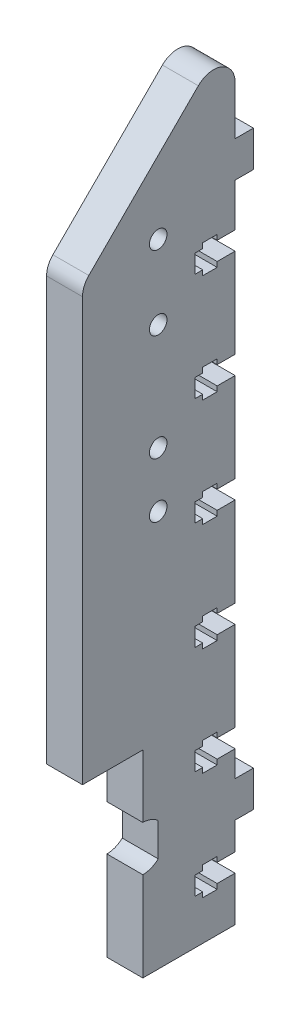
ISO-10303-21;
HEADER;
FILE_DESCRIPTION(('STEP AP214'),'2;1');
FILE_NAME('part.step','',(''),(''),'','','');
FILE_SCHEMA(('AUTOMOTIVE_DESIGN { 1 0 10303 214 1 1 1 1 }'));
ENDSEC;
DATA;
#1=APPLICATION_CONTEXT('core data for automotive mechanical design processes');
#2=APPLICATION_PROTOCOL_DEFINITION('international standard','automotive_design',2000,#1);
#3=PRODUCT_CONTEXT('',#1,'mechanical');
#4=PRODUCT('Part','Part','',(#3));
#5=PRODUCT_RELATED_PRODUCT_CATEGORY('part','',(#4));
#6=PRODUCT_DEFINITION_FORMATION('','',#4);
#7=PRODUCT_DEFINITION_CONTEXT('part definition',#1,'design');
#8=PRODUCT_DEFINITION('design','',#6,#7);
#9=PRODUCT_DEFINITION_SHAPE('','',#8);
#10=(LENGTH_UNIT() NAMED_UNIT(*) SI_UNIT(.MILLI.,.METRE.));
#11=(NAMED_UNIT(*) PLANE_ANGLE_UNIT() SI_UNIT($,.RADIAN.));
#12=(NAMED_UNIT(*) SI_UNIT($,.STERADIAN.) SOLID_ANGLE_UNIT());
#13=UNCERTAINTY_MEASURE_WITH_UNIT(LENGTH_MEASURE(1.E-05),#10,'distance_accuracy_value','');
#14=(GEOMETRIC_REPRESENTATION_CONTEXT(3) GLOBAL_UNCERTAINTY_ASSIGNED_CONTEXT((#13)) GLOBAL_UNIT_ASSIGNED_CONTEXT((#10,
#11,#12)) REPRESENTATION_CONTEXT('',''));
#15=CARTESIAN_POINT('',(0.,0.,0.));
#16=DIRECTION('',(0.,0.,1.));
#17=DIRECTION('',(1.,0.,0.));
#18=AXIS2_PLACEMENT_3D('',#15,#16,#17);
#19=CARTESIAN_POINT('',(0.,0.,0.));
#20=DIRECTION('',(0.,0.,1.));
#21=DIRECTION('',(1.,0.,0.));
#22=AXIS2_PLACEMENT_3D('',#19,#20,#21);
#23=PLANE('',#22);
#24=DIRECTION('',(0.,1.,0.));
#25=VECTOR('',#24,1.);
#26=CARTESIAN_POINT('',(0.,0.,0.));
#27=LINE('',#26,#25);
#28=CARTESIAN_POINT('',(0.,44.74,0.));
#29=VERTEX_POINT('',#28);
#30=CARTESIAN_POINT('',(0.,53.9,0.));
#31=VERTEX_POINT('',#30);
#32=EDGE_CURVE('E619',#29,#31,#27,.T.);
#33=ORIENTED_EDGE('',*,*,#32,.F.);
#34=DIRECTION('',(1.,0.,0.));
#35=VECTOR('',#34,1.);
#36=CARTESIAN_POINT('',(-12.7,44.74,-1.38786383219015E-12));
#37=LINE('',#36,#35);
#38=CARTESIAN_POINT('',(-12.7,44.74,-1.38786383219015E-12));
#39=VERTEX_POINT('',#38);
#40=EDGE_CURVE('E606',#39,#29,#37,.T.);
#41=ORIENTED_EDGE('',*,*,#40,.F.);
#42=DIRECTION('',(0.,-1.,0.));
#43=VECTOR('',#42,1.);
#44=CARTESIAN_POINT('',(-12.7,0.,0.));
#45=LINE('',#44,#43);
#46=CARTESIAN_POINT('',(-12.7,53.9,1.33025439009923E-13));
#47=VERTEX_POINT('',#46);
#48=EDGE_CURVE('E618',#47,#39,#45,.T.);
#49=ORIENTED_EDGE('',*,*,#48,.F.);
#50=DIRECTION('',(1.,0.,0.));
#51=VECTOR('',#50,1.);
#52=CARTESIAN_POINT('',(-12.7,53.9,1.33025439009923E-13));
#53=LINE('',#52,#51);
#54=EDGE_CURVE('E784',#47,#31,#53,.T.);
#55=ORIENTED_EDGE('',*,*,#54,.T.);
#56=EDGE_LOOP('',(#33,#41,#49,#55));
#57=FACE_BOUND('',#56,.T.);
#58=ADVANCED_FACE('F33',(#57),#23,.F.);
#59=CARTESIAN_POINT('',(0.,240.74,6.65127195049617E-13));
#60=VERTEX_POINT('',#59);
#61=CARTESIAN_POINT('',(0.,258.062922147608,0.));
#62=VERTEX_POINT('',#61);
#63=EDGE_CURVE('E971',#60,#62,#27,.T.);
#64=ORIENTED_EDGE('',*,*,#63,.F.);
#65=DIRECTION('',(1.,0.,0.));
#66=VECTOR('',#65,1.);
#67=CARTESIAN_POINT('',(-12.7,240.74,6.65127195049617E-13));
#68=LINE('',#67,#66);
#69=CARTESIAN_POINT('',(-12.7,240.74,6.65127195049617E-13));
#70=VERTEX_POINT('',#69);
#71=EDGE_CURVE('E1021',#70,#60,#68,.T.);
#72=ORIENTED_EDGE('',*,*,#71,.F.);
#73=CARTESIAN_POINT('',(-12.7,258.062922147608,0.));
#74=VERTEX_POINT('',#73);
#75=EDGE_CURVE('E636',#74,#70,#45,.T.);
#76=ORIENTED_EDGE('',*,*,#75,.F.);
#77=DIRECTION('',(-1.,0.,0.));
#78=VECTOR('',#77,1.);
#79=CARTESIAN_POINT('',(0.,258.062922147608,0.));
#80=LINE('',#79,#78);
#81=EDGE_CURVE('E11',#74,#62,#80,.F.);
#82=ORIENTED_EDGE('',*,*,#81,.T.);
#83=EDGE_LOOP('',(#64,#72,#76,#82));
#84=FACE_BOUND('',#83,.T.);
#85=ADVANCED_FACE('F1020',(#84),#23,.F.);
#86=CARTESIAN_POINT('',(-12.7,228.04,0.));
#87=VERTEX_POINT('',#86);
#88=CARTESIAN_POINT('',(-12.7,212.8,6.65127195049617E-13));
#89=VERTEX_POINT('',#88);
#90=EDGE_CURVE('E635',#87,#89,#45,.T.);
#91=ORIENTED_EDGE('',*,*,#90,.F.);
#92=DIRECTION('',(1.,0.,0.));
#93=VECTOR('',#92,1.);
#94=CARTESIAN_POINT('',(-12.7,228.04,6.65127195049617E-13));
#95=LINE('',#94,#93);
#96=CARTESIAN_POINT('',(0.,228.04,6.65127195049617E-13));
#97=VERTEX_POINT('',#96);
#98=EDGE_CURVE('E1038',#87,#97,#95,.T.);
#99=ORIENTED_EDGE('',*,*,#98,.T.);
#100=CARTESIAN_POINT('',(0.,212.8,6.65127195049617E-13));
#101=VERTEX_POINT('',#100);
#102=EDGE_CURVE('E1409',#101,#97,#27,.T.);
#103=ORIENTED_EDGE('',*,*,#102,.F.);
#104=DIRECTION('',(1.,0.,0.));
#105=VECTOR('',#104,1.);
#106=CARTESIAN_POINT('',(-12.7,212.8,6.65127195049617E-13));
#107=LINE('',#106,#105);
#108=EDGE_CURVE('E1102',#89,#101,#107,.T.);
#109=ORIENTED_EDGE('',*,*,#108,.F.);
#110=EDGE_LOOP('',(#91,#99,#103,#109));
#111=FACE_BOUND('',#110,.T.);
#112=ADVANCED_FACE('F1408',(#111),#23,.F.);
#113=CARTESIAN_POINT('',(-12.7,206.3,6.65127195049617E-13));
#114=VERTEX_POINT('',#113);
#115=CARTESIAN_POINT('',(-12.7,174.7,5.32101756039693E-13));
#116=VERTEX_POINT('',#115);
#117=EDGE_CURVE('E651',#114,#116,#45,.T.);
#118=ORIENTED_EDGE('',*,*,#117,.F.);
#119=DIRECTION('',(1.,0.,0.));
#120=VECTOR('',#119,1.);
#121=CARTESIAN_POINT('',(-12.7,206.3,6.65127195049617E-13));
#122=LINE('',#121,#120);
#123=CARTESIAN_POINT('',(0.,206.3,6.65127195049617E-13));
#124=VERTEX_POINT('',#123);
#125=EDGE_CURVE('E1105',#114,#124,#122,.T.);
#126=ORIENTED_EDGE('',*,*,#125,.T.);
#127=CARTESIAN_POINT('',(0.,174.7,5.32101756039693E-13));
#128=VERTEX_POINT('',#127);
#129=EDGE_CURVE('E1457',#128,#124,#27,.T.);
#130=ORIENTED_EDGE('',*,*,#129,.F.);
#131=DIRECTION('',(1.,0.,0.));
#132=VECTOR('',#131,1.);
#133=CARTESIAN_POINT('',(-12.7,174.7,5.32101756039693E-13));
#134=LINE('',#133,#132);
#135=EDGE_CURVE('E1190',#116,#128,#134,.T.);
#136=ORIENTED_EDGE('',*,*,#135,.F.);
#137=EDGE_LOOP('',(#118,#126,#130,#136));
#138=FACE_BOUND('',#137,.T.);
#139=ADVANCED_FACE('F1454',(#138),#23,.F.);
#140=CARTESIAN_POINT('',(-12.7,168.2,5.32101756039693E-13));
#141=VERTEX_POINT('',#140);
#142=CARTESIAN_POINT('',(-12.7,136.6,3.9907631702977E-13));
#143=VERTEX_POINT('',#142);
#144=EDGE_CURVE('E655',#141,#143,#45,.T.);
#145=ORIENTED_EDGE('',*,*,#144,.F.);
#146=DIRECTION('',(1.,0.,0.));
#147=VECTOR('',#146,1.);
#148=CARTESIAN_POINT('',(-12.7,168.2,5.32101756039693E-13));
#149=LINE('',#148,#147);
#150=CARTESIAN_POINT('',(0.,168.2,5.32101756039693E-13));
#151=VERTEX_POINT('',#150);
#152=EDGE_CURVE('E1193',#141,#151,#149,.T.);
#153=ORIENTED_EDGE('',*,*,#152,.T.);
#154=CARTESIAN_POINT('',(0.,136.6,3.9907631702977E-13));
#155=VERTEX_POINT('',#154);
#156=EDGE_CURVE('E1368',#155,#151,#27,.T.);
#157=ORIENTED_EDGE('',*,*,#156,.F.);
#158=DIRECTION('',(1.,0.,0.));
#159=VECTOR('',#158,1.);
#160=CARTESIAN_POINT('',(-12.7,136.6,3.9907631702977E-13));
#161=LINE('',#160,#159);
#162=EDGE_CURVE('E1276',#143,#155,#161,.T.);
#163=ORIENTED_EDGE('',*,*,#162,.F.);
#164=EDGE_LOOP('',(#145,#153,#157,#163));
#165=FACE_BOUND('',#164,.T.);
#166=ADVANCED_FACE('F1503',(#165),#23,.F.);
#167=CARTESIAN_POINT('',(-12.7,130.1,3.9907631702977E-13));
#168=VERTEX_POINT('',#167);
#169=CARTESIAN_POINT('',(-12.7,98.5,2.66050878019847E-13));
#170=VERTEX_POINT('',#169);
#171=EDGE_CURVE('E634',#168,#170,#45,.T.);
#172=ORIENTED_EDGE('',*,*,#171,.F.);
#173=DIRECTION('',(1.,0.,0.));
#174=VECTOR('',#173,1.);
#175=CARTESIAN_POINT('',(-12.7,130.1,3.9907631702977E-13));
#176=LINE('',#175,#174);
#177=CARTESIAN_POINT('',(0.,130.1,3.9907631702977E-13));
#178=VERTEX_POINT('',#177);
#179=EDGE_CURVE('E1279',#168,#178,#176,.T.);
#180=ORIENTED_EDGE('',*,*,#179,.T.);
#181=CARTESIAN_POINT('',(0.,98.5,2.66050878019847E-13));
#182=VERTEX_POINT('',#181);
#183=EDGE_CURVE('E689',#182,#178,#27,.T.);
#184=ORIENTED_EDGE('',*,*,#183,.F.);
#185=DIRECTION('',(1.,0.,0.));
#186=VECTOR('',#185,1.);
#187=CARTESIAN_POINT('',(-12.7,98.5,2.66050878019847E-13));
#188=LINE('',#187,#186);
#189=EDGE_CURVE('E679',#170,#182,#188,.T.);
#190=ORIENTED_EDGE('',*,*,#189,.F.);
#191=EDGE_LOOP('',(#172,#180,#184,#190));
#192=FACE_BOUND('',#191,.T.);
#193=ADVANCED_FACE('F687',(#192),#23,.F.);
#194=CARTESIAN_POINT('',(-12.7,92.,2.66050878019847E-13));
#195=VERTEX_POINT('',#194);
#196=CARTESIAN_POINT('',(-12.7,60.4,1.33025439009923E-13));
#197=VERTEX_POINT('',#196);
#198=EDGE_CURVE('E630',#195,#197,#45,.T.);
#199=ORIENTED_EDGE('',*,*,#198,.F.);
#200=DIRECTION('',(1.,0.,0.));
#201=VECTOR('',#200,1.);
#202=CARTESIAN_POINT('',(-12.7,92.,2.66050878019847E-13));
#203=LINE('',#202,#201);
#204=CARTESIAN_POINT('',(0.,92.,2.66050878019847E-13));
#205=VERTEX_POINT('',#204);
#206=EDGE_CURVE('E691',#195,#205,#203,.T.);
#207=ORIENTED_EDGE('',*,*,#206,.T.);
#208=CARTESIAN_POINT('',(0.,60.4,1.33025439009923E-13));
#209=VERTEX_POINT('',#208);
#210=EDGE_CURVE('E1365',#209,#205,#27,.T.);
#211=ORIENTED_EDGE('',*,*,#210,.F.);
#212=DIRECTION('',(1.,0.,0.));
#213=VECTOR('',#212,1.);
#214=CARTESIAN_POINT('',(-12.7,60.4,1.33025439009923E-13));
#215=LINE('',#214,#213);
#216=EDGE_CURVE('E781',#197,#209,#215,.T.);
#217=ORIENTED_EDGE('',*,*,#216,.F.);
#218=EDGE_LOOP('',(#199,#207,#211,#217));
#219=FACE_BOUND('',#218,.T.);
#220=ADVANCED_FACE('F1363',(#219),#23,.F.);
#221=CARTESIAN_POINT('',(-12.7,15.8,0.));
#222=VERTEX_POINT('',#221);
#223=CARTESIAN_POINT('',(-12.7,0.,0.));
#224=VERTEX_POINT('',#223);
#225=EDGE_CURVE('E633',#222,#224,#45,.T.);
#226=ORIENTED_EDGE('',*,*,#225,.F.);
#227=DIRECTION('',(1.,0.,0.));
#228=VECTOR('',#227,1.);
#229=CARTESIAN_POINT('',(-12.7,15.8,0.));
#230=LINE('',#229,#228);
#231=CARTESIAN_POINT('',(0.,15.8,0.));
#232=VERTEX_POINT('',#231);
#233=EDGE_CURVE('E869',#222,#232,#230,.T.);
#234=ORIENTED_EDGE('',*,*,#233,.T.);
#235=CARTESIAN_POINT('',(0.,0.,0.));
#236=VERTEX_POINT('',#235);
#237=EDGE_CURVE('E639',#236,#232,#27,.T.);
#238=ORIENTED_EDGE('',*,*,#237,.F.);
#239=DIRECTION('',(1.,0.,0.));
#240=VECTOR('',#239,1.);
#241=CARTESIAN_POINT('',(0.,0.,0.));
#242=LINE('',#241,#240);
#243=EDGE_CURVE('E646',#224,#236,#242,.T.);
#244=ORIENTED_EDGE('',*,*,#243,.F.);
#245=EDGE_LOOP('',(#226,#234,#238,#244));
#246=FACE_BOUND('',#245,.T.);
#247=ADVANCED_FACE('F1641',(#246),#23,.F.);
#248=CARTESIAN_POINT('',(0.,0.,53.975));
#249=DIRECTION('',(-1.,0.,0.));
#250=DIRECTION('',(0.,0.,1.));
#251=AXIS2_PLACEMENT_3D('',#248,#249,#250);
#252=PLANE('',#251);
#253=CARTESIAN_POINT('',(0.,140.206609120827,27.1953617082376));
#254=DIRECTION('',(1.,0.,0.));
#255=DIRECTION('',(0.,0.,-1.));
#256=AXIS2_PLACEMENT_3D('',#253,#254,#255);
#257=CIRCLE('',#256,3.09999999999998);
#258=CARTESIAN_POINT('',(0.,140.206609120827,24.0953617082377));
#259=VERTEX_POINT('',#258);
#260=EDGE_CURVE('E872',#259,#259,#257,.T.);
#261=ORIENTED_EDGE('',*,*,#260,.F.);
#262=EDGE_LOOP('',(#261));
#263=FACE_BOUND('',#262,.T.);
#264=CARTESIAN_POINT('',(0.,159.637609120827,27.1953617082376));
#265=DIRECTION('',(1.,0.,0.));
#266=DIRECTION('',(0.,0.,-1.));
#267=AXIS2_PLACEMENT_3D('',#264,#265,#266);
#268=CIRCLE('',#267,3.09999999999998);
#269=CARTESIAN_POINT('',(0.,159.637609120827,24.0953617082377));
#270=VERTEX_POINT('',#269);
#271=EDGE_CURVE('E897',#270,#270,#268,.T.);
#272=ORIENTED_EDGE('',*,*,#271,.F.);
#273=EDGE_LOOP('',(#272));
#274=FACE_BOUND('',#273,.T.);
#275=CARTESIAN_POINT('',(0.,223.518609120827,27.1953617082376));
#276=DIRECTION('',(1.,0.,0.));
#277=DIRECTION('',(0.,0.,-1.));
#278=AXIS2_PLACEMENT_3D('',#275,#276,#277);
#279=CIRCLE('',#278,3.10000000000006);
#280=CARTESIAN_POINT('',(0.,223.518609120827,24.0953617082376));
#281=VERTEX_POINT('',#280);
#282=EDGE_CURVE('E903',#281,#281,#279,.T.);
#283=ORIENTED_EDGE('',*,*,#282,.F.);
#284=EDGE_LOOP('',(#283));
#285=FACE_BOUND('',#284,.T.);
#286=CARTESIAN_POINT('',(0.,197.356609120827,27.1953617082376));
#287=DIRECTION('',(1.,0.,0.));
#288=DIRECTION('',(0.,0.,-1.));
#289=AXIS2_PLACEMENT_3D('',#286,#287,#288);
#290=CIRCLE('',#289,3.10000000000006);
#291=CARTESIAN_POINT('',(0.,197.356609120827,24.0953617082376));
#292=VERTEX_POINT('',#291);
#293=EDGE_CURVE('E909',#292,#292,#290,.T.);
#294=ORIENTED_EDGE('',*,*,#293,.F.);
#295=EDGE_LOOP('',(#294));
#296=FACE_BOUND('',#295,.T.);
#297=DIRECTION('',(0.,1.,0.));
#298=VECTOR('',#297,1.);
#299=CARTESIAN_POINT('',(0.,212.8,6.35000000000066));
#300=LINE('',#299,#298);
#301=CARTESIAN_POINT('',(0.,212.8,6.35000000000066));
#302=VERTEX_POINT('',#301);
#303=CARTESIAN_POINT('',(0.,214.6,6.35000000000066));
#304=VERTEX_POINT('',#303);
#305=EDGE_CURVE('E1029',#302,#304,#300,.T.);
#306=ORIENTED_EDGE('',*,*,#305,.F.);
#307=DIRECTION('',(0.,0.,1.));
#308=VECTOR('',#307,1.);
#309=CARTESIAN_POINT('',(0.,212.8,6.65127195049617E-13));
#310=LINE('',#309,#308);
#311=EDGE_CURVE('E1025',#101,#302,#310,.T.);
#312=ORIENTED_EDGE('',*,*,#311,.F.);
#313=ORIENTED_EDGE('',*,*,#102,.T.);
#314=DIRECTION('',(0.,0.,-1.));
#315=VECTOR('',#314,1.);
#316=CARTESIAN_POINT('',(0.,228.04,-6.47699999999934));
#317=LINE('',#316,#315);
#318=CARTESIAN_POINT('',(0.,228.04,-6.47699999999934));
#319=VERTEX_POINT('',#318);
#320=EDGE_CURVE('E1394',#97,#319,#317,.T.);
#321=ORIENTED_EDGE('',*,*,#320,.T.);
#322=DIRECTION('',(0.,1.,0.));
#323=VECTOR('',#322,1.);
#324=CARTESIAN_POINT('',(0.,240.74,-6.47699999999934));
#325=LINE('',#324,#323);
#326=CARTESIAN_POINT('',(0.,240.74,-6.47699999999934));
#327=VERTEX_POINT('',#326);
#328=EDGE_CURVE('E1396',#319,#327,#325,.T.);
#329=ORIENTED_EDGE('',*,*,#328,.T.);
#330=DIRECTION('',(0.,0.,1.));
#331=VECTOR('',#330,1.);
#332=CARTESIAN_POINT('',(0.,240.74,6.65127195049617E-13));
#333=LINE('',#332,#331);
#334=EDGE_CURVE('E1034',#327,#60,#333,.T.);
#335=ORIENTED_EDGE('',*,*,#334,.T.);
#336=ORIENTED_EDGE('',*,*,#63,.T.);
#337=CARTESIAN_POINT('',(0.,258.062922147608,7.62));
#338=DIRECTION('',(-1.,0.,0.));
#339=DIRECTION('',(0.,0.,1.));
#340=AXIS2_PLACEMENT_3D('',#337,#338,#339);
#341=CIRCLE('',#340,7.62);
#342=CARTESIAN_POINT('',(0.,263.451075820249,13.0081536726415));
#343=VERTEX_POINT('',#342);
#344=EDGE_CURVE('E992',#62,#343,#341,.F.);
#345=ORIENTED_EDGE('',*,*,#344,.T.);
#346=DIRECTION('',(0.,0.707106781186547,-0.707106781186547));
#347=VECTOR('',#346,1.);
#348=CARTESIAN_POINT('',(0.,276.459229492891,0.));
#349=LINE('',#348,#347);
#350=CARTESIAN_POINT('',(0.,224.716075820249,51.7431536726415));
#351=VERTEX_POINT('',#350);
#352=EDGE_CURVE('E955',#351,#343,#349,.T.);
#353=ORIENTED_EDGE('',*,*,#352,.F.);
#354=CARTESIAN_POINT('',(0.,219.327922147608,46.355));
#355=DIRECTION('',(-1.,0.,0.));
#356=DIRECTION('',(0.,0.,1.));
#357=AXIS2_PLACEMENT_3D('',#354,#355,#356);
#358=CIRCLE('',#357,7.62);
#359=CARTESIAN_POINT('',(0.,219.327922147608,53.975));
#360=VERTEX_POINT('',#359);
#361=EDGE_CURVE('E994',#351,#360,#358,.F.);
#362=ORIENTED_EDGE('',*,*,#361,.T.);
#363=DIRECTION('',(0.,1.,0.));
#364=VECTOR('',#363,1.);
#365=CARTESIAN_POINT('',(0.,0.,53.975));
#366=LINE('',#365,#364);
#367=CARTESIAN_POINT('',(0.,69.85,53.975));
#368=VERTEX_POINT('',#367);
#369=EDGE_CURVE('E650',#368,#360,#366,.T.);
#370=ORIENTED_EDGE('',*,*,#369,.F.);
#371=DIRECTION('',(0.,0.,1.));
#372=VECTOR('',#371,1.);
#373=CARTESIAN_POINT('',(0.,69.85,53.975));
#374=LINE('',#373,#372);
#375=CARTESIAN_POINT('',(0.,69.85,32.6353617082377));
#376=VERTEX_POINT('',#375);
#377=EDGE_CURVE('E949',#376,#368,#374,.T.);
#378=ORIENTED_EDGE('',*,*,#377,.F.);
#379=DIRECTION('',(0.,1.,0.));
#380=VECTOR('',#379,1.);
#381=CARTESIAN_POINT('',(0.,69.85,32.6353617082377));
#382=LINE('',#381,#380);
#383=CARTESIAN_POINT('',(0.,47.638980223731,32.6353617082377));
#384=VERTEX_POINT('',#383);
#385=EDGE_CURVE('E946',#384,#376,#382,.T.);
#386=ORIENTED_EDGE('',*,*,#385,.F.);
#387=CARTESIAN_POINT('',(0.,39.6389802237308,32.6353617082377));
#388=DIRECTION('',(1.,0.,0.));
#389=DIRECTION('',(0.,0.,-1.));
#390=AXIS2_PLACEMENT_3D('',#387,#388,#389);
#391=CIRCLE('',#390,8.00000000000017);
#392=CARTESIAN_POINT('',(0.,45.5046771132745,27.1953617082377));
#393=VERTEX_POINT('',#392);
#394=EDGE_CURVE('E943',#393,#384,#391,.T.);
#395=ORIENTED_EDGE('',*,*,#394,.F.);
#396=DIRECTION('',(0.,1.,0.));
#397=VECTOR('',#396,1.);
#398=CARTESIAN_POINT('',(0.,45.5046771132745,27.1953617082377));
#399=LINE('',#398,#397);
#400=CARTESIAN_POINT('',(0.,33.7732833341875,27.1953617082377));
#401=VERTEX_POINT('',#400);
#402=EDGE_CURVE('E940',#401,#393,#399,.T.);
#403=ORIENTED_EDGE('',*,*,#402,.F.);
#404=CARTESIAN_POINT('',(0.,39.6389802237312,32.6353617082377));
#405=DIRECTION('',(1.,0.,0.));
#406=DIRECTION('',(0.,0.,1.));
#407=AXIS2_PLACEMENT_3D('',#404,#405,#406);
#408=CIRCLE('',#407,8.00000000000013);
#409=CARTESIAN_POINT('',(0.,31.638980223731,32.6353617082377));
#410=VERTEX_POINT('',#409);
#411=EDGE_CURVE('E915',#410,#401,#408,.T.);
#412=ORIENTED_EDGE('',*,*,#411,.F.);
#413=DIRECTION('',(0.,1.,0.));
#414=VECTOR('',#413,1.);
#415=CARTESIAN_POINT('',(0.,31.638980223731,32.6353617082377));
#416=LINE('',#415,#414);
#417=CARTESIAN_POINT('',(0.,0.,32.6353617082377));
#418=VERTEX_POINT('',#417);
#419=EDGE_CURVE('E922',#418,#410,#416,.T.);
#420=ORIENTED_EDGE('',*,*,#419,.F.);
#421=DIRECTION('',(0.,0.,-1.));
#422=VECTOR('',#421,1.);
#423=CARTESIAN_POINT('',(0.,0.,53.975));
#424=LINE('',#423,#422);
#425=EDGE_CURVE('E977',#418,#236,#424,.T.);
#426=ORIENTED_EDGE('',*,*,#425,.T.);
#427=ORIENTED_EDGE('',*,*,#237,.T.);
#428=DIRECTION('',(0.,0.,-1.));
#429=VECTOR('',#428,1.);
#430=CARTESIAN_POINT('',(0.,15.8,0.));
#431=LINE('',#430,#429);
#432=CARTESIAN_POINT('',(0.,15.8,6.35));
#433=VERTEX_POINT('',#432);
#434=EDGE_CURVE('E809',#433,#232,#431,.T.);
#435=ORIENTED_EDGE('',*,*,#434,.F.);
#436=DIRECTION('',(0.,1.,0.));
#437=VECTOR('',#436,1.);
#438=CARTESIAN_POINT('',(0.,15.8,6.35));
#439=LINE('',#438,#437);
#440=CARTESIAN_POINT('',(0.,14.,6.35));
#441=VERTEX_POINT('',#440);
#442=EDGE_CURVE('E865',#441,#433,#439,.T.);
#443=ORIENTED_EDGE('',*,*,#442,.F.);
#444=DIRECTION('',(0.,0.,-1.));
#445=VECTOR('',#444,1.);
#446=CARTESIAN_POINT('',(0.,14.,6.35));
#447=LINE('',#446,#445);
#448=CARTESIAN_POINT('',(0.,14.,11.45));
#449=VERTEX_POINT('',#448);
#450=EDGE_CURVE('E862',#449,#441,#447,.T.);
#451=ORIENTED_EDGE('',*,*,#450,.F.);
#452=DIRECTION('',(0.,-1.,0.));
#453=VECTOR('',#452,1.);
#454=CARTESIAN_POINT('',(0.,14.,11.45));
#455=LINE('',#454,#453);
#456=CARTESIAN_POINT('',(0.,15.8,11.45));
#457=VERTEX_POINT('',#456);
#458=EDGE_CURVE('E859',#457,#449,#455,.T.);
#459=ORIENTED_EDGE('',*,*,#458,.F.);
#460=DIRECTION('',(0.,0.,-1.));
#461=VECTOR('',#460,1.);
#462=CARTESIAN_POINT('',(0.,15.8,11.45));
#463=LINE('',#462,#461);
#464=CARTESIAN_POINT('',(0.,15.8,14.224));
#465=VERTEX_POINT('',#464);
#466=EDGE_CURVE('E856',#465,#457,#463,.T.);
#467=ORIENTED_EDGE('',*,*,#466,.F.);
#468=DIRECTION('',(0.,-1.,0.));
#469=VECTOR('',#468,1.);
#470=CARTESIAN_POINT('',(0.,22.3,14.224));
#471=LINE('',#470,#469);
#472=CARTESIAN_POINT('',(0.,22.3,14.224));
#473=VERTEX_POINT('',#472);
#474=EDGE_CURVE('E853',#473,#465,#471,.T.);
#475=ORIENTED_EDGE('',*,*,#474,.F.);
#476=DIRECTION('',(0.,0.,1.));
#477=VECTOR('',#476,1.);
#478=CARTESIAN_POINT('',(0.,22.3,11.45));
#479=LINE('',#478,#477);
#480=CARTESIAN_POINT('',(0.,22.3,11.45));
#481=VERTEX_POINT('',#480);
#482=EDGE_CURVE('E850',#481,#473,#479,.T.);
#483=ORIENTED_EDGE('',*,*,#482,.F.);
#484=DIRECTION('',(0.,-1.,0.));
#485=VECTOR('',#484,1.);
#486=CARTESIAN_POINT('',(0.,24.1,11.45));
#487=LINE('',#486,#485);
#488=CARTESIAN_POINT('',(0.,24.1,11.45));
#489=VERTEX_POINT('',#488);
#490=EDGE_CURVE('E847',#489,#481,#487,.T.);
#491=ORIENTED_EDGE('',*,*,#490,.F.);
#492=DIRECTION('',(0.,0.,1.));
#493=VECTOR('',#492,1.);
#494=CARTESIAN_POINT('',(0.,24.1,6.35));
#495=LINE('',#494,#493);
#496=CARTESIAN_POINT('',(0.,24.1,6.35));
#497=VERTEX_POINT('',#496);
#498=EDGE_CURVE('E844',#497,#489,#495,.T.);
#499=ORIENTED_EDGE('',*,*,#498,.F.);
#500=DIRECTION('',(0.,1.,0.));
#501=VECTOR('',#500,1.);
#502=CARTESIAN_POINT('',(0.,22.3,6.35));
#503=LINE('',#502,#501);
#504=CARTESIAN_POINT('',(0.,22.3,6.35));
#505=VERTEX_POINT('',#504);
#506=EDGE_CURVE('E841',#505,#497,#503,.T.);
#507=ORIENTED_EDGE('',*,*,#506,.F.);
#508=DIRECTION('',(0.,0.,1.));
#509=VECTOR('',#508,1.);
#510=CARTESIAN_POINT('',(0.,22.3,0.));
#511=LINE('',#510,#509);
#512=CARTESIAN_POINT('',(0.,22.3,0.));
#513=VERTEX_POINT('',#512);
#514=EDGE_CURVE('E783',#513,#505,#511,.T.);
#515=ORIENTED_EDGE('',*,*,#514,.F.);
#516=CARTESIAN_POINT('',(0.,32.04,-1.38786383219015E-12));
#517=VERTEX_POINT('',#516);
#518=EDGE_CURVE('E645',#513,#517,#27,.T.);
#519=ORIENTED_EDGE('',*,*,#518,.T.);
#520=DIRECTION('',(0.,0.,-1.));
#521=VECTOR('',#520,1.);
#522=CARTESIAN_POINT('',(0.,32.04,-6.47700000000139));
#523=LINE('',#522,#521);
#524=CARTESIAN_POINT('',(0.,32.04,-6.47700000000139));
#525=VERTEX_POINT('',#524);
#526=EDGE_CURVE('E1373',#517,#525,#523,.T.);
#527=ORIENTED_EDGE('',*,*,#526,.T.);
#528=DIRECTION('',(0.,1.,0.));
#529=VECTOR('',#528,1.);
#530=CARTESIAN_POINT('',(0.,44.74,-6.47700000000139));
#531=LINE('',#530,#529);
#532=CARTESIAN_POINT('',(0.,44.74,-6.47700000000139));
#533=VERTEX_POINT('',#532);
#534=EDGE_CURVE('E613',#525,#533,#531,.T.);
#535=ORIENTED_EDGE('',*,*,#534,.T.);
#536=DIRECTION('',(0.,0.,1.));
#537=VECTOR('',#536,1.);
#538=CARTESIAN_POINT('',(0.,44.74,-1.38786383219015E-12));
#539=LINE('',#538,#537);
#540=EDGE_CURVE('E48',#533,#29,#539,.T.);
#541=ORIENTED_EDGE('',*,*,#540,.T.);
#542=ORIENTED_EDGE('',*,*,#32,.T.);
#543=DIRECTION('',(0.,0.,-1.));
#544=VECTOR('',#543,1.);
#545=CARTESIAN_POINT('',(0.,53.9,1.33025439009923E-13));
#546=LINE('',#545,#544);
#547=CARTESIAN_POINT('',(0.,53.9,6.35000000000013));
#548=VERTEX_POINT('',#547);
#549=EDGE_CURVE('E725',#548,#31,#546,.T.);
#550=ORIENTED_EDGE('',*,*,#549,.F.);
#551=DIRECTION('',(0.,1.,0.));
#552=VECTOR('',#551,1.);
#553=CARTESIAN_POINT('',(0.,53.9,6.35000000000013));
#554=LINE('',#553,#552);
#555=CARTESIAN_POINT('',(0.,52.1,6.35000000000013));
#556=VERTEX_POINT('',#555);
#557=EDGE_CURVE('E776',#556,#548,#554,.T.);
#558=ORIENTED_EDGE('',*,*,#557,.F.);
#559=DIRECTION('',(0.,0.,-1.));
#560=VECTOR('',#559,1.);
#561=CARTESIAN_POINT('',(0.,52.1,6.35000000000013));
#562=LINE('',#561,#560);
#563=CARTESIAN_POINT('',(0.,52.1,11.4500000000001));
#564=VERTEX_POINT('',#563);
#565=EDGE_CURVE('E773',#564,#556,#562,.T.);
#566=ORIENTED_EDGE('',*,*,#565,.F.);
#567=DIRECTION('',(0.,-1.,0.));
#568=VECTOR('',#567,1.);
#569=CARTESIAN_POINT('',(0.,52.1,11.4500000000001));
#570=LINE('',#569,#568);
#571=CARTESIAN_POINT('',(0.,53.9,11.4500000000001));
#572=VERTEX_POINT('',#571);
#573=EDGE_CURVE('E770',#572,#564,#570,.T.);
#574=ORIENTED_EDGE('',*,*,#573,.F.);
#575=DIRECTION('',(0.,0.,-1.));
#576=VECTOR('',#575,1.);
#577=CARTESIAN_POINT('',(0.,53.9,11.4500000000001));
#578=LINE('',#577,#576);
#579=CARTESIAN_POINT('',(0.,53.9,14.2240000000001));
#580=VERTEX_POINT('',#579);
#581=EDGE_CURVE('E767',#580,#572,#578,.T.);
#582=ORIENTED_EDGE('',*,*,#581,.F.);
#583=DIRECTION('',(0.,-1.,0.));
#584=VECTOR('',#583,1.);
#585=CARTESIAN_POINT('',(0.,60.4,14.2240000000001));
#586=LINE('',#585,#584);
#587=CARTESIAN_POINT('',(0.,60.4,14.2240000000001));
#588=VERTEX_POINT('',#587);
#589=EDGE_CURVE('E764',#588,#580,#586,.T.);
#590=ORIENTED_EDGE('',*,*,#589,.F.);
#591=DIRECTION('',(0.,0.,1.));
#592=VECTOR('',#591,1.);
#593=CARTESIAN_POINT('',(0.,60.4,11.4500000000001));
#594=LINE('',#593,#592);
#595=CARTESIAN_POINT('',(0.,60.4,11.4500000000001));
#596=VERTEX_POINT('',#595);
#597=EDGE_CURVE('E761',#596,#588,#594,.T.);
#598=ORIENTED_EDGE('',*,*,#597,.F.);
#599=DIRECTION('',(0.,-1.,0.));
#600=VECTOR('',#599,1.);
#601=CARTESIAN_POINT('',(0.,62.2,11.4500000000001));
#602=LINE('',#601,#600);
#603=CARTESIAN_POINT('',(0.,62.2,11.4500000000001));
#604=VERTEX_POINT('',#603);
#605=EDGE_CURVE('E758',#604,#596,#602,.T.);
#606=ORIENTED_EDGE('',*,*,#605,.F.);
#607=DIRECTION('',(0.,0.,1.));
#608=VECTOR('',#607,1.);
#609=CARTESIAN_POINT('',(0.,62.2,6.35000000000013));
#610=LINE('',#609,#608);
#611=CARTESIAN_POINT('',(0.,62.2,6.35000000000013));
#612=VERTEX_POINT('',#611);
#613=EDGE_CURVE('E755',#612,#604,#610,.T.);
#614=ORIENTED_EDGE('',*,*,#613,.F.);
#615=DIRECTION('',(0.,1.,0.));
#616=VECTOR('',#615,1.);
#617=CARTESIAN_POINT('',(0.,60.4,6.35000000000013));
#618=LINE('',#617,#616);
#619=CARTESIAN_POINT('',(0.,60.4,6.35000000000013));
#620=VERTEX_POINT('',#619);
#621=EDGE_CURVE('E694',#620,#612,#618,.T.);
#622=ORIENTED_EDGE('',*,*,#621,.F.);
#623=DIRECTION('',(0.,0.,1.));
#624=VECTOR('',#623,1.);
#625=CARTESIAN_POINT('',(0.,60.4,1.33025439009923E-13));
#626=LINE('',#625,#624);
#627=EDGE_CURVE('E690',#209,#620,#626,.T.);
#628=ORIENTED_EDGE('',*,*,#627,.F.);
#629=ORIENTED_EDGE('',*,*,#210,.T.);
#630=DIRECTION('',(0.,0.,-1.));
#631=VECTOR('',#630,1.);
#632=CARTESIAN_POINT('',(0.,92.,2.66050878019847E-13));
#633=LINE('',#632,#631);
#634=CARTESIAN_POINT('',(0.,92.,6.35000000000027));
#635=VERTEX_POINT('',#634);
#636=EDGE_CURVE('E684',#635,#205,#633,.T.);
#637=ORIENTED_EDGE('',*,*,#636,.F.);
#638=DIRECTION('',(0.,1.,0.));
#639=VECTOR('',#638,1.);
#640=CARTESIAN_POINT('',(0.,92.,6.35000000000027));
#641=LINE('',#640,#639);
#642=CARTESIAN_POINT('',(0.,90.2,6.35000000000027));
#643=VERTEX_POINT('',#642);
#644=EDGE_CURVE('E1351',#643,#635,#641,.T.);
#645=ORIENTED_EDGE('',*,*,#644,.F.);
#646=DIRECTION('',(0.,0.,-1.));
#647=VECTOR('',#646,1.);
#648=CARTESIAN_POINT('',(0.,90.2,6.35000000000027));
#649=LINE('',#648,#647);
#650=CARTESIAN_POINT('',(0.,90.2,11.4500000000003));
#651=VERTEX_POINT('',#650);
#652=EDGE_CURVE('E1349',#651,#643,#649,.T.);
#653=ORIENTED_EDGE('',*,*,#652,.F.);
#654=DIRECTION('',(0.,-1.,0.));
#655=VECTOR('',#654,1.);
#656=CARTESIAN_POINT('',(0.,90.2,11.4500000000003));
#657=LINE('',#656,#655);
#658=CARTESIAN_POINT('',(0.,92.,11.4500000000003));
#659=VERTEX_POINT('',#658);
#660=EDGE_CURVE('E1346',#659,#651,#657,.T.);
#661=ORIENTED_EDGE('',*,*,#660,.F.);
#662=DIRECTION('',(0.,0.,-1.));
#663=VECTOR('',#662,1.);
#664=CARTESIAN_POINT('',(0.,92.,11.4500000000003));
#665=LINE('',#664,#663);
#666=CARTESIAN_POINT('',(0.,92.,14.2240000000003));
#667=VERTEX_POINT('',#666);
#668=EDGE_CURVE('E1343',#667,#659,#665,.T.);
#669=ORIENTED_EDGE('',*,*,#668,.F.);
#670=DIRECTION('',(0.,-1.,0.));
#671=VECTOR('',#670,1.);
#672=CARTESIAN_POINT('',(0.,98.5,14.2240000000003));
#673=LINE('',#672,#671);
#674=CARTESIAN_POINT('',(0.,98.5,14.2240000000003));
#675=VERTEX_POINT('',#674);
#676=EDGE_CURVE('E1340',#675,#667,#673,.T.);
#677=ORIENTED_EDGE('',*,*,#676,.F.);
#678=DIRECTION('',(0.,0.,1.));
#679=VECTOR('',#678,1.);
#680=CARTESIAN_POINT('',(0.,98.5,11.4500000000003));
#681=LINE('',#680,#679);
#682=CARTESIAN_POINT('',(0.,98.5,11.4500000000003));
#683=VERTEX_POINT('',#682);
#684=EDGE_CURVE('E1337',#683,#675,#681,.T.);
#685=ORIENTED_EDGE('',*,*,#684,.F.);
#686=DIRECTION('',(0.,-1.,0.));
#687=VECTOR('',#686,1.);
#688=CARTESIAN_POINT('',(0.,100.3,11.4500000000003));
#689=LINE('',#688,#687);
#690=CARTESIAN_POINT('',(0.,100.3,11.4500000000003));
#691=VERTEX_POINT('',#690);
#692=EDGE_CURVE('E1334',#691,#683,#689,.T.);
#693=ORIENTED_EDGE('',*,*,#692,.F.);
#694=DIRECTION('',(0.,0.,1.));
#695=VECTOR('',#694,1.);
#696=CARTESIAN_POINT('',(0.,100.3,6.35000000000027));
#697=LINE('',#696,#695);
#698=CARTESIAN_POINT('',(0.,100.3,6.35000000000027));
#699=VERTEX_POINT('',#698);
#700=EDGE_CURVE('E1331',#699,#691,#697,.T.);
#701=ORIENTED_EDGE('',*,*,#700,.F.);
#702=DIRECTION('',(0.,1.,0.));
#703=VECTOR('',#702,1.);
#704=CARTESIAN_POINT('',(0.,98.5,6.35000000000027));
#705=LINE('',#704,#703);
#706=CARTESIAN_POINT('',(0.,98.5,6.35000000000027));
#707=VERTEX_POINT('',#706);
#708=EDGE_CURVE('E1328',#707,#699,#705,.T.);
#709=ORIENTED_EDGE('',*,*,#708,.F.);
#710=DIRECTION('',(0.,0.,1.));
#711=VECTOR('',#710,1.);
#712=CARTESIAN_POINT('',(0.,98.5,2.66050878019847E-13));
#713=LINE('',#712,#711);
#714=EDGE_CURVE('E1278',#182,#707,#713,.T.);
#715=ORIENTED_EDGE('',*,*,#714,.F.);
#716=ORIENTED_EDGE('',*,*,#183,.T.);
#717=DIRECTION('',(0.,0.,-1.));
#718=VECTOR('',#717,1.);
#719=CARTESIAN_POINT('',(0.,130.1,3.9907631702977E-13));
#720=LINE('',#719,#718);
#721=CARTESIAN_POINT('',(0.,130.1,6.3500000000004));
#722=VERTEX_POINT('',#721);
#723=EDGE_CURVE('E1218',#722,#178,#720,.T.);
#724=ORIENTED_EDGE('',*,*,#723,.F.);
#725=DIRECTION('',(0.,1.,0.));
#726=VECTOR('',#725,1.);
#727=CARTESIAN_POINT('',(0.,130.1,6.3500000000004));
#728=LINE('',#727,#726);
#729=CARTESIAN_POINT('',(0.,128.3,6.3500000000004));
#730=VERTEX_POINT('',#729);
#731=EDGE_CURVE('E1272',#730,#722,#728,.T.);
#732=ORIENTED_EDGE('',*,*,#731,.F.);
#733=DIRECTION('',(0.,0.,-1.));
#734=VECTOR('',#733,1.);
#735=CARTESIAN_POINT('',(0.,128.3,6.3500000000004));
#736=LINE('',#735,#734);
#737=CARTESIAN_POINT('',(0.,128.3,11.4500000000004));
#738=VERTEX_POINT('',#737);
#739=EDGE_CURVE('E1269',#738,#730,#736,.T.);
#740=ORIENTED_EDGE('',*,*,#739,.F.);
#741=DIRECTION('',(0.,-1.,0.));
#742=VECTOR('',#741,1.);
#743=CARTESIAN_POINT('',(0.,128.3,11.4500000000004));
#744=LINE('',#743,#742);
#745=CARTESIAN_POINT('',(0.,130.1,11.4500000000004));
#746=VERTEX_POINT('',#745);
#747=EDGE_CURVE('E1266',#746,#738,#744,.T.);
#748=ORIENTED_EDGE('',*,*,#747,.F.);
#749=DIRECTION('',(0.,0.,-1.));
#750=VECTOR('',#749,1.);
#751=CARTESIAN_POINT('',(0.,130.1,11.4500000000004));
#752=LINE('',#751,#750);
#753=CARTESIAN_POINT('',(0.,130.1,14.2240000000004));
#754=VERTEX_POINT('',#753);
#755=EDGE_CURVE('E1263',#754,#746,#752,.T.);
#756=ORIENTED_EDGE('',*,*,#755,.F.);
#757=DIRECTION('',(0.,-1.,0.));
#758=VECTOR('',#757,1.);
#759=CARTESIAN_POINT('',(0.,136.6,14.2240000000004));
#760=LINE('',#759,#758);
#761=CARTESIAN_POINT('',(0.,136.6,14.2240000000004));
#762=VERTEX_POINT('',#761);
#763=EDGE_CURVE('E1260',#762,#754,#760,.T.);
#764=ORIENTED_EDGE('',*,*,#763,.F.);
#765=DIRECTION('',(0.,0.,1.));
#766=VECTOR('',#765,1.);
#767=CARTESIAN_POINT('',(0.,136.6,11.4500000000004));
#768=LINE('',#767,#766);
#769=CARTESIAN_POINT('',(0.,136.6,11.4500000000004));
#770=VERTEX_POINT('',#769);
#771=EDGE_CURVE('E1257',#770,#762,#768,.T.);
#772=ORIENTED_EDGE('',*,*,#771,.F.);
#773=DIRECTION('',(0.,-1.,0.));
#774=VECTOR('',#773,1.);
#775=CARTESIAN_POINT('',(0.,138.4,11.4500000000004));
#776=LINE('',#775,#774);
#777=CARTESIAN_POINT('',(0.,138.4,11.4500000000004));
#778=VERTEX_POINT('',#777);
#779=EDGE_CURVE('E1254',#778,#770,#776,.T.);
#780=ORIENTED_EDGE('',*,*,#779,.F.);
#781=DIRECTION('',(0.,0.,1.));
#782=VECTOR('',#781,1.);
#783=CARTESIAN_POINT('',(0.,138.4,6.3500000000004));
#784=LINE('',#783,#782);
#785=CARTESIAN_POINT('',(0.,138.4,6.3500000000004));
#786=VERTEX_POINT('',#785);
#787=EDGE_CURVE('E1251',#786,#778,#784,.T.);
#788=ORIENTED_EDGE('',*,*,#787,.F.);
#789=DIRECTION('',(0.,1.,0.));
#790=VECTOR('',#789,1.);
#791=CARTESIAN_POINT('',(0.,136.6,6.3500000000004));
#792=LINE('',#791,#790);
#793=CARTESIAN_POINT('',(0.,136.6,6.3500000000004));
#794=VERTEX_POINT('',#793);
#795=EDGE_CURVE('E1248',#794,#786,#792,.T.);
#796=ORIENTED_EDGE('',*,*,#795,.F.);
#797=DIRECTION('',(0.,0.,1.));
#798=VECTOR('',#797,1.);
#799=CARTESIAN_POINT('',(0.,136.6,3.9907631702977E-13));
#800=LINE('',#799,#798);
#801=EDGE_CURVE('E1192',#155,#794,#800,.T.);
#802=ORIENTED_EDGE('',*,*,#801,.F.);
#803=ORIENTED_EDGE('',*,*,#156,.T.);
#804=DIRECTION('',(0.,0.,-1.));
#805=VECTOR('',#804,1.);
#806=CARTESIAN_POINT('',(0.,168.2,5.32101756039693E-13));
#807=LINE('',#806,#805);
#808=CARTESIAN_POINT('',(0.,168.2,6.35000000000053));
#809=VERTEX_POINT('',#808);
#810=EDGE_CURVE('E1130',#809,#151,#807,.T.);
#811=ORIENTED_EDGE('',*,*,#810,.F.);
#812=DIRECTION('',(0.,1.,0.));
#813=VECTOR('',#812,1.);
#814=CARTESIAN_POINT('',(0.,168.2,6.35000000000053));
#815=LINE('',#814,#813);
#816=CARTESIAN_POINT('',(0.,166.4,6.35000000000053));
#817=VERTEX_POINT('',#816);
#818=EDGE_CURVE('E1186',#817,#809,#815,.T.);
#819=ORIENTED_EDGE('',*,*,#818,.F.);
#820=DIRECTION('',(0.,0.,-1.));
#821=VECTOR('',#820,1.);
#822=CARTESIAN_POINT('',(0.,166.4,6.35000000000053));
#823=LINE('',#822,#821);
#824=CARTESIAN_POINT('',(0.,166.4,11.4500000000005));
#825=VERTEX_POINT('',#824);
#826=EDGE_CURVE('E1183',#825,#817,#823,.T.);
#827=ORIENTED_EDGE('',*,*,#826,.F.);
#828=DIRECTION('',(0.,-1.,0.));
#829=VECTOR('',#828,1.);
#830=CARTESIAN_POINT('',(0.,166.4,11.4500000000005));
#831=LINE('',#830,#829);
#832=CARTESIAN_POINT('',(0.,168.2,11.4500000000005));
#833=VERTEX_POINT('',#832);
#834=EDGE_CURVE('E1180',#833,#825,#831,.T.);
#835=ORIENTED_EDGE('',*,*,#834,.F.);
#836=DIRECTION('',(0.,0.,-1.));
#837=VECTOR('',#836,1.);
#838=CARTESIAN_POINT('',(0.,168.2,11.4500000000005));
#839=LINE('',#838,#837);
#840=CARTESIAN_POINT('',(0.,168.2,14.2240000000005));
#841=VERTEX_POINT('',#840);
#842=EDGE_CURVE('E1177',#841,#833,#839,.T.);
#843=ORIENTED_EDGE('',*,*,#842,.F.);
#844=DIRECTION('',(0.,-1.,0.));
#845=VECTOR('',#844,1.);
#846=CARTESIAN_POINT('',(0.,174.7,14.2240000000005));
#847=LINE('',#846,#845);
#848=CARTESIAN_POINT('',(0.,174.7,14.2240000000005));
#849=VERTEX_POINT('',#848);
#850=EDGE_CURVE('E1174',#849,#841,#847,.T.);
#851=ORIENTED_EDGE('',*,*,#850,.F.);
#852=DIRECTION('',(0.,0.,1.));
#853=VECTOR('',#852,1.);
#854=CARTESIAN_POINT('',(0.,174.7,11.4500000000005));
#855=LINE('',#854,#853);
#856=CARTESIAN_POINT('',(0.,174.7,11.4500000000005));
#857=VERTEX_POINT('',#856);
#858=EDGE_CURVE('E1171',#857,#849,#855,.T.);
#859=ORIENTED_EDGE('',*,*,#858,.F.);
#860=DIRECTION('',(0.,-1.,0.));
#861=VECTOR('',#860,1.);
#862=CARTESIAN_POINT('',(0.,176.5,11.4500000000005));
#863=LINE('',#862,#861);
#864=CARTESIAN_POINT('',(0.,176.5,11.4500000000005));
#865=VERTEX_POINT('',#864);
#866=EDGE_CURVE('E1168',#865,#857,#863,.T.);
#867=ORIENTED_EDGE('',*,*,#866,.F.);
#868=DIRECTION('',(0.,0.,1.));
#869=VECTOR('',#868,1.);
#870=CARTESIAN_POINT('',(0.,176.5,6.35000000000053));
#871=LINE('',#870,#869);
#872=CARTESIAN_POINT('',(0.,176.5,6.35000000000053));
#873=VERTEX_POINT('',#872);
#874=EDGE_CURVE('E1165',#873,#865,#871,.T.);
#875=ORIENTED_EDGE('',*,*,#874,.F.);
#876=DIRECTION('',(0.,1.,0.));
#877=VECTOR('',#876,1.);
#878=CARTESIAN_POINT('',(0.,174.7,6.35000000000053));
#879=LINE('',#878,#877);
#880=CARTESIAN_POINT('',(0.,174.7,6.35000000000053));
#881=VERTEX_POINT('',#880);
#882=EDGE_CURVE('E1162',#881,#873,#879,.T.);
#883=ORIENTED_EDGE('',*,*,#882,.F.);
#884=DIRECTION('',(0.,0.,1.));
#885=VECTOR('',#884,1.);
#886=CARTESIAN_POINT('',(0.,174.7,5.32101756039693E-13));
#887=LINE('',#886,#885);
#888=EDGE_CURVE('E1104',#128,#881,#887,.T.);
#889=ORIENTED_EDGE('',*,*,#888,.F.);
#890=ORIENTED_EDGE('',*,*,#129,.T.);
#891=DIRECTION('',(0.,0.,-1.));
#892=VECTOR('',#891,1.);
#893=CARTESIAN_POINT('',(0.,206.3,6.65127195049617E-13));
#894=LINE('',#893,#892);
#895=CARTESIAN_POINT('',(0.,206.3,6.35000000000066));
#896=VERTEX_POINT('',#895);
#897=EDGE_CURVE('E1045',#896,#124,#894,.T.);
#898=ORIENTED_EDGE('',*,*,#897,.F.);
#899=DIRECTION('',(0.,1.,0.));
#900=VECTOR('',#899,1.);
#901=CARTESIAN_POINT('',(0.,206.3,6.35000000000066));
#902=LINE('',#901,#900);
#903=CARTESIAN_POINT('',(0.,204.5,6.35000000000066));
#904=VERTEX_POINT('',#903);
#905=EDGE_CURVE('E1098',#904,#896,#902,.T.);
#906=ORIENTED_EDGE('',*,*,#905,.F.);
#907=DIRECTION('',(0.,0.,-1.));
#908=VECTOR('',#907,1.);
#909=CARTESIAN_POINT('',(0.,204.5,6.35000000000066));
#910=LINE('',#909,#908);
#911=CARTESIAN_POINT('',(0.,204.5,11.4500000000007));
#912=VERTEX_POINT('',#911);
#913=EDGE_CURVE('E1095',#912,#904,#910,.T.);
#914=ORIENTED_EDGE('',*,*,#913,.F.);
#915=DIRECTION('',(0.,-1.,0.));
#916=VECTOR('',#915,1.);
#917=CARTESIAN_POINT('',(0.,204.5,11.4500000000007));
#918=LINE('',#917,#916);
#919=CARTESIAN_POINT('',(0.,206.3,11.4500000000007));
#920=VERTEX_POINT('',#919);
#921=EDGE_CURVE('E1092',#920,#912,#918,.T.);
#922=ORIENTED_EDGE('',*,*,#921,.F.);
#923=DIRECTION('',(0.,0.,-1.));
#924=VECTOR('',#923,1.);
#925=CARTESIAN_POINT('',(0.,206.3,11.4500000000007));
#926=LINE('',#925,#924);
#927=CARTESIAN_POINT('',(0.,206.3,14.2240000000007));
#928=VERTEX_POINT('',#927);
#929=EDGE_CURVE('E1089',#928,#920,#926,.T.);
#930=ORIENTED_EDGE('',*,*,#929,.F.);
#931=DIRECTION('',(0.,-1.,0.));
#932=VECTOR('',#931,1.);
#933=CARTESIAN_POINT('',(0.,212.8,14.2240000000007));
#934=LINE('',#933,#932);
#935=CARTESIAN_POINT('',(0.,212.8,14.2240000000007));
#936=VERTEX_POINT('',#935);
#937=EDGE_CURVE('E1086',#936,#928,#934,.T.);
#938=ORIENTED_EDGE('',*,*,#937,.F.);
#939=DIRECTION('',(0.,0.,1.));
#940=VECTOR('',#939,1.);
#941=CARTESIAN_POINT('',(0.,212.8,11.4500000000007));
#942=LINE('',#941,#940);
#943=CARTESIAN_POINT('',(0.,212.8,11.4500000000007));
#944=VERTEX_POINT('',#943);
#945=EDGE_CURVE('E1083',#944,#936,#942,.T.);
#946=ORIENTED_EDGE('',*,*,#945,.F.);
#947=DIRECTION('',(0.,-1.,0.));
#948=VECTOR('',#947,1.);
#949=CARTESIAN_POINT('',(0.,214.6,11.4500000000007));
#950=LINE('',#949,#948);
#951=CARTESIAN_POINT('',(0.,214.6,11.4500000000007));
#952=VERTEX_POINT('',#951);
#953=EDGE_CURVE('E1080',#952,#944,#950,.T.);
#954=ORIENTED_EDGE('',*,*,#953,.F.);
#955=DIRECTION('',(0.,0.,1.));
#956=VECTOR('',#955,1.);
#957=CARTESIAN_POINT('',(0.,214.6,6.35000000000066));
#958=LINE('',#957,#956);
#959=EDGE_CURVE('E1077',#304,#952,#958,.T.);
#960=ORIENTED_EDGE('',*,*,#959,.F.);
#961=EDGE_LOOP('',(#306,#312,#313,#321,#329,#335,#336,#345,#353,#362,#370,#378,#386,#395,#403,
#412,#420,#426,#427,#435,#443,#451,#459,#467,#475,#483,#491,#499,#507,#515,#519,#527,#535,#541,
#542,#550,#558,#566,#574,#582,#590,#598,#606,#614,#622,#628,#629,#637,#645,#653,#661,#669,#677,
#685,#693,#701,#709,#715,#716,#724,#732,#740,#748,#756,#764,#772,#780,#788,#796,#802,#803,#811,
#819,#827,#835,#843,#851,#859,#867,#875,#883,#889,#890,#898,#906,#914,#922,#930,#938,#946,#954,#960));
#962=FACE_BOUND('',#961,.T.);
#963=ADVANCED_FACE('F1012',(#263,#274,#285,#296,#962),#252,.F.);
#964=CARTESIAN_POINT('',(-12.7,0.,53.975));
#965=DIRECTION('',(1.,0.,0.));
#966=DIRECTION('',(0.,0.,-1.));
#967=AXIS2_PLACEMENT_3D('',#964,#965,#966);
#968=PLANE('',#967);
#969=ORIENTED_EDGE('',*,*,#75,.T.);
#970=DIRECTION('',(0.,0.,1.));
#971=VECTOR('',#970,1.);
#972=CARTESIAN_POINT('',(-12.7,240.74,6.65127195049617E-13));
#973=LINE('',#972,#971);
#974=CARTESIAN_POINT('',(-12.7,240.74,-6.47699999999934));
#975=VERTEX_POINT('',#974);
#976=EDGE_CURVE('E1041',#975,#70,#973,.T.);
#977=ORIENTED_EDGE('',*,*,#976,.F.);
#978=DIRECTION('',(0.,1.,0.));
#979=VECTOR('',#978,1.);
#980=CARTESIAN_POINT('',(-12.7,240.74,-6.47699999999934));
#981=LINE('',#980,#979);
#982=CARTESIAN_POINT('',(-12.7,228.04,-6.47699999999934));
#983=VERTEX_POINT('',#982);
#984=EDGE_CURVE('E1390',#983,#975,#981,.T.);
#985=ORIENTED_EDGE('',*,*,#984,.F.);
#986=DIRECTION('',(0.,0.,-1.));
#987=VECTOR('',#986,1.);
#988=CARTESIAN_POINT('',(-12.7,228.04,-6.47699999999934));
#989=LINE('',#988,#987);
#990=EDGE_CURVE('E56',#87,#983,#989,.T.);
#991=ORIENTED_EDGE('',*,*,#990,.F.);
#992=ORIENTED_EDGE('',*,*,#90,.T.);
#993=DIRECTION('',(0.,0.,1.));
#994=VECTOR('',#993,1.);
#995=CARTESIAN_POINT('',(-12.7,212.8,6.65127195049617E-13));
#996=LINE('',#995,#994);
#997=CARTESIAN_POINT('',(-12.7,212.8,6.35000000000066));
#998=VERTEX_POINT('',#997);
#999=EDGE_CURVE('E1042',#89,#998,#996,.T.);
#1000=ORIENTED_EDGE('',*,*,#999,.T.);
#1001=DIRECTION('',(0.,1.,0.));
#1002=VECTOR('',#1001,1.);
#1003=CARTESIAN_POINT('',(-12.7,212.8,6.35000000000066));
#1004=LINE('',#1003,#1002);
#1005=CARTESIAN_POINT('',(-12.7,214.6,6.35000000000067));
#1006=VERTEX_POINT('',#1005);
#1007=EDGE_CURVE('E1044',#998,#1006,#1004,.T.);
#1008=ORIENTED_EDGE('',*,*,#1007,.T.);
#1009=DIRECTION('',(0.,0.,1.));
#1010=VECTOR('',#1009,1.);
#1011=CARTESIAN_POINT('',(-12.7,214.6,6.35000000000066));
#1012=LINE('',#1011,#1010);
#1013=CARTESIAN_POINT('',(-12.7,214.6,11.4500000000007));
#1014=VERTEX_POINT('',#1013);
#1015=EDGE_CURVE('E1048',#1006,#1014,#1012,.T.);
#1016=ORIENTED_EDGE('',*,*,#1015,.T.);
#1017=DIRECTION('',(0.,-1.,0.));
#1018=VECTOR('',#1017,1.);
#1019=CARTESIAN_POINT('',(-12.7,214.6,11.4500000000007));
#1020=LINE('',#1019,#1018);
#1021=CARTESIAN_POINT('',(-12.7,212.8,11.4500000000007));
#1022=VERTEX_POINT('',#1021);
#1023=EDGE_CURVE('E1051',#1014,#1022,#1020,.T.);
#1024=ORIENTED_EDGE('',*,*,#1023,.T.);
#1025=DIRECTION('',(0.,0.,1.));
#1026=VECTOR('',#1025,1.);
#1027=CARTESIAN_POINT('',(-12.7,212.8,11.4500000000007));
#1028=LINE('',#1027,#1026);
#1029=CARTESIAN_POINT('',(-12.7,212.8,14.2240000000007));
#1030=VERTEX_POINT('',#1029);
#1031=EDGE_CURVE('E1054',#1022,#1030,#1028,.T.);
#1032=ORIENTED_EDGE('',*,*,#1031,.T.);
#1033=DIRECTION('',(0.,-1.,0.));
#1034=VECTOR('',#1033,1.);
#1035=CARTESIAN_POINT('',(-12.7,212.8,14.2240000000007));
#1036=LINE('',#1035,#1034);
#1037=CARTESIAN_POINT('',(-12.7,206.3,14.2240000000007));
#1038=VERTEX_POINT('',#1037);
#1039=EDGE_CURVE('E1057',#1030,#1038,#1036,.T.);
#1040=ORIENTED_EDGE('',*,*,#1039,.T.);
#1041=DIRECTION('',(0.,0.,-1.));
#1042=VECTOR('',#1041,1.);
#1043=CARTESIAN_POINT('',(-12.7,206.3,11.4500000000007));
#1044=LINE('',#1043,#1042);
#1045=CARTESIAN_POINT('',(-12.7,206.3,11.4500000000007));
#1046=VERTEX_POINT('',#1045);
#1047=EDGE_CURVE('E1060',#1038,#1046,#1044,.T.);
#1048=ORIENTED_EDGE('',*,*,#1047,.T.);
#1049=DIRECTION('',(0.,-1.,0.));
#1050=VECTOR('',#1049,1.);
#1051=CARTESIAN_POINT('',(-12.7,204.5,11.4500000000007));
#1052=LINE('',#1051,#1050);
#1053=CARTESIAN_POINT('',(-12.7,204.5,11.4500000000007));
#1054=VERTEX_POINT('',#1053);
#1055=EDGE_CURVE('E1063',#1046,#1054,#1052,.T.);
#1056=ORIENTED_EDGE('',*,*,#1055,.T.);
#1057=DIRECTION('',(0.,0.,-1.));
#1058=VECTOR('',#1057,1.);
#1059=CARTESIAN_POINT('',(-12.7,204.5,6.35000000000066));
#1060=LINE('',#1059,#1058);
#1061=CARTESIAN_POINT('',(-12.7,204.5,6.35000000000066));
#1062=VERTEX_POINT('',#1061);
#1063=EDGE_CURVE('E1066',#1054,#1062,#1060,.T.);
#1064=ORIENTED_EDGE('',*,*,#1063,.T.);
#1065=DIRECTION('',(0.,1.,0.));
#1066=VECTOR('',#1065,1.);
#1067=CARTESIAN_POINT('',(-12.7,206.3,6.35000000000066));
#1068=LINE('',#1067,#1066);
#1069=CARTESIAN_POINT('',(-12.7,206.3,6.35000000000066));
#1070=VERTEX_POINT('',#1069);
#1071=EDGE_CURVE('E1069',#1062,#1070,#1068,.T.);
#1072=ORIENTED_EDGE('',*,*,#1071,.T.);
#1073=DIRECTION('',(0.,0.,-1.));
#1074=VECTOR('',#1073,1.);
#1075=CARTESIAN_POINT('',(-12.7,206.3,6.65127195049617E-13));
#1076=LINE('',#1075,#1074);
#1077=EDGE_CURVE('E1072',#1070,#114,#1076,.T.);
#1078=ORIENTED_EDGE('',*,*,#1077,.T.);
#1079=ORIENTED_EDGE('',*,*,#117,.T.);
#1080=DIRECTION('',(0.,0.,1.));
#1081=VECTOR('',#1080,1.);
#1082=CARTESIAN_POINT('',(-12.7,174.7,5.32101756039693E-13));
#1083=LINE('',#1082,#1081);
#1084=CARTESIAN_POINT('',(-12.7,174.7,6.35000000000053));
#1085=VERTEX_POINT('',#1084);
#1086=EDGE_CURVE('E1127',#116,#1085,#1083,.T.);
#1087=ORIENTED_EDGE('',*,*,#1086,.T.);
#1088=DIRECTION('',(0.,1.,0.));
#1089=VECTOR('',#1088,1.);
#1090=CARTESIAN_POINT('',(-12.7,174.7,6.35000000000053));
#1091=LINE('',#1090,#1089);
#1092=CARTESIAN_POINT('',(-12.7,176.5,6.35000000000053));
#1093=VERTEX_POINT('',#1092);
#1094=EDGE_CURVE('E1129',#1085,#1093,#1091,.T.);
#1095=ORIENTED_EDGE('',*,*,#1094,.T.);
#1096=DIRECTION('',(0.,0.,1.));
#1097=VECTOR('',#1096,1.);
#1098=CARTESIAN_POINT('',(-12.7,176.5,6.35000000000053));
#1099=LINE('',#1098,#1097);
#1100=CARTESIAN_POINT('',(-12.7,176.5,11.4500000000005));
#1101=VERTEX_POINT('',#1100);
#1102=EDGE_CURVE('E1133',#1093,#1101,#1099,.T.);
#1103=ORIENTED_EDGE('',*,*,#1102,.T.);
#1104=DIRECTION('',(0.,-1.,0.));
#1105=VECTOR('',#1104,1.);
#1106=CARTESIAN_POINT('',(-12.7,176.5,11.4500000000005));
#1107=LINE('',#1106,#1105);
#1108=CARTESIAN_POINT('',(-12.7,174.7,11.4500000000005));
#1109=VERTEX_POINT('',#1108);
#1110=EDGE_CURVE('E1136',#1101,#1109,#1107,.T.);
#1111=ORIENTED_EDGE('',*,*,#1110,.T.);
#1112=DIRECTION('',(0.,0.,1.));
#1113=VECTOR('',#1112,1.);
#1114=CARTESIAN_POINT('',(-12.7,174.7,11.4500000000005));
#1115=LINE('',#1114,#1113);
#1116=CARTESIAN_POINT('',(-12.7,174.7,14.2240000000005));
#1117=VERTEX_POINT('',#1116);
#1118=EDGE_CURVE('E1139',#1109,#1117,#1115,.T.);
#1119=ORIENTED_EDGE('',*,*,#1118,.T.);
#1120=DIRECTION('',(0.,-1.,0.));
#1121=VECTOR('',#1120,1.);
#1122=CARTESIAN_POINT('',(-12.7,174.7,14.2240000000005));
#1123=LINE('',#1122,#1121);
#1124=CARTESIAN_POINT('',(-12.7,168.2,14.2240000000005));
#1125=VERTEX_POINT('',#1124);
#1126=EDGE_CURVE('E1142',#1117,#1125,#1123,.T.);
#1127=ORIENTED_EDGE('',*,*,#1126,.T.);
#1128=DIRECTION('',(0.,0.,-1.));
#1129=VECTOR('',#1128,1.);
#1130=CARTESIAN_POINT('',(-12.7,168.2,11.4500000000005));
#1131=LINE('',#1130,#1129);
#1132=CARTESIAN_POINT('',(-12.7,168.2,11.4500000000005));
#1133=VERTEX_POINT('',#1132);
#1134=EDGE_CURVE('E1145',#1125,#1133,#1131,.T.);
#1135=ORIENTED_EDGE('',*,*,#1134,.T.);
#1136=DIRECTION('',(0.,-1.,0.));
#1137=VECTOR('',#1136,1.);
#1138=CARTESIAN_POINT('',(-12.7,166.4,11.4500000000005));
#1139=LINE('',#1138,#1137);
#1140=CARTESIAN_POINT('',(-12.7,166.4,11.4500000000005));
#1141=VERTEX_POINT('',#1140);
#1142=EDGE_CURVE('E1148',#1133,#1141,#1139,.T.);
#1143=ORIENTED_EDGE('',*,*,#1142,.T.);
#1144=DIRECTION('',(0.,0.,-1.));
#1145=VECTOR('',#1144,1.);
#1146=CARTESIAN_POINT('',(-12.7,166.4,6.35000000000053));
#1147=LINE('',#1146,#1145);
#1148=CARTESIAN_POINT('',(-12.7,166.4,6.35000000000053));
#1149=VERTEX_POINT('',#1148);
#1150=EDGE_CURVE('E1151',#1141,#1149,#1147,.T.);
#1151=ORIENTED_EDGE('',*,*,#1150,.T.);
#1152=DIRECTION('',(0.,1.,0.));
#1153=VECTOR('',#1152,1.);
#1154=CARTESIAN_POINT('',(-12.7,168.2,6.35000000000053));
#1155=LINE('',#1154,#1153);
#1156=CARTESIAN_POINT('',(-12.7,168.2,6.35000000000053));
#1157=VERTEX_POINT('',#1156);
#1158=EDGE_CURVE('E1154',#1149,#1157,#1155,.T.);
#1159=ORIENTED_EDGE('',*,*,#1158,.T.);
#1160=DIRECTION('',(0.,0.,-1.));
#1161=VECTOR('',#1160,1.);
#1162=CARTESIAN_POINT('',(-12.7,168.2,5.32101756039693E-13));
#1163=LINE('',#1162,#1161);
#1164=EDGE_CURVE('E1157',#1157,#141,#1163,.T.);
#1165=ORIENTED_EDGE('',*,*,#1164,.T.);
#1166=ORIENTED_EDGE('',*,*,#144,.T.);
#1167=DIRECTION('',(0.,0.,1.));
#1168=VECTOR('',#1167,1.);
#1169=CARTESIAN_POINT('',(-12.7,136.6,3.9907631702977E-13));
#1170=LINE('',#1169,#1168);
#1171=CARTESIAN_POINT('',(-12.7,136.6,6.3500000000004));
#1172=VERTEX_POINT('',#1171);
#1173=EDGE_CURVE('E1215',#143,#1172,#1170,.T.);
#1174=ORIENTED_EDGE('',*,*,#1173,.T.);
#1175=DIRECTION('',(0.,1.,0.));
#1176=VECTOR('',#1175,1.);
#1177=CARTESIAN_POINT('',(-12.7,136.6,6.3500000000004));
#1178=LINE('',#1177,#1176);
#1179=CARTESIAN_POINT('',(-12.7,138.4,6.3500000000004));
#1180=VERTEX_POINT('',#1179);
#1181=EDGE_CURVE('E1217',#1172,#1180,#1178,.T.);
#1182=ORIENTED_EDGE('',*,*,#1181,.T.);
#1183=DIRECTION('',(0.,0.,1.));
#1184=VECTOR('',#1183,1.);
#1185=CARTESIAN_POINT('',(-12.7,138.4,6.3500000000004));
#1186=LINE('',#1185,#1184);
#1187=CARTESIAN_POINT('',(-12.7,138.4,11.4500000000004));
#1188=VERTEX_POINT('',#1187);
#1189=EDGE_CURVE('E1221',#1180,#1188,#1186,.T.);
#1190=ORIENTED_EDGE('',*,*,#1189,.T.);
#1191=DIRECTION('',(0.,-1.,0.));
#1192=VECTOR('',#1191,1.);
#1193=CARTESIAN_POINT('',(-12.7,138.4,11.4500000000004));
#1194=LINE('',#1193,#1192);
#1195=CARTESIAN_POINT('',(-12.7,136.6,11.4500000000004));
#1196=VERTEX_POINT('',#1195);
#1197=EDGE_CURVE('E1224',#1188,#1196,#1194,.T.);
#1198=ORIENTED_EDGE('',*,*,#1197,.T.);
#1199=DIRECTION('',(0.,0.,1.));
#1200=VECTOR('',#1199,1.);
#1201=CARTESIAN_POINT('',(-12.7,136.6,11.4500000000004));
#1202=LINE('',#1201,#1200);
#1203=CARTESIAN_POINT('',(-12.7,136.6,14.2240000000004));
#1204=VERTEX_POINT('',#1203);
#1205=EDGE_CURVE('E1227',#1196,#1204,#1202,.T.);
#1206=ORIENTED_EDGE('',*,*,#1205,.T.);
#1207=DIRECTION('',(0.,-1.,0.));
#1208=VECTOR('',#1207,1.);
#1209=CARTESIAN_POINT('',(-12.7,136.6,14.2240000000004));
#1210=LINE('',#1209,#1208);
#1211=CARTESIAN_POINT('',(-12.7,130.1,14.2240000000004));
#1212=VERTEX_POINT('',#1211);
#1213=EDGE_CURVE('E1230',#1204,#1212,#1210,.T.);
#1214=ORIENTED_EDGE('',*,*,#1213,.T.);
#1215=DIRECTION('',(0.,0.,-1.));
#1216=VECTOR('',#1215,1.);
#1217=CARTESIAN_POINT('',(-12.7,130.1,11.4500000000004));
#1218=LINE('',#1217,#1216);
#1219=CARTESIAN_POINT('',(-12.7,130.1,11.4500000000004));
#1220=VERTEX_POINT('',#1219);
#1221=EDGE_CURVE('E1233',#1212,#1220,#1218,.T.);
#1222=ORIENTED_EDGE('',*,*,#1221,.T.);
#1223=DIRECTION('',(0.,-1.,0.));
#1224=VECTOR('',#1223,1.);
#1225=CARTESIAN_POINT('',(-12.7,128.3,11.4500000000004));
#1226=LINE('',#1225,#1224);
#1227=CARTESIAN_POINT('',(-12.7,128.3,11.4500000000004));
#1228=VERTEX_POINT('',#1227);
#1229=EDGE_CURVE('E1236',#1220,#1228,#1226,.T.);
#1230=ORIENTED_EDGE('',*,*,#1229,.T.);
#1231=DIRECTION('',(0.,0.,-1.));
#1232=VECTOR('',#1231,1.);
#1233=CARTESIAN_POINT('',(-12.7,128.3,6.3500000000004));
#1234=LINE('',#1233,#1232);
#1235=CARTESIAN_POINT('',(-12.7,128.3,6.3500000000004));
#1236=VERTEX_POINT('',#1235);
#1237=EDGE_CURVE('E1239',#1228,#1236,#1234,.T.);
#1238=ORIENTED_EDGE('',*,*,#1237,.T.);
#1239=DIRECTION('',(0.,1.,0.));
#1240=VECTOR('',#1239,1.);
#1241=CARTESIAN_POINT('',(-12.7,130.1,6.3500000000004));
#1242=LINE('',#1241,#1240);
#1243=CARTESIAN_POINT('',(-12.7,130.1,6.3500000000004));
#1244=VERTEX_POINT('',#1243);
#1245=EDGE_CURVE('E1242',#1236,#1244,#1242,.T.);
#1246=ORIENTED_EDGE('',*,*,#1245,.T.);
#1247=DIRECTION('',(0.,0.,-1.));
#1248=VECTOR('',#1247,1.);
#1249=CARTESIAN_POINT('',(-12.7,130.1,3.9907631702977E-13));
#1250=LINE('',#1249,#1248);
#1251=EDGE_CURVE('E672',#1244,#168,#1250,.T.);
#1252=ORIENTED_EDGE('',*,*,#1251,.T.);
#1253=ORIENTED_EDGE('',*,*,#171,.T.);
#1254=DIRECTION('',(0.,0.,1.));
#1255=VECTOR('',#1254,1.);
#1256=CARTESIAN_POINT('',(-12.7,98.5,2.66050878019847E-13));
#1257=LINE('',#1256,#1255);
#1258=CARTESIAN_POINT('',(-12.7,98.5,6.35000000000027));
#1259=VERTEX_POINT('',#1258);
#1260=EDGE_CURVE('E669',#170,#1259,#1257,.T.);
#1261=ORIENTED_EDGE('',*,*,#1260,.T.);
#1262=DIRECTION('',(0.,1.,0.));
#1263=VECTOR('',#1262,1.);
#1264=CARTESIAN_POINT('',(-12.7,98.5,6.35000000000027));
#1265=LINE('',#1264,#1263);
#1266=CARTESIAN_POINT('',(-12.7,100.3,6.35000000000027));
#1267=VERTEX_POINT('',#1266);
#1268=EDGE_CURVE('E683',#1259,#1267,#1265,.T.);
#1269=ORIENTED_EDGE('',*,*,#1268,.T.);
#1270=DIRECTION('',(0.,0.,1.));
#1271=VECTOR('',#1270,1.);
#1272=CARTESIAN_POINT('',(-12.7,100.3,6.35000000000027));
#1273=LINE('',#1272,#1271);
#1274=CARTESIAN_POINT('',(-12.7,100.3,11.4500000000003));
#1275=VERTEX_POINT('',#1274);
#1276=EDGE_CURVE('E1301',#1267,#1275,#1273,.T.);
#1277=ORIENTED_EDGE('',*,*,#1276,.T.);
#1278=DIRECTION('',(0.,-1.,0.));
#1279=VECTOR('',#1278,1.);
#1280=CARTESIAN_POINT('',(-12.7,100.3,11.4500000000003));
#1281=LINE('',#1280,#1279);
#1282=CARTESIAN_POINT('',(-12.7,98.5,11.4500000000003));
#1283=VERTEX_POINT('',#1282);
#1284=EDGE_CURVE('E1304',#1275,#1283,#1281,.T.);
#1285=ORIENTED_EDGE('',*,*,#1284,.T.);
#1286=DIRECTION('',(0.,0.,1.));
#1287=VECTOR('',#1286,1.);
#1288=CARTESIAN_POINT('',(-12.7,98.5,11.4500000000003));
#1289=LINE('',#1288,#1287);
#1290=CARTESIAN_POINT('',(-12.7,98.5,14.2240000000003));
#1291=VERTEX_POINT('',#1290);
#1292=EDGE_CURVE('E1307',#1283,#1291,#1289,.T.);
#1293=ORIENTED_EDGE('',*,*,#1292,.T.);
#1294=DIRECTION('',(0.,-1.,0.));
#1295=VECTOR('',#1294,1.);
#1296=CARTESIAN_POINT('',(-12.7,98.5,14.2240000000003));
#1297=LINE('',#1296,#1295);
#1298=CARTESIAN_POINT('',(-12.7,92.,14.2240000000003));
#1299=VERTEX_POINT('',#1298);
#1300=EDGE_CURVE('E1310',#1291,#1299,#1297,.T.);
#1301=ORIENTED_EDGE('',*,*,#1300,.T.);
#1302=DIRECTION('',(0.,0.,-1.));
#1303=VECTOR('',#1302,1.);
#1304=CARTESIAN_POINT('',(-12.7,92.,11.4500000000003));
#1305=LINE('',#1304,#1303);
#1306=CARTESIAN_POINT('',(-12.7,92.,11.4500000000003));
#1307=VERTEX_POINT('',#1306);
#1308=EDGE_CURVE('E1313',#1299,#1307,#1305,.T.);
#1309=ORIENTED_EDGE('',*,*,#1308,.T.);
#1310=DIRECTION('',(0.,-1.,0.));
#1311=VECTOR('',#1310,1.);
#1312=CARTESIAN_POINT('',(-12.7,90.2,11.4500000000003));
#1313=LINE('',#1312,#1311);
#1314=CARTESIAN_POINT('',(-12.7,90.2,11.4500000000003));
#1315=VERTEX_POINT('',#1314);
#1316=EDGE_CURVE('E1316',#1307,#1315,#1313,.T.);
#1317=ORIENTED_EDGE('',*,*,#1316,.T.);
#1318=DIRECTION('',(0.,0.,-1.));
#1319=VECTOR('',#1318,1.);
#1320=CARTESIAN_POINT('',(-12.7,90.2,6.35000000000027));
#1321=LINE('',#1320,#1319);
#1322=CARTESIAN_POINT('',(-12.7,90.2,6.35000000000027));
#1323=VERTEX_POINT('',#1322);
#1324=EDGE_CURVE('E1319',#1315,#1323,#1321,.T.);
#1325=ORIENTED_EDGE('',*,*,#1324,.T.);
#1326=DIRECTION('',(0.,1.,0.));
#1327=VECTOR('',#1326,1.);
#1328=CARTESIAN_POINT('',(-12.7,92.,6.35000000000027));
#1329=LINE('',#1328,#1327);
#1330=CARTESIAN_POINT('',(-12.7,92.,6.35000000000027));
#1331=VERTEX_POINT('',#1330);
#1332=EDGE_CURVE('E1322',#1323,#1331,#1329,.T.);
#1333=ORIENTED_EDGE('',*,*,#1332,.T.);
#1334=DIRECTION('',(0.,0.,-1.));
#1335=VECTOR('',#1334,1.);
#1336=CARTESIAN_POINT('',(-12.7,92.,2.66050878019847E-13));
#1337=LINE('',#1336,#1335);
#1338=EDGE_CURVE('E720',#1331,#195,#1337,.T.);
#1339=ORIENTED_EDGE('',*,*,#1338,.T.);
#1340=ORIENTED_EDGE('',*,*,#198,.T.);
#1341=DIRECTION('',(0.,0.,1.));
#1342=VECTOR('',#1341,1.);
#1343=CARTESIAN_POINT('',(-12.7,60.4,1.33025439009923E-13));
#1344=LINE('',#1343,#1342);
#1345=CARTESIAN_POINT('',(-12.7,60.4,6.35000000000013));
#1346=VERTEX_POINT('',#1345);
#1347=EDGE_CURVE('E721',#197,#1346,#1344,.T.);
#1348=ORIENTED_EDGE('',*,*,#1347,.T.);
#1349=DIRECTION('',(0.,1.,0.));
#1350=VECTOR('',#1349,1.);
#1351=CARTESIAN_POINT('',(-12.7,60.4,6.35000000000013));
#1352=LINE('',#1351,#1350);
#1353=CARTESIAN_POINT('',(-12.7,62.2,6.35000000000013));
#1354=VERTEX_POINT('',#1353);
#1355=EDGE_CURVE('E724',#1346,#1354,#1352,.T.);
#1356=ORIENTED_EDGE('',*,*,#1355,.T.);
#1357=DIRECTION('',(0.,0.,1.));
#1358=VECTOR('',#1357,1.);
#1359=CARTESIAN_POINT('',(-12.7,62.2,6.35000000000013));
#1360=LINE('',#1359,#1358);
#1361=CARTESIAN_POINT('',(-12.7,62.2,11.4500000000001));
#1362=VERTEX_POINT('',#1361);
#1363=EDGE_CURVE('E728',#1354,#1362,#1360,.T.);
#1364=ORIENTED_EDGE('',*,*,#1363,.T.);
#1365=DIRECTION('',(0.,-1.,0.));
#1366=VECTOR('',#1365,1.);
#1367=CARTESIAN_POINT('',(-12.7,62.2,11.4500000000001));
#1368=LINE('',#1367,#1366);
#1369=CARTESIAN_POINT('',(-12.7,60.4,11.4500000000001));
#1370=VERTEX_POINT('',#1369);
#1371=EDGE_CURVE('E731',#1362,#1370,#1368,.T.);
#1372=ORIENTED_EDGE('',*,*,#1371,.T.);
#1373=DIRECTION('',(0.,0.,1.));
#1374=VECTOR('',#1373,1.);
#1375=CARTESIAN_POINT('',(-12.7,60.4,11.4500000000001));
#1376=LINE('',#1375,#1374);
#1377=CARTESIAN_POINT('',(-12.7,60.4,14.2240000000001));
#1378=VERTEX_POINT('',#1377);
#1379=EDGE_CURVE('E734',#1370,#1378,#1376,.T.);
#1380=ORIENTED_EDGE('',*,*,#1379,.T.);
#1381=DIRECTION('',(0.,-1.,0.));
#1382=VECTOR('',#1381,1.);
#1383=CARTESIAN_POINT('',(-12.7,60.4,14.2240000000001));
#1384=LINE('',#1383,#1382);
#1385=CARTESIAN_POINT('',(-12.7,53.9,14.2240000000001));
#1386=VERTEX_POINT('',#1385);
#1387=EDGE_CURVE('E737',#1378,#1386,#1384,.T.);
#1388=ORIENTED_EDGE('',*,*,#1387,.T.);
#1389=DIRECTION('',(0.,0.,-1.));
#1390=VECTOR('',#1389,1.);
#1391=CARTESIAN_POINT('',(-12.7,53.9,11.4500000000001));
#1392=LINE('',#1391,#1390);
#1393=CARTESIAN_POINT('',(-12.7,53.9,11.4500000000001));
#1394=VERTEX_POINT('',#1393);
#1395=EDGE_CURVE('E740',#1386,#1394,#1392,.T.);
#1396=ORIENTED_EDGE('',*,*,#1395,.T.);
#1397=DIRECTION('',(0.,-1.,0.));
#1398=VECTOR('',#1397,1.);
#1399=CARTESIAN_POINT('',(-12.7,52.1,11.4500000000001));
#1400=LINE('',#1399,#1398);
#1401=CARTESIAN_POINT('',(-12.7,52.1,11.4500000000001));
#1402=VERTEX_POINT('',#1401);
#1403=EDGE_CURVE('E743',#1394,#1402,#1400,.T.);
#1404=ORIENTED_EDGE('',*,*,#1403,.T.);
#1405=DIRECTION('',(0.,0.,-1.));
#1406=VECTOR('',#1405,1.);
#1407=CARTESIAN_POINT('',(-12.7,52.1,6.35000000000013));
#1408=LINE('',#1407,#1406);
#1409=CARTESIAN_POINT('',(-12.7,52.1,6.35000000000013));
#1410=VERTEX_POINT('',#1409);
#1411=EDGE_CURVE('E746',#1402,#1410,#1408,.T.);
#1412=ORIENTED_EDGE('',*,*,#1411,.T.);
#1413=DIRECTION('',(0.,1.,0.));
#1414=VECTOR('',#1413,1.);
#1415=CARTESIAN_POINT('',(-12.7,53.9,6.35000000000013));
#1416=LINE('',#1415,#1414);
#1417=CARTESIAN_POINT('',(-12.7,53.9,6.35000000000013));
#1418=VERTEX_POINT('',#1417);
#1419=EDGE_CURVE('E749',#1410,#1418,#1416,.T.);
#1420=ORIENTED_EDGE('',*,*,#1419,.T.);
#1421=DIRECTION('',(0.,0.,-1.));
#1422=VECTOR('',#1421,1.);
#1423=CARTESIAN_POINT('',(-12.7,53.9,1.33025439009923E-13));
#1424=LINE('',#1423,#1422);
#1425=EDGE_CURVE('E629',#1418,#47,#1424,.T.);
#1426=ORIENTED_EDGE('',*,*,#1425,.T.);
#1427=ORIENTED_EDGE('',*,*,#48,.T.);
#1428=DIRECTION('',(0.,0.,1.));
#1429=VECTOR('',#1428,1.);
#1430=CARTESIAN_POINT('',(-12.7,44.74,-1.38786383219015E-12));
#1431=LINE('',#1430,#1429);
#1432=CARTESIAN_POINT('',(-12.7,44.74,-6.47700000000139));
#1433=VERTEX_POINT('',#1432);
#1434=EDGE_CURVE('E603',#1433,#39,#1431,.T.);
#1435=ORIENTED_EDGE('',*,*,#1434,.F.);
#1436=DIRECTION('',(0.,1.,0.));
#1437=VECTOR('',#1436,1.);
#1438=CARTESIAN_POINT('',(-12.7,44.74,-6.47700000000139));
#1439=LINE('',#1438,#1437);
#1440=CARTESIAN_POINT('',(-12.7,32.04,-6.47700000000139));
#1441=VERTEX_POINT('',#1440);
#1442=EDGE_CURVE('E621',#1441,#1433,#1439,.T.);
#1443=ORIENTED_EDGE('',*,*,#1442,.F.);
#1444=DIRECTION('',(0.,0.,-1.));
#1445=VECTOR('',#1444,1.);
#1446=CARTESIAN_POINT('',(-12.7,32.04,-6.47700000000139));
#1447=LINE('',#1446,#1445);
#1448=CARTESIAN_POINT('',(-12.7,32.04,-1.38786383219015E-12));
#1449=VERTEX_POINT('',#1448);
#1450=EDGE_CURVE('E612',#1449,#1441,#1447,.T.);
#1451=ORIENTED_EDGE('',*,*,#1450,.F.);
#1452=CARTESIAN_POINT('',(-12.7,22.3,0.));
#1453=VERTEX_POINT('',#1452);
#1454=EDGE_CURVE('E631',#1449,#1453,#45,.T.);
#1455=ORIENTED_EDGE('',*,*,#1454,.T.);
#1456=DIRECTION('',(0.,0.,1.));
#1457=VECTOR('',#1456,1.);
#1458=CARTESIAN_POINT('',(-12.7,22.3,0.));
#1459=LINE('',#1458,#1457);
#1460=CARTESIAN_POINT('',(-12.7,22.3,6.35));
#1461=VERTEX_POINT('',#1460);
#1462=EDGE_CURVE('E805',#1453,#1461,#1459,.T.);
#1463=ORIENTED_EDGE('',*,*,#1462,.T.);
#1464=DIRECTION('',(0.,1.,0.));
#1465=VECTOR('',#1464,1.);
#1466=CARTESIAN_POINT('',(-12.7,22.3,6.35));
#1467=LINE('',#1466,#1465);
#1468=CARTESIAN_POINT('',(-12.7,24.1,6.35));
#1469=VERTEX_POINT('',#1468);
#1470=EDGE_CURVE('E808',#1461,#1469,#1467,.T.);
#1471=ORIENTED_EDGE('',*,*,#1470,.T.);
#1472=DIRECTION('',(0.,0.,1.));
#1473=VECTOR('',#1472,1.);
#1474=CARTESIAN_POINT('',(-12.7,24.1,6.35));
#1475=LINE('',#1474,#1473);
#1476=CARTESIAN_POINT('',(-12.7,24.1,11.45));
#1477=VERTEX_POINT('',#1476);
#1478=EDGE_CURVE('E812',#1469,#1477,#1475,.T.);
#1479=ORIENTED_EDGE('',*,*,#1478,.T.);
#1480=DIRECTION('',(0.,-1.,0.));
#1481=VECTOR('',#1480,1.);
#1482=CARTESIAN_POINT('',(-12.7,24.1,11.45));
#1483=LINE('',#1482,#1481);
#1484=CARTESIAN_POINT('',(-12.7,22.3,11.45));
#1485=VERTEX_POINT('',#1484);
#1486=EDGE_CURVE('E815',#1477,#1485,#1483,.T.);
#1487=ORIENTED_EDGE('',*,*,#1486,.T.);
#1488=DIRECTION('',(0.,0.,1.));
#1489=VECTOR('',#1488,1.);
#1490=CARTESIAN_POINT('',(-12.7,22.3,11.45));
#1491=LINE('',#1490,#1489);
#1492=CARTESIAN_POINT('',(-12.7,22.3,14.224));
#1493=VERTEX_POINT('',#1492);
#1494=EDGE_CURVE('E818',#1485,#1493,#1491,.T.);
#1495=ORIENTED_EDGE('',*,*,#1494,.T.);
#1496=DIRECTION('',(0.,-1.,0.));
#1497=VECTOR('',#1496,1.);
#1498=CARTESIAN_POINT('',(-12.7,22.3,14.224));
#1499=LINE('',#1498,#1497);
#1500=CARTESIAN_POINT('',(-12.7,15.8,14.224));
#1501=VERTEX_POINT('',#1500);
#1502=EDGE_CURVE('E821',#1493,#1501,#1499,.T.);
#1503=ORIENTED_EDGE('',*,*,#1502,.T.);
#1504=DIRECTION('',(0.,0.,-1.));
#1505=VECTOR('',#1504,1.);
#1506=CARTESIAN_POINT('',(-12.7,15.8,11.45));
#1507=LINE('',#1506,#1505);
#1508=CARTESIAN_POINT('',(-12.7,15.8,11.45));
#1509=VERTEX_POINT('',#1508);
#1510=EDGE_CURVE('E824',#1501,#1509,#1507,.T.);
#1511=ORIENTED_EDGE('',*,*,#1510,.T.);
#1512=DIRECTION('',(0.,-1.,0.));
#1513=VECTOR('',#1512,1.);
#1514=CARTESIAN_POINT('',(-12.7,14.,11.45));
#1515=LINE('',#1514,#1513);
#1516=CARTESIAN_POINT('',(-12.7,14.,11.45));
#1517=VERTEX_POINT('',#1516);
#1518=EDGE_CURVE('E827',#1509,#1517,#1515,.T.);
#1519=ORIENTED_EDGE('',*,*,#1518,.T.);
#1520=DIRECTION('',(0.,0.,-1.));
#1521=VECTOR('',#1520,1.);
#1522=CARTESIAN_POINT('',(-12.7,14.,6.35));
#1523=LINE('',#1522,#1521);
#1524=CARTESIAN_POINT('',(-12.7,14.,6.35));
#1525=VERTEX_POINT('',#1524);
#1526=EDGE_CURVE('E830',#1517,#1525,#1523,.T.);
#1527=ORIENTED_EDGE('',*,*,#1526,.T.);
#1528=DIRECTION('',(0.,1.,0.));
#1529=VECTOR('',#1528,1.);
#1530=CARTESIAN_POINT('',(-12.7,15.8,6.35));
#1531=LINE('',#1530,#1529);
#1532=CARTESIAN_POINT('',(-12.7,15.8,6.35));
#1533=VERTEX_POINT('',#1532);
#1534=EDGE_CURVE('E833',#1525,#1533,#1531,.T.);
#1535=ORIENTED_EDGE('',*,*,#1534,.T.);
#1536=DIRECTION('',(0.,0.,-1.));
#1537=VECTOR('',#1536,1.);
#1538=CARTESIAN_POINT('',(-12.7,15.8,0.));
#1539=LINE('',#1538,#1537);
#1540=EDGE_CURVE('E836',#1533,#222,#1539,.T.);
#1541=ORIENTED_EDGE('',*,*,#1540,.T.);
#1542=ORIENTED_EDGE('',*,*,#225,.T.);
#1543=DIRECTION('',(0.,0.,-1.));
#1544=VECTOR('',#1543,1.);
#1545=CARTESIAN_POINT('',(-12.7,0.,53.975));
#1546=LINE('',#1545,#1544);
#1547=CARTESIAN_POINT('',(-12.7,0.,32.6353617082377));
#1548=VERTEX_POINT('',#1547);
#1549=EDGE_CURVE('E980',#1548,#224,#1546,.T.);
#1550=ORIENTED_EDGE('',*,*,#1549,.F.);
#1551=DIRECTION('',(0.,1.,0.));
#1552=VECTOR('',#1551,1.);
#1553=CARTESIAN_POINT('',(-12.7,31.638980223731,32.6353617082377));
#1554=LINE('',#1553,#1552);
#1555=CARTESIAN_POINT('',(-12.7,31.638980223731,32.6353617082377));
#1556=VERTEX_POINT('',#1555);
#1557=EDGE_CURVE('E934',#1548,#1556,#1554,.T.);
#1558=ORIENTED_EDGE('',*,*,#1557,.T.);
#1559=CARTESIAN_POINT('',(-12.7,39.6389802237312,32.6353617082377));
#1560=DIRECTION('',(1.,0.,0.));
#1561=DIRECTION('',(0.,0.,1.));
#1562=AXIS2_PLACEMENT_3D('',#1559,#1560,#1561);
#1563=CIRCLE('',#1562,8.00000000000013);
#1564=CARTESIAN_POINT('',(-12.7,33.7732833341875,27.1953617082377));
#1565=VERTEX_POINT('',#1564);
#1566=EDGE_CURVE('E918',#1556,#1565,#1563,.T.);
#1567=ORIENTED_EDGE('',*,*,#1566,.T.);
#1568=DIRECTION('',(0.,1.,0.));
#1569=VECTOR('',#1568,1.);
#1570=CARTESIAN_POINT('',(-12.7,45.5046771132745,27.1953617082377));
#1571=LINE('',#1570,#1569);
#1572=CARTESIAN_POINT('',(-12.7,45.5046771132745,27.1953617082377));
#1573=VERTEX_POINT('',#1572);
#1574=EDGE_CURVE('E921',#1565,#1573,#1571,.T.);
#1575=ORIENTED_EDGE('',*,*,#1574,.T.);
#1576=CARTESIAN_POINT('',(-12.7,39.6389802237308,32.6353617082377));
#1577=DIRECTION('',(1.,0.,0.));
#1578=DIRECTION('',(0.,0.,-1.));
#1579=AXIS2_PLACEMENT_3D('',#1576,#1577,#1578);
#1580=CIRCLE('',#1579,8.00000000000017);
#1581=CARTESIAN_POINT('',(-12.7,47.638980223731,32.6353617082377));
#1582=VERTEX_POINT('',#1581);
#1583=EDGE_CURVE('E925',#1573,#1582,#1580,.T.);
#1584=ORIENTED_EDGE('',*,*,#1583,.T.);
#1585=DIRECTION('',(0.,1.,0.));
#1586=VECTOR('',#1585,1.);
#1587=CARTESIAN_POINT('',(-12.7,69.85,32.6353617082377));
#1588=LINE('',#1587,#1586);
#1589=CARTESIAN_POINT('',(-12.7,69.85,32.6353617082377));
#1590=VERTEX_POINT('',#1589);
#1591=EDGE_CURVE('E928',#1582,#1590,#1588,.T.);
#1592=ORIENTED_EDGE('',*,*,#1591,.T.);
#1593=DIRECTION('',(0.,0.,1.));
#1594=VECTOR('',#1593,1.);
#1595=CARTESIAN_POINT('',(-12.7,69.85,53.975));
#1596=LINE('',#1595,#1594);
#1597=CARTESIAN_POINT('',(-12.7,69.85,53.975));
#1598=VERTEX_POINT('',#1597);
#1599=EDGE_CURVE('E931',#1590,#1598,#1596,.T.);
#1600=ORIENTED_EDGE('',*,*,#1599,.T.);
#1601=DIRECTION('',(0.,-1.,0.));
#1602=VECTOR('',#1601,1.);
#1603=CARTESIAN_POINT('',(-12.7,0.,53.975));
#1604=LINE('',#1603,#1602);
#1605=CARTESIAN_POINT('',(-12.7,219.327922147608,53.975));
#1606=VERTEX_POINT('',#1605);
#1607=EDGE_CURVE('E975',#1606,#1598,#1604,.T.);
#1608=ORIENTED_EDGE('',*,*,#1607,.F.);
#1609=CARTESIAN_POINT('',(-12.7,219.327922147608,46.355));
#1610=DIRECTION('',(1.,0.,0.));
#1611=DIRECTION('',(0.,0.,-1.));
#1612=AXIS2_PLACEMENT_3D('',#1609,#1610,#1611);
#1613=CIRCLE('',#1612,7.62);
#1614=CARTESIAN_POINT('',(-12.7,224.716075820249,51.7431536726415));
#1615=VERTEX_POINT('',#1614);
#1616=EDGE_CURVE('E41',#1606,#1615,#1613,.F.);
#1617=ORIENTED_EDGE('',*,*,#1616,.T.);
#1618=DIRECTION('',(0.,0.707106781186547,-0.707106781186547));
#1619=VECTOR('',#1618,1.);
#1620=CARTESIAN_POINT('',(-12.7,276.459229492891,0.));
#1621=LINE('',#1620,#1619);
#1622=CARTESIAN_POINT('',(-12.7,263.451075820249,13.0081536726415));
#1623=VERTEX_POINT('',#1622);
#1624=EDGE_CURVE('E968',#1615,#1623,#1621,.T.);
#1625=ORIENTED_EDGE('',*,*,#1624,.T.);
#1626=CARTESIAN_POINT('',(-12.7,258.062922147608,7.62));
#1627=DIRECTION('',(1.,0.,0.));
#1628=DIRECTION('',(0.,0.,-1.));
#1629=AXIS2_PLACEMENT_3D('',#1626,#1627,#1628);
#1630=CIRCLE('',#1629,7.62);
#1631=EDGE_CURVE('E999',#1623,#74,#1630,.F.);
#1632=ORIENTED_EDGE('',*,*,#1631,.T.);
#1633=EDGE_LOOP('',(#969,#977,#985,#991,#992,#1000,#1008,#1016,#1024,#1032,#1040,#1048,#1056,
#1064,#1072,#1078,#1079,#1087,#1095,#1103,#1111,#1119,#1127,#1135,#1143,#1151,#1159,#1165,#1166,
#1174,#1182,#1190,#1198,#1206,#1214,#1222,#1230,#1238,#1246,#1252,#1253,#1261,#1269,#1277,#1285,
#1293,#1301,#1309,#1317,#1325,#1333,#1339,#1340,#1348,#1356,#1364,#1372,#1380,#1388,#1396,#1404,
#1412,#1420,#1426,#1427,#1435,#1443,#1451,#1455,#1463,#1471,#1479,#1487,#1495,#1503,#1511,#1519,
#1527,#1535,#1541,#1542,#1550,#1558,#1567,#1575,#1584,#1592,#1600,#1608,#1617,#1625,#1632));
#1634=FACE_BOUND('',#1633,.T.);
#1635=CARTESIAN_POINT('',(-12.7,140.206609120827,27.1953617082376));
#1636=DIRECTION('',(1.,0.,0.));
#1637=DIRECTION('',(0.,0.,-1.));
#1638=AXIS2_PLACEMENT_3D('',#1635,#1636,#1637);
#1639=CIRCLE('',#1638,3.09999999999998);
#1640=CARTESIAN_POINT('',(-12.7,140.206609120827,24.0953617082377));
#1641=VERTEX_POINT('',#1640);
#1642=EDGE_CURVE('E894',#1641,#1641,#1639,.T.);
#1643=ORIENTED_EDGE('',*,*,#1642,.T.);
#1644=EDGE_LOOP('',(#1643));
#1645=FACE_BOUND('',#1644,.T.);
#1646=CARTESIAN_POINT('',(-12.7,159.637609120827,27.1953617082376));
#1647=DIRECTION('',(1.,0.,0.));
#1648=DIRECTION('',(0.,0.,-1.));
#1649=AXIS2_PLACEMENT_3D('',#1646,#1647,#1648);
#1650=CIRCLE('',#1649,3.09999999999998);
#1651=CARTESIAN_POINT('',(-12.7,159.637609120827,24.0953617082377));
#1652=VERTEX_POINT('',#1651);
#1653=EDGE_CURVE('E900',#1652,#1652,#1650,.T.);
#1654=ORIENTED_EDGE('',*,*,#1653,.T.);
#1655=EDGE_LOOP('',(#1654));
#1656=FACE_BOUND('',#1655,.T.);
#1657=CARTESIAN_POINT('',(-12.7,223.518609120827,27.1953617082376));
#1658=DIRECTION('',(1.,0.,0.));
#1659=DIRECTION('',(0.,0.,-1.));
#1660=AXIS2_PLACEMENT_3D('',#1657,#1658,#1659);
#1661=CIRCLE('',#1660,3.10000000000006);
#1662=CARTESIAN_POINT('',(-12.7,223.518609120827,24.0953617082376));
#1663=VERTEX_POINT('',#1662);
#1664=EDGE_CURVE('E906',#1663,#1663,#1661,.T.);
#1665=ORIENTED_EDGE('',*,*,#1664,.T.);
#1666=EDGE_LOOP('',(#1665));
#1667=FACE_BOUND('',#1666,.T.);
#1668=CARTESIAN_POINT('',(-12.7,197.356609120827,27.1953617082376));
#1669=DIRECTION('',(1.,0.,0.));
#1670=DIRECTION('',(0.,0.,-1.));
#1671=AXIS2_PLACEMENT_3D('',#1668,#1669,#1670);
#1672=CIRCLE('',#1671,3.10000000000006);
#1673=CARTESIAN_POINT('',(-12.7,197.356609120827,24.0953617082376));
#1674=VERTEX_POINT('',#1673);
#1675=EDGE_CURVE('E912',#1674,#1674,#1672,.T.);
#1676=ORIENTED_EDGE('',*,*,#1675,.T.);
#1677=EDGE_LOOP('',(#1676));
#1678=FACE_BOUND('',#1677,.T.);
#1679=ADVANCED_FACE('F625',(#1634,#1645,#1656,#1667,#1678),#968,.F.);
#1680=CARTESIAN_POINT('',(0.,0.,53.975));
#1681=DIRECTION('',(0.,1.,0.));
#1682=DIRECTION('',(-1.,0.,0.));
#1683=AXIS2_PLACEMENT_3D('',#1680,#1681,#1682);
#1684=PLANE('',#1683);
#1685=ORIENTED_EDGE('',*,*,#425,.F.);
#1686=DIRECTION('',(1.,0.,0.));
#1687=VECTOR('',#1686,1.);
#1688=CARTESIAN_POINT('',(-12.7,0.,32.6353617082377));
#1689=LINE('',#1688,#1687);
#1690=EDGE_CURVE('E956',#1548,#418,#1689,.T.);
#1691=ORIENTED_EDGE('',*,*,#1690,.F.);
#1692=ORIENTED_EDGE('',*,*,#1549,.T.);
#1693=ORIENTED_EDGE('',*,*,#243,.T.);
#1694=EDGE_LOOP('',(#1685,#1691,#1692,#1693));
#1695=FACE_BOUND('',#1694,.T.);
#1696=ADVANCED_FACE('F1647',(#1695),#1684,.F.);
#1697=CARTESIAN_POINT('',(0.,0.,53.975));
#1698=DIRECTION('',(0.,0.,1.));
#1699=DIRECTION('',(1.,0.,0.));
#1700=AXIS2_PLACEMENT_3D('',#1697,#1698,#1699);
#1701=PLANE('',#1700);
#1702=DIRECTION('',(1.,0.,0.));
#1703=VECTOR('',#1702,1.);
#1704=CARTESIAN_POINT('',(-12.7,69.85,53.975));
#1705=LINE('',#1704,#1703);
#1706=EDGE_CURVE('E958',#1598,#368,#1705,.T.);
#1707=ORIENTED_EDGE('',*,*,#1706,.T.);
#1708=ORIENTED_EDGE('',*,*,#369,.T.);
#1709=DIRECTION('',(1.,0.,0.));
#1710=VECTOR('',#1709,1.);
#1711=CARTESIAN_POINT('',(-12.7,219.327922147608,53.975));
#1712=LINE('',#1711,#1710);
#1713=EDGE_CURVE('E997',#360,#1606,#1712,.F.);
#1714=ORIENTED_EDGE('',*,*,#1713,.T.);
#1715=ORIENTED_EDGE('',*,*,#1607,.T.);
#1716=EDGE_LOOP('',(#1707,#1708,#1714,#1715));
#1717=FACE_BOUND('',#1716,.T.);
#1718=ADVANCED_FACE('F1640',(#1717),#1701,.T.);
#1719=ORIENTED_EDGE('',*,*,#1454,.F.);
#1720=DIRECTION('',(1.,0.,0.));
#1721=VECTOR('',#1720,1.);
#1722=CARTESIAN_POINT('',(-12.7,32.04,-1.38786383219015E-12));
#1723=LINE('',#1722,#1721);
#1724=EDGE_CURVE('E620',#1449,#517,#1723,.T.);
#1725=ORIENTED_EDGE('',*,*,#1724,.T.);
#1726=ORIENTED_EDGE('',*,*,#518,.F.);
#1727=DIRECTION('',(1.,0.,0.));
#1728=VECTOR('',#1727,1.);
#1729=CARTESIAN_POINT('',(-12.7,22.3,0.));
#1730=LINE('',#1729,#1728);
#1731=EDGE_CURVE('E838',#1453,#513,#1730,.T.);
#1732=ORIENTED_EDGE('',*,*,#1731,.F.);
#1733=EDGE_LOOP('',(#1719,#1725,#1726,#1732));
#1734=FACE_BOUND('',#1733,.T.);
#1735=ADVANCED_FACE('F1380',(#1734),#23,.F.);
#1736=CARTESIAN_POINT('',(-12.7,276.459229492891,0.));
#1737=DIRECTION('',(0.,-0.707106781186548,-0.707106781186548));
#1738=DIRECTION('',(0.,0.707106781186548,-0.707106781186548));
#1739=AXIS2_PLACEMENT_3D('',#1736,#1737,#1738);
#1740=PLANE('',#1739);
#1741=ORIENTED_EDGE('',*,*,#1624,.F.);
#1742=DIRECTION('',(1.,0.,0.));
#1743=VECTOR('',#1742,1.);
#1744=CARTESIAN_POINT('',(0.,224.716075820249,51.7431536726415));
#1745=LINE('',#1744,#1743);
#1746=EDGE_CURVE('E989',#1615,#351,#1745,.T.);
#1747=ORIENTED_EDGE('',*,*,#1746,.T.);
#1748=ORIENTED_EDGE('',*,*,#352,.T.);
#1749=DIRECTION('',(-1.,0.,0.));
#1750=VECTOR('',#1749,1.);
#1751=CARTESIAN_POINT('',(-12.7,263.451075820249,13.0081536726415));
#1752=LINE('',#1751,#1750);
#1753=EDGE_CURVE('E984',#343,#1623,#1752,.T.);
#1754=ORIENTED_EDGE('',*,*,#1753,.T.);
#1755=EDGE_LOOP('',(#1741,#1747,#1748,#1754));
#1756=FACE_BOUND('',#1755,.T.);
#1757=ADVANCED_FACE('F1006',(#1756),#1740,.F.);
#1758=CARTESIAN_POINT('',(-12.7,219.327922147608,46.355));
#1759=DIRECTION('',(-1.,0.,0.));
#1760=DIRECTION('',(0.,0.,1.));
#1761=AXIS2_PLACEMENT_3D('',#1758,#1759,#1760);
#1762=CYLINDRICAL_SURFACE('',#1761,7.62);
#1763=ORIENTED_EDGE('',*,*,#1616,.F.);
#1764=ORIENTED_EDGE('',*,*,#1713,.F.);
#1765=ORIENTED_EDGE('',*,*,#361,.F.);
#1766=ORIENTED_EDGE('',*,*,#1746,.F.);
#1767=EDGE_LOOP('',(#1763,#1764,#1765,#1766));
#1768=FACE_BOUND('',#1767,.T.);
#1769=ADVANCED_FACE('F1009',(#1768),#1762,.T.);
#1770=CARTESIAN_POINT('',(-12.7,258.062922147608,7.62));
#1771=DIRECTION('',(-1.,0.,0.));
#1772=DIRECTION('',(0.,0.,1.));
#1773=AXIS2_PLACEMENT_3D('',#1770,#1771,#1772);
#1774=CYLINDRICAL_SURFACE('',#1773,7.62);
#1775=ORIENTED_EDGE('',*,*,#344,.F.);
#1776=ORIENTED_EDGE('',*,*,#81,.F.);
#1777=ORIENTED_EDGE('',*,*,#1631,.F.);
#1778=ORIENTED_EDGE('',*,*,#1753,.F.);
#1779=EDGE_LOOP('',(#1775,#1776,#1777,#1778));
#1780=FACE_BOUND('',#1779,.T.);
#1781=ADVANCED_FACE('F35',(#1780),#1774,.T.);
#1782=CARTESIAN_POINT('',(-12.7,39.6389802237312,32.6353617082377));
#1783=DIRECTION('',(1.,0.,0.));
#1784=DIRECTION('',(0.,0.,-1.));
#1785=AXIS2_PLACEMENT_3D('',#1782,#1783,#1784);
#1786=CYLINDRICAL_SURFACE('',#1785,8.00000000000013);
#1787=ORIENTED_EDGE('',*,*,#411,.T.);
#1788=DIRECTION('',(1.,0.,0.));
#1789=VECTOR('',#1788,1.);
#1790=CARTESIAN_POINT('',(-12.7,33.7732833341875,27.1953617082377));
#1791=LINE('',#1790,#1789);
#1792=EDGE_CURVE('E937',#1565,#401,#1791,.T.);
#1793=ORIENTED_EDGE('',*,*,#1792,.F.);
#1794=ORIENTED_EDGE('',*,*,#1566,.F.);
#1795=DIRECTION('',(1.,0.,0.));
#1796=VECTOR('',#1795,1.);
#1797=CARTESIAN_POINT('',(-12.7,31.638980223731,32.6353617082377));
#1798=LINE('',#1797,#1796);
#1799=EDGE_CURVE('E953',#1556,#410,#1798,.T.);
#1800=ORIENTED_EDGE('',*,*,#1799,.T.);
#1801=EDGE_LOOP('',(#1787,#1793,#1794,#1800));
#1802=FACE_BOUND('',#1801,.T.);
#1803=ADVANCED_FACE('F1665',(#1802),#1786,.F.);
#1804=CARTESIAN_POINT('',(-12.7,31.638980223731,32.6353617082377));
#1805=DIRECTION('',(0.,0.,-1.));
#1806=DIRECTION('',(0.,1.,0.));
#1807=AXIS2_PLACEMENT_3D('',#1804,#1805,#1806);
#1808=PLANE('',#1807);
#1809=ORIENTED_EDGE('',*,*,#419,.T.);
#1810=ORIENTED_EDGE('',*,*,#1799,.F.);
#1811=ORIENTED_EDGE('',*,*,#1557,.F.);
#1812=ORIENTED_EDGE('',*,*,#1690,.T.);
#1813=EDGE_LOOP('',(#1809,#1810,#1811,#1812));
#1814=FACE_BOUND('',#1813,.T.);
#1815=ADVANCED_FACE('F1662',(#1814),#1808,.F.);
#1816=CARTESIAN_POINT('',(-12.7,69.85,53.975));
#1817=DIRECTION('',(0.,1.,0.));
#1818=DIRECTION('',(0.,0.,1.));
#1819=AXIS2_PLACEMENT_3D('',#1816,#1817,#1818);
#1820=PLANE('',#1819);
#1821=ORIENTED_EDGE('',*,*,#377,.T.);
#1822=ORIENTED_EDGE('',*,*,#1706,.F.);
#1823=ORIENTED_EDGE('',*,*,#1599,.F.);
#1824=DIRECTION('',(1.,0.,0.));
#1825=VECTOR('',#1824,1.);
#1826=CARTESIAN_POINT('',(-12.7,69.85,32.6353617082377));
#1827=LINE('',#1826,#1825);
#1828=EDGE_CURVE('E961',#1590,#376,#1827,.T.);
#1829=ORIENTED_EDGE('',*,*,#1828,.T.);
#1830=EDGE_LOOP('',(#1821,#1822,#1823,#1829));
#1831=FACE_BOUND('',#1830,.T.);
#1832=ADVANCED_FACE('F1680',(#1831),#1820,.F.);
#1833=CARTESIAN_POINT('',(-12.7,69.85,32.6353617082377));
#1834=DIRECTION('',(0.,0.,-1.));
#1835=DIRECTION('',(-1.,0.,0.));
#1836=AXIS2_PLACEMENT_3D('',#1833,#1834,#1835);
#1837=PLANE('',#1836);
#1838=ORIENTED_EDGE('',*,*,#385,.T.);
#1839=ORIENTED_EDGE('',*,*,#1828,.F.);
#1840=ORIENTED_EDGE('',*,*,#1591,.F.);
#1841=DIRECTION('',(1.,0.,0.));
#1842=VECTOR('',#1841,1.);
#1843=CARTESIAN_POINT('',(-12.7,47.638980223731,32.6353617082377));
#1844=LINE('',#1843,#1842);
#1845=EDGE_CURVE('E963',#1582,#384,#1844,.T.);
#1846=ORIENTED_EDGE('',*,*,#1845,.T.);
#1847=EDGE_LOOP('',(#1838,#1839,#1840,#1846));
#1848=FACE_BOUND('',#1847,.T.);
#1849=ADVANCED_FACE('F1677',(#1848),#1837,.F.);
#1850=CARTESIAN_POINT('',(-12.7,39.6389802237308,32.6353617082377));
#1851=DIRECTION('',(1.,0.,0.));
#1852=DIRECTION('',(0.,0.,-1.));
#1853=AXIS2_PLACEMENT_3D('',#1850,#1851,#1852);
#1854=CYLINDRICAL_SURFACE('',#1853,8.00000000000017);
#1855=ORIENTED_EDGE('',*,*,#394,.T.);
#1856=ORIENTED_EDGE('',*,*,#1845,.F.);
#1857=ORIENTED_EDGE('',*,*,#1583,.F.);
#1858=DIRECTION('',(1.,0.,0.));
#1859=VECTOR('',#1858,1.);
#1860=CARTESIAN_POINT('',(-12.7,45.5046771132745,27.1953617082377));
#1861=LINE('',#1860,#1859);
#1862=EDGE_CURVE('E965',#1573,#393,#1861,.T.);
#1863=ORIENTED_EDGE('',*,*,#1862,.T.);
#1864=EDGE_LOOP('',(#1855,#1856,#1857,#1863));
#1865=FACE_BOUND('',#1864,.T.);
#1866=ADVANCED_FACE('F1673',(#1865),#1854,.F.);
#1867=CARTESIAN_POINT('',(-12.7,45.5046771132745,27.1953617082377));
#1868=DIRECTION('',(0.,0.,-1.));
#1869=DIRECTION('',(-1.,0.,0.));
#1870=AXIS2_PLACEMENT_3D('',#1867,#1868,#1869);
#1871=PLANE('',#1870);
#1872=ORIENTED_EDGE('',*,*,#402,.T.);
#1873=ORIENTED_EDGE('',*,*,#1862,.F.);
#1874=ORIENTED_EDGE('',*,*,#1574,.F.);
#1875=ORIENTED_EDGE('',*,*,#1792,.T.);
#1876=EDGE_LOOP('',(#1872,#1873,#1874,#1875));
#1877=FACE_BOUND('',#1876,.T.);
#1878=ADVANCED_FACE('F1669',(#1877),#1871,.F.);
#1879=CARTESIAN_POINT('',(-12.7,197.356609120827,27.1953617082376));
#1880=DIRECTION('',(1.,0.,0.));
#1881=DIRECTION('',(0.,0.,-1.));
#1882=AXIS2_PLACEMENT_3D('',#1879,#1880,#1881);
#1883=CYLINDRICAL_SURFACE('',#1882,3.10000000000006);
#1884=ORIENTED_EDGE('',*,*,#1675,.F.);
#1885=EDGE_LOOP('',(#1884));
#1886=FACE_BOUND('',#1885,.T.);
#1887=ORIENTED_EDGE('',*,*,#293,.T.);
#1888=EDGE_LOOP('',(#1887));
#1889=FACE_BOUND('',#1888,.T.);
#1890=ADVANCED_FACE('F1695',(#1886,#1889),#1883,.F.);
#1891=CARTESIAN_POINT('',(-12.7,223.518609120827,27.1953617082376));
#1892=DIRECTION('',(1.,0.,0.));
#1893=DIRECTION('',(0.,0.,-1.));
#1894=AXIS2_PLACEMENT_3D('',#1891,#1892,#1893);
#1895=CYLINDRICAL_SURFACE('',#1894,3.10000000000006);
#1896=ORIENTED_EDGE('',*,*,#1664,.F.);
#1897=EDGE_LOOP('',(#1896));
#1898=FACE_BOUND('',#1897,.T.);
#1899=ORIENTED_EDGE('',*,*,#282,.T.);
#1900=EDGE_LOOP('',(#1899));
#1901=FACE_BOUND('',#1900,.T.);
#1902=ADVANCED_FACE('F1759',(#1898,#1901),#1895,.F.);
#1903=CARTESIAN_POINT('',(-12.7,159.637609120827,27.1953617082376));
#1904=DIRECTION('',(1.,0.,0.));
#1905=DIRECTION('',(0.,0.,-1.));
#1906=AXIS2_PLACEMENT_3D('',#1903,#1904,#1905);
#1907=CYLINDRICAL_SURFACE('',#1906,3.09999999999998);
#1908=ORIENTED_EDGE('',*,*,#1653,.F.);
#1909=EDGE_LOOP('',(#1908));
#1910=FACE_BOUND('',#1909,.T.);
#1911=ORIENTED_EDGE('',*,*,#271,.T.);
#1912=EDGE_LOOP('',(#1911));
#1913=FACE_BOUND('',#1912,.T.);
#1914=ADVANCED_FACE('F1768',(#1910,#1913),#1907,.F.);
#1915=CARTESIAN_POINT('',(-12.7,140.206609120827,27.1953617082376));
#1916=DIRECTION('',(1.,0.,0.));
#1917=DIRECTION('',(0.,0.,-1.));
#1918=AXIS2_PLACEMENT_3D('',#1915,#1916,#1917);
#1919=CYLINDRICAL_SURFACE('',#1918,3.09999999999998);
#1920=ORIENTED_EDGE('',*,*,#1642,.F.);
#1921=EDGE_LOOP('',(#1920));
#1922=FACE_BOUND('',#1921,.T.);
#1923=ORIENTED_EDGE('',*,*,#260,.T.);
#1924=EDGE_LOOP('',(#1923));
#1925=FACE_BOUND('',#1924,.T.);
#1926=ADVANCED_FACE('F1778',(#1922,#1925),#1919,.F.);
#1927=CARTESIAN_POINT('',(-12.7,15.8,0.));
#1928=DIRECTION('',(0.,-1.,0.));
#1929=DIRECTION('',(0.,0.,-1.));
#1930=AXIS2_PLACEMENT_3D('',#1927,#1928,#1929);
#1931=PLANE('',#1930);
#1932=ORIENTED_EDGE('',*,*,#434,.T.);
#1933=ORIENTED_EDGE('',*,*,#233,.F.);
#1934=ORIENTED_EDGE('',*,*,#1540,.F.);
#1935=DIRECTION('',(1.,0.,0.));
#1936=VECTOR('',#1935,1.);
#1937=CARTESIAN_POINT('',(-12.7,15.8,6.35));
#1938=LINE('',#1937,#1936);
#1939=EDGE_CURVE('E873',#1533,#433,#1938,.T.);
#1940=ORIENTED_EDGE('',*,*,#1939,.T.);
#1941=EDGE_LOOP('',(#1932,#1933,#1934,#1940));
#1942=FACE_BOUND('',#1941,.T.);
#1943=ADVANCED_FACE('F1788',(#1942),#1931,.F.);
#1944=CARTESIAN_POINT('',(-12.7,15.8,6.35));
#1945=DIRECTION('',(0.,0.,-1.));
#1946=DIRECTION('',(-1.,0.,0.));
#1947=AXIS2_PLACEMENT_3D('',#1944,#1945,#1946);
#1948=PLANE('',#1947);
#1949=ORIENTED_EDGE('',*,*,#442,.T.);
#1950=ORIENTED_EDGE('',*,*,#1939,.F.);
#1951=ORIENTED_EDGE('',*,*,#1534,.F.);
#1952=DIRECTION('',(1.,0.,0.));
#1953=VECTOR('',#1952,1.);
#1954=CARTESIAN_POINT('',(-12.7,14.,6.35));
#1955=LINE('',#1954,#1953);
#1956=EDGE_CURVE('E875',#1525,#441,#1955,.T.);
#1957=ORIENTED_EDGE('',*,*,#1956,.T.);
#1958=EDGE_LOOP('',(#1949,#1950,#1951,#1957));
#1959=FACE_BOUND('',#1958,.T.);
#1960=ADVANCED_FACE('F1831',(#1959),#1948,.F.);
#1961=CARTESIAN_POINT('',(-12.7,14.,6.35));
#1962=DIRECTION('',(0.,-1.,0.));
#1963=DIRECTION('',(0.,0.,-1.));
#1964=AXIS2_PLACEMENT_3D('',#1961,#1962,#1963);
#1965=PLANE('',#1964);
#1966=ORIENTED_EDGE('',*,*,#450,.T.);
#1967=ORIENTED_EDGE('',*,*,#1956,.F.);
#1968=ORIENTED_EDGE('',*,*,#1526,.F.);
#1969=DIRECTION('',(1.,0.,0.));
#1970=VECTOR('',#1969,1.);
#1971=CARTESIAN_POINT('',(-12.7,14.,11.45));
#1972=LINE('',#1971,#1970);
#1973=EDGE_CURVE('E877',#1517,#449,#1972,.T.);
#1974=ORIENTED_EDGE('',*,*,#1973,.T.);
#1975=EDGE_LOOP('',(#1966,#1967,#1968,#1974));
#1976=FACE_BOUND('',#1975,.T.);
#1977=ADVANCED_FACE('F1841',(#1976),#1965,.F.);
#1978=CARTESIAN_POINT('',(-12.7,14.,11.45));
#1979=DIRECTION('',(0.,0.,1.));
#1980=DIRECTION('',(1.,0.,0.));
#1981=AXIS2_PLACEMENT_3D('',#1978,#1979,#1980);
#1982=PLANE('',#1981);
#1983=ORIENTED_EDGE('',*,*,#458,.T.);
#1984=ORIENTED_EDGE('',*,*,#1973,.F.);
#1985=ORIENTED_EDGE('',*,*,#1518,.F.);
#1986=DIRECTION('',(1.,0.,0.));
#1987=VECTOR('',#1986,1.);
#1988=CARTESIAN_POINT('',(-12.7,15.8,11.45));
#1989=LINE('',#1988,#1987);
#1990=EDGE_CURVE('E879',#1509,#457,#1989,.T.);
#1991=ORIENTED_EDGE('',*,*,#1990,.T.);
#1992=EDGE_LOOP('',(#1983,#1984,#1985,#1991));
#1993=FACE_BOUND('',#1992,.T.);
#1994=ADVANCED_FACE('F1851',(#1993),#1982,.F.);
#1995=CARTESIAN_POINT('',(-12.7,15.8,11.45));
#1996=DIRECTION('',(0.,-1.,0.));
#1997=DIRECTION('',(0.,0.,-1.));
#1998=AXIS2_PLACEMENT_3D('',#1995,#1996,#1997);
#1999=PLANE('',#1998);
#2000=ORIENTED_EDGE('',*,*,#466,.T.);
#2001=ORIENTED_EDGE('',*,*,#1990,.F.);
#2002=ORIENTED_EDGE('',*,*,#1510,.F.);
#2003=DIRECTION('',(1.,0.,0.));
#2004=VECTOR('',#2003,1.);
#2005=CARTESIAN_POINT('',(-12.7,15.8,14.224));
#2006=LINE('',#2005,#2004);
#2007=EDGE_CURVE('E881',#1501,#465,#2006,.T.);
#2008=ORIENTED_EDGE('',*,*,#2007,.T.);
#2009=EDGE_LOOP('',(#2000,#2001,#2002,#2008));
#2010=FACE_BOUND('',#2009,.T.);
#2011=ADVANCED_FACE('F1861',(#2010),#1999,.F.);
#2012=CARTESIAN_POINT('',(-12.7,22.3,14.224));
#2013=DIRECTION('',(0.,0.,1.));
#2014=DIRECTION('',(1.,0.,0.));
#2015=AXIS2_PLACEMENT_3D('',#2012,#2013,#2014);
#2016=PLANE('',#2015);
#2017=ORIENTED_EDGE('',*,*,#474,.T.);
#2018=ORIENTED_EDGE('',*,*,#2007,.F.);
#2019=ORIENTED_EDGE('',*,*,#1502,.F.);
#2020=DIRECTION('',(1.,0.,0.));
#2021=VECTOR('',#2020,1.);
#2022=CARTESIAN_POINT('',(-12.7,22.3,14.224));
#2023=LINE('',#2022,#2021);
#2024=EDGE_CURVE('E883',#1493,#473,#2023,.T.);
#2025=ORIENTED_EDGE('',*,*,#2024,.T.);
#2026=EDGE_LOOP('',(#2017,#2018,#2019,#2025));
#2027=FACE_BOUND('',#2026,.T.);
#2028=ADVANCED_FACE('F1871',(#2027),#2016,.F.);
#2029=CARTESIAN_POINT('',(-12.7,22.3,11.45));
#2030=DIRECTION('',(0.,1.,0.));
#2031=DIRECTION('',(0.,0.,1.));
#2032=AXIS2_PLACEMENT_3D('',#2029,#2030,#2031);
#2033=PLANE('',#2032);
#2034=ORIENTED_EDGE('',*,*,#482,.T.);
#2035=ORIENTED_EDGE('',*,*,#2024,.F.);
#2036=ORIENTED_EDGE('',*,*,#1494,.F.);
#2037=DIRECTION('',(1.,0.,0.));
#2038=VECTOR('',#2037,1.);
#2039=CARTESIAN_POINT('',(-12.7,22.3,11.45));
#2040=LINE('',#2039,#2038);
#2041=EDGE_CURVE('E885',#1485,#481,#2040,.T.);
#2042=ORIENTED_EDGE('',*,*,#2041,.T.);
#2043=EDGE_LOOP('',(#2034,#2035,#2036,#2042));
#2044=FACE_BOUND('',#2043,.T.);
#2045=ADVANCED_FACE('F1881',(#2044),#2033,.F.);
#2046=CARTESIAN_POINT('',(-12.7,24.1,11.45));
#2047=DIRECTION('',(0.,0.,1.));
#2048=DIRECTION('',(1.,0.,0.));
#2049=AXIS2_PLACEMENT_3D('',#2046,#2047,#2048);
#2050=PLANE('',#2049);
#2051=ORIENTED_EDGE('',*,*,#490,.T.);
#2052=ORIENTED_EDGE('',*,*,#2041,.F.);
#2053=ORIENTED_EDGE('',*,*,#1486,.F.);
#2054=DIRECTION('',(1.,0.,0.));
#2055=VECTOR('',#2054,1.);
#2056=CARTESIAN_POINT('',(-12.7,24.1,11.45));
#2057=LINE('',#2056,#2055);
#2058=EDGE_CURVE('E887',#1477,#489,#2057,.T.);
#2059=ORIENTED_EDGE('',*,*,#2058,.T.);
#2060=EDGE_LOOP('',(#2051,#2052,#2053,#2059));
#2061=FACE_BOUND('',#2060,.T.);
#2062=ADVANCED_FACE('F1891',(#2061),#2050,.F.);
#2063=CARTESIAN_POINT('',(-12.7,24.1,6.35));
#2064=DIRECTION('',(0.,1.,0.));
#2065=DIRECTION('',(0.,0.,1.));
#2066=AXIS2_PLACEMENT_3D('',#2063,#2064,#2065);
#2067=PLANE('',#2066);
#2068=ORIENTED_EDGE('',*,*,#498,.T.);
#2069=ORIENTED_EDGE('',*,*,#2058,.F.);
#2070=ORIENTED_EDGE('',*,*,#1478,.F.);
#2071=DIRECTION('',(1.,0.,0.));
#2072=VECTOR('',#2071,1.);
#2073=CARTESIAN_POINT('',(-12.7,24.1,6.35));
#2074=LINE('',#2073,#2072);
#2075=EDGE_CURVE('E889',#1469,#497,#2074,.T.);
#2076=ORIENTED_EDGE('',*,*,#2075,.T.);
#2077=EDGE_LOOP('',(#2068,#2069,#2070,#2076));
#2078=FACE_BOUND('',#2077,.T.);
#2079=ADVANCED_FACE('F1901',(#2078),#2067,.F.);
#2080=CARTESIAN_POINT('',(-12.7,22.3,6.35));
#2081=DIRECTION('',(0.,0.,-1.));
#2082=DIRECTION('',(-1.,0.,0.));
#2083=AXIS2_PLACEMENT_3D('',#2080,#2081,#2082);
#2084=PLANE('',#2083);
#2085=ORIENTED_EDGE('',*,*,#506,.T.);
#2086=ORIENTED_EDGE('',*,*,#2075,.F.);
#2087=ORIENTED_EDGE('',*,*,#1470,.F.);
#2088=DIRECTION('',(1.,0.,0.));
#2089=VECTOR('',#2088,1.);
#2090=CARTESIAN_POINT('',(-12.7,22.3,6.35));
#2091=LINE('',#2090,#2089);
#2092=EDGE_CURVE('E891',#1461,#505,#2091,.T.);
#2093=ORIENTED_EDGE('',*,*,#2092,.T.);
#2094=EDGE_LOOP('',(#2085,#2086,#2087,#2093));
#2095=FACE_BOUND('',#2094,.T.);
#2096=ADVANCED_FACE('F1911',(#2095),#2084,.F.);
#2097=CARTESIAN_POINT('',(-12.7,22.3,0.));
#2098=DIRECTION('',(0.,1.,0.));
#2099=DIRECTION('',(0.,0.,1.));
#2100=AXIS2_PLACEMENT_3D('',#2097,#2098,#2099);
#2101=PLANE('',#2100);
#2102=ORIENTED_EDGE('',*,*,#514,.T.);
#2103=ORIENTED_EDGE('',*,*,#2092,.F.);
#2104=ORIENTED_EDGE('',*,*,#1462,.F.);
#2105=ORIENTED_EDGE('',*,*,#1731,.T.);
#2106=EDGE_LOOP('',(#2102,#2103,#2104,#2105));
#2107=FACE_BOUND('',#2106,.T.);
#2108=ADVANCED_FACE('F1629',(#2107),#2101,.F.);
#2109=CARTESIAN_POINT('',(-12.7,60.4,1.33025439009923E-13));
#2110=DIRECTION('',(0.,1.,0.));
#2111=DIRECTION('',(0.,0.,1.));
#2112=AXIS2_PLACEMENT_3D('',#2109,#2110,#2111);
#2113=PLANE('',#2112);
#2114=ORIENTED_EDGE('',*,*,#627,.T.);
#2115=DIRECTION('',(1.,0.,0.));
#2116=VECTOR('',#2115,1.);
#2117=CARTESIAN_POINT('',(-12.7,60.4,6.35000000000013));
#2118=LINE('',#2117,#2116);
#2119=EDGE_CURVE('E751',#1346,#620,#2118,.T.);
#2120=ORIENTED_EDGE('',*,*,#2119,.F.);
#2121=ORIENTED_EDGE('',*,*,#1347,.F.);
#2122=ORIENTED_EDGE('',*,*,#216,.T.);
#2123=EDGE_LOOP('',(#2114,#2120,#2121,#2122));
#2124=FACE_BOUND('',#2123,.T.);
#2125=ADVANCED_FACE('F1583',(#2124),#2113,.F.);
#2126=CARTESIAN_POINT('',(-12.7,53.9,1.33025439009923E-13));
#2127=DIRECTION('',(0.,-1.,0.));
#2128=DIRECTION('',(0.,0.,-1.));
#2129=AXIS2_PLACEMENT_3D('',#2126,#2127,#2128);
#2130=PLANE('',#2129);
#2131=ORIENTED_EDGE('',*,*,#549,.T.);
#2132=ORIENTED_EDGE('',*,*,#54,.F.);
#2133=ORIENTED_EDGE('',*,*,#1425,.F.);
#2134=DIRECTION('',(1.,0.,0.));
#2135=VECTOR('',#2134,1.);
#2136=CARTESIAN_POINT('',(-12.7,53.9,6.35000000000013));
#2137=LINE('',#2136,#2135);
#2138=EDGE_CURVE('E786',#1418,#548,#2137,.T.);
#2139=ORIENTED_EDGE('',*,*,#2138,.T.);
#2140=EDGE_LOOP('',(#2131,#2132,#2133,#2139));
#2141=FACE_BOUND('',#2140,.T.);
#2142=ADVANCED_FACE('F1621',(#2141),#2130,.F.);
#2143=CARTESIAN_POINT('',(-12.7,53.9,6.35000000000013));
#2144=DIRECTION('',(0.,0.,-1.));
#2145=DIRECTION('',(-1.,0.,0.));
#2146=AXIS2_PLACEMENT_3D('',#2143,#2144,#2145);
#2147=PLANE('',#2146);
#2148=ORIENTED_EDGE('',*,*,#557,.T.);
#2149=ORIENTED_EDGE('',*,*,#2138,.F.);
#2150=ORIENTED_EDGE('',*,*,#1419,.F.);
#2151=DIRECTION('',(1.,0.,0.));
#2152=VECTOR('',#2151,1.);
#2153=CARTESIAN_POINT('',(-12.7,52.1,6.35000000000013));
#2154=LINE('',#2153,#2152);
#2155=EDGE_CURVE('E788',#1410,#556,#2154,.T.);
#2156=ORIENTED_EDGE('',*,*,#2155,.T.);
#2157=EDGE_LOOP('',(#2148,#2149,#2150,#2156));
#2158=FACE_BOUND('',#2157,.T.);
#2159=ADVANCED_FACE('F1618',(#2158),#2147,.F.);
#2160=CARTESIAN_POINT('',(-12.7,52.1,6.35000000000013));
#2161=DIRECTION('',(0.,-1.,0.));
#2162=DIRECTION('',(0.,0.,-1.));
#2163=AXIS2_PLACEMENT_3D('',#2160,#2161,#2162);
#2164=PLANE('',#2163);
#2165=ORIENTED_EDGE('',*,*,#565,.T.);
#2166=ORIENTED_EDGE('',*,*,#2155,.F.);
#2167=ORIENTED_EDGE('',*,*,#1411,.F.);
#2168=DIRECTION('',(1.,0.,0.));
#2169=VECTOR('',#2168,1.);
#2170=CARTESIAN_POINT('',(-12.7,52.1,11.4500000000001));
#2171=LINE('',#2170,#2169);
#2172=EDGE_CURVE('E790',#1402,#564,#2171,.T.);
#2173=ORIENTED_EDGE('',*,*,#2172,.T.);
#2174=EDGE_LOOP('',(#2165,#2166,#2167,#2173));
#2175=FACE_BOUND('',#2174,.T.);
#2176=ADVANCED_FACE('F1614',(#2175),#2164,.F.);
#2177=CARTESIAN_POINT('',(-12.7,52.1,11.4500000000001));
#2178=DIRECTION('',(0.,0.,1.));
#2179=DIRECTION('',(1.,0.,0.));
#2180=AXIS2_PLACEMENT_3D('',#2177,#2178,#2179);
#2181=PLANE('',#2180);
#2182=ORIENTED_EDGE('',*,*,#573,.T.);
#2183=ORIENTED_EDGE('',*,*,#2172,.F.);
#2184=ORIENTED_EDGE('',*,*,#1403,.F.);
#2185=DIRECTION('',(1.,0.,0.));
#2186=VECTOR('',#2185,1.);
#2187=CARTESIAN_POINT('',(-12.7,53.9,11.4500000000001));
#2188=LINE('',#2187,#2186);
#2189=EDGE_CURVE('E792',#1394,#572,#2188,.T.);
#2190=ORIENTED_EDGE('',*,*,#2189,.T.);
#2191=EDGE_LOOP('',(#2182,#2183,#2184,#2190));
#2192=FACE_BOUND('',#2191,.T.);
#2193=ADVANCED_FACE('F1610',(#2192),#2181,.F.);
#2194=CARTESIAN_POINT('',(-12.7,53.9,11.4500000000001));
#2195=DIRECTION('',(0.,-1.,0.));
#2196=DIRECTION('',(0.,0.,-1.));
#2197=AXIS2_PLACEMENT_3D('',#2194,#2195,#2196);
#2198=PLANE('',#2197);
#2199=ORIENTED_EDGE('',*,*,#581,.T.);
#2200=ORIENTED_EDGE('',*,*,#2189,.F.);
#2201=ORIENTED_EDGE('',*,*,#1395,.F.);
#2202=DIRECTION('',(1.,0.,0.));
#2203=VECTOR('',#2202,1.);
#2204=CARTESIAN_POINT('',(-12.7,53.9,14.2240000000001));
#2205=LINE('',#2204,#2203);
#2206=EDGE_CURVE('E794',#1386,#580,#2205,.T.);
#2207=ORIENTED_EDGE('',*,*,#2206,.T.);
#2208=EDGE_LOOP('',(#2199,#2200,#2201,#2207));
#2209=FACE_BOUND('',#2208,.T.);
#2210=ADVANCED_FACE('F1606',(#2209),#2198,.F.);
#2211=CARTESIAN_POINT('',(-12.7,60.4,14.2240000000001));
#2212=DIRECTION('',(0.,0.,1.));
#2213=DIRECTION('',(1.,0.,0.));
#2214=AXIS2_PLACEMENT_3D('',#2211,#2212,#2213);
#2215=PLANE('',#2214);
#2216=ORIENTED_EDGE('',*,*,#589,.T.);
#2217=ORIENTED_EDGE('',*,*,#2206,.F.);
#2218=ORIENTED_EDGE('',*,*,#1387,.F.);
#2219=DIRECTION('',(1.,0.,0.));
#2220=VECTOR('',#2219,1.);
#2221=CARTESIAN_POINT('',(-12.7,60.4,14.2240000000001));
#2222=LINE('',#2221,#2220);
#2223=EDGE_CURVE('E796',#1378,#588,#2222,.T.);
#2224=ORIENTED_EDGE('',*,*,#2223,.T.);
#2225=EDGE_LOOP('',(#2216,#2217,#2218,#2224));
#2226=FACE_BOUND('',#2225,.T.);
#2227=ADVANCED_FACE('F1602',(#2226),#2215,.F.);
#2228=CARTESIAN_POINT('',(-12.7,60.4,11.4500000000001));
#2229=DIRECTION('',(0.,1.,0.));
#2230=DIRECTION('',(0.,0.,1.));
#2231=AXIS2_PLACEMENT_3D('',#2228,#2229,#2230);
#2232=PLANE('',#2231);
#2233=ORIENTED_EDGE('',*,*,#597,.T.);
#2234=ORIENTED_EDGE('',*,*,#2223,.F.);
#2235=ORIENTED_EDGE('',*,*,#1379,.F.);
#2236=DIRECTION('',(1.,0.,0.));
#2237=VECTOR('',#2236,1.);
#2238=CARTESIAN_POINT('',(-12.7,60.4,11.4500000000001));
#2239=LINE('',#2238,#2237);
#2240=EDGE_CURVE('E798',#1370,#596,#2239,.T.);
#2241=ORIENTED_EDGE('',*,*,#2240,.T.);
#2242=EDGE_LOOP('',(#2233,#2234,#2235,#2241));
#2243=FACE_BOUND('',#2242,.T.);
#2244=ADVANCED_FACE('F1598',(#2243),#2232,.F.);
#2245=CARTESIAN_POINT('',(-12.7,62.2,11.4500000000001));
#2246=DIRECTION('',(0.,0.,1.));
#2247=DIRECTION('',(1.,0.,0.));
#2248=AXIS2_PLACEMENT_3D('',#2245,#2246,#2247);
#2249=PLANE('',#2248);
#2250=ORIENTED_EDGE('',*,*,#605,.T.);
#2251=ORIENTED_EDGE('',*,*,#2240,.F.);
#2252=ORIENTED_EDGE('',*,*,#1371,.F.);
#2253=DIRECTION('',(1.,0.,0.));
#2254=VECTOR('',#2253,1.);
#2255=CARTESIAN_POINT('',(-12.7,62.2,11.4500000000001));
#2256=LINE('',#2255,#2254);
#2257=EDGE_CURVE('E800',#1362,#604,#2256,.T.);
#2258=ORIENTED_EDGE('',*,*,#2257,.T.);
#2259=EDGE_LOOP('',(#2250,#2251,#2252,#2258));
#2260=FACE_BOUND('',#2259,.T.);
#2261=ADVANCED_FACE('F1594',(#2260),#2249,.F.);
#2262=CARTESIAN_POINT('',(-12.7,62.2,6.35000000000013));
#2263=DIRECTION('',(0.,1.,0.));
#2264=DIRECTION('',(0.,0.,1.));
#2265=AXIS2_PLACEMENT_3D('',#2262,#2263,#2264);
#2266=PLANE('',#2265);
#2267=ORIENTED_EDGE('',*,*,#613,.T.);
#2268=ORIENTED_EDGE('',*,*,#2257,.F.);
#2269=ORIENTED_EDGE('',*,*,#1363,.F.);
#2270=DIRECTION('',(1.,0.,0.));
#2271=VECTOR('',#2270,1.);
#2272=CARTESIAN_POINT('',(-12.7,62.2,6.35000000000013));
#2273=LINE('',#2272,#2271);
#2274=EDGE_CURVE('E802',#1354,#612,#2273,.T.);
#2275=ORIENTED_EDGE('',*,*,#2274,.T.);
#2276=EDGE_LOOP('',(#2267,#2268,#2269,#2275));
#2277=FACE_BOUND('',#2276,.T.);
#2278=ADVANCED_FACE('F1590',(#2277),#2266,.F.);
#2279=CARTESIAN_POINT('',(-12.7,60.4,6.35000000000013));
#2280=DIRECTION('',(0.,0.,-1.));
#2281=DIRECTION('',(-1.,0.,0.));
#2282=AXIS2_PLACEMENT_3D('',#2279,#2280,#2281);
#2283=PLANE('',#2282);
#2284=ORIENTED_EDGE('',*,*,#621,.T.);
#2285=ORIENTED_EDGE('',*,*,#2274,.F.);
#2286=ORIENTED_EDGE('',*,*,#1355,.F.);
#2287=ORIENTED_EDGE('',*,*,#2119,.T.);
#2288=EDGE_LOOP('',(#2284,#2285,#2286,#2287));
#2289=FACE_BOUND('',#2288,.T.);
#2290=ADVANCED_FACE('F1586',(#2289),#2283,.F.);
#2291=CARTESIAN_POINT('',(-12.7,98.5,2.66050878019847E-13));
#2292=DIRECTION('',(0.,1.,0.));
#2293=DIRECTION('',(0.,0.,1.));
#2294=AXIS2_PLACEMENT_3D('',#2291,#2292,#2293);
#2295=PLANE('',#2294);
#2296=ORIENTED_EDGE('',*,*,#714,.T.);
#2297=DIRECTION('',(1.,0.,0.));
#2298=VECTOR('',#2297,1.);
#2299=CARTESIAN_POINT('',(-12.7,98.5,6.35000000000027));
#2300=LINE('',#2299,#2298);
#2301=EDGE_CURVE('E681',#1259,#707,#2300,.T.);
#2302=ORIENTED_EDGE('',*,*,#2301,.F.);
#2303=ORIENTED_EDGE('',*,*,#1260,.F.);
#2304=ORIENTED_EDGE('',*,*,#189,.T.);
#2305=EDGE_LOOP('',(#2296,#2302,#2303,#2304));
#2306=FACE_BOUND('',#2305,.T.);
#2307=ADVANCED_FACE('F678',(#2306),#2295,.F.);
#2308=CARTESIAN_POINT('',(-12.7,92.,2.66050878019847E-13));
#2309=DIRECTION('',(0.,-1.,0.));
#2310=DIRECTION('',(0.,0.,-1.));
#2311=AXIS2_PLACEMENT_3D('',#2308,#2309,#2310);
#2312=PLANE('',#2311);
#2313=ORIENTED_EDGE('',*,*,#636,.T.);
#2314=ORIENTED_EDGE('',*,*,#206,.F.);
#2315=ORIENTED_EDGE('',*,*,#1338,.F.);
#2316=DIRECTION('',(1.,0.,0.));
#2317=VECTOR('',#2316,1.);
#2318=CARTESIAN_POINT('',(-12.7,92.,6.35000000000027));
#2319=LINE('',#2318,#2317);
#2320=EDGE_CURVE('E697',#1331,#635,#2319,.T.);
#2321=ORIENTED_EDGE('',*,*,#2320,.T.);
#2322=EDGE_LOOP('',(#2313,#2314,#2315,#2321));
#2323=FACE_BOUND('',#2322,.T.);
#2324=ADVANCED_FACE('F1357',(#2323),#2312,.F.);
#2325=CARTESIAN_POINT('',(-12.7,92.,6.35000000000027));
#2326=DIRECTION('',(0.,0.,-1.));
#2327=DIRECTION('',(-1.,0.,0.));
#2328=AXIS2_PLACEMENT_3D('',#2325,#2326,#2327);
#2329=PLANE('',#2328);
#2330=ORIENTED_EDGE('',*,*,#644,.T.);
#2331=ORIENTED_EDGE('',*,*,#2320,.F.);
#2332=ORIENTED_EDGE('',*,*,#1332,.F.);
#2333=DIRECTION('',(1.,0.,0.));
#2334=VECTOR('',#2333,1.);
#2335=CARTESIAN_POINT('',(-12.7,90.2,6.35000000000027));
#2336=LINE('',#2335,#2334);
#2337=EDGE_CURVE('E703',#1323,#643,#2336,.T.);
#2338=ORIENTED_EDGE('',*,*,#2337,.T.);
#2339=EDGE_LOOP('',(#2330,#2331,#2332,#2338));
#2340=FACE_BOUND('',#2339,.T.);
#2341=ADVANCED_FACE('F1580',(#2340),#2329,.F.);
#2342=CARTESIAN_POINT('',(-12.7,90.2,6.35000000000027));
#2343=DIRECTION('',(0.,-1.,0.));
#2344=DIRECTION('',(0.,0.,-1.));
#2345=AXIS2_PLACEMENT_3D('',#2342,#2343,#2344);
#2346=PLANE('',#2345);
#2347=ORIENTED_EDGE('',*,*,#652,.T.);
#2348=ORIENTED_EDGE('',*,*,#2337,.F.);
#2349=ORIENTED_EDGE('',*,*,#1324,.F.);
#2350=DIRECTION('',(1.,0.,0.));
#2351=VECTOR('',#2350,1.);
#2352=CARTESIAN_POINT('',(-12.7,90.2,11.4500000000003));
#2353=LINE('',#2352,#2351);
#2354=EDGE_CURVE('E705',#1315,#651,#2353,.T.);
#2355=ORIENTED_EDGE('',*,*,#2354,.T.);
#2356=EDGE_LOOP('',(#2347,#2348,#2349,#2355));
#2357=FACE_BOUND('',#2356,.T.);
#2358=ADVANCED_FACE('F1578',(#2357),#2346,.F.);
#2359=CARTESIAN_POINT('',(-12.7,90.2,11.4500000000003));
#2360=DIRECTION('',(0.,0.,1.));
#2361=DIRECTION('',(1.,0.,0.));
#2362=AXIS2_PLACEMENT_3D('',#2359,#2360,#2361);
#2363=PLANE('',#2362);
#2364=ORIENTED_EDGE('',*,*,#660,.T.);
#2365=ORIENTED_EDGE('',*,*,#2354,.F.);
#2366=ORIENTED_EDGE('',*,*,#1316,.F.);
#2367=DIRECTION('',(1.,0.,0.));
#2368=VECTOR('',#2367,1.);
#2369=CARTESIAN_POINT('',(-12.7,92.,11.4500000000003));
#2370=LINE('',#2369,#2368);
#2371=EDGE_CURVE('E707',#1307,#659,#2370,.T.);
#2372=ORIENTED_EDGE('',*,*,#2371,.T.);
#2373=EDGE_LOOP('',(#2364,#2365,#2366,#2372));
#2374=FACE_BOUND('',#2373,.T.);
#2375=ADVANCED_FACE('F1574',(#2374),#2363,.F.);
#2376=CARTESIAN_POINT('',(-12.7,92.,11.4500000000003));
#2377=DIRECTION('',(0.,-1.,0.));
#2378=DIRECTION('',(0.,0.,-1.));
#2379=AXIS2_PLACEMENT_3D('',#2376,#2377,#2378);
#2380=PLANE('',#2379);
#2381=ORIENTED_EDGE('',*,*,#668,.T.);
#2382=ORIENTED_EDGE('',*,*,#2371,.F.);
#2383=ORIENTED_EDGE('',*,*,#1308,.F.);
#2384=DIRECTION('',(1.,0.,0.));
#2385=VECTOR('',#2384,1.);
#2386=CARTESIAN_POINT('',(-12.7,92.,14.2240000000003));
#2387=LINE('',#2386,#2385);
#2388=EDGE_CURVE('E709',#1299,#667,#2387,.T.);
#2389=ORIENTED_EDGE('',*,*,#2388,.T.);
#2390=EDGE_LOOP('',(#2381,#2382,#2383,#2389));
#2391=FACE_BOUND('',#2390,.T.);
#2392=ADVANCED_FACE('F1570',(#2391),#2380,.F.);
#2393=CARTESIAN_POINT('',(-12.7,98.5,14.2240000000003));
#2394=DIRECTION('',(0.,0.,1.));
#2395=DIRECTION('',(1.,0.,0.));
#2396=AXIS2_PLACEMENT_3D('',#2393,#2394,#2395);
#2397=PLANE('',#2396);
#2398=ORIENTED_EDGE('',*,*,#676,.T.);
#2399=ORIENTED_EDGE('',*,*,#2388,.F.);
#2400=ORIENTED_EDGE('',*,*,#1300,.F.);
#2401=DIRECTION('',(1.,0.,0.));
#2402=VECTOR('',#2401,1.);
#2403=CARTESIAN_POINT('',(-12.7,98.5,14.2240000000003));
#2404=LINE('',#2403,#2402);
#2405=EDGE_CURVE('E711',#1291,#675,#2404,.T.);
#2406=ORIENTED_EDGE('',*,*,#2405,.T.);
#2407=EDGE_LOOP('',(#2398,#2399,#2400,#2406));
#2408=FACE_BOUND('',#2407,.T.);
#2409=ADVANCED_FACE('F1566',(#2408),#2397,.F.);
#2410=CARTESIAN_POINT('',(-12.7,98.5,11.4500000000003));
#2411=DIRECTION('',(0.,1.,0.));
#2412=DIRECTION('',(0.,0.,1.));
#2413=AXIS2_PLACEMENT_3D('',#2410,#2411,#2412);
#2414=PLANE('',#2413);
#2415=ORIENTED_EDGE('',*,*,#684,.T.);
#2416=ORIENTED_EDGE('',*,*,#2405,.F.);
#2417=ORIENTED_EDGE('',*,*,#1292,.F.);
#2418=DIRECTION('',(1.,0.,0.));
#2419=VECTOR('',#2418,1.);
#2420=CARTESIAN_POINT('',(-12.7,98.5,11.4500000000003));
#2421=LINE('',#2420,#2419);
#2422=EDGE_CURVE('E713',#1283,#683,#2421,.T.);
#2423=ORIENTED_EDGE('',*,*,#2422,.T.);
#2424=EDGE_LOOP('',(#2415,#2416,#2417,#2423));
#2425=FACE_BOUND('',#2424,.T.);
#2426=ADVANCED_FACE('F1562',(#2425),#2414,.F.);
#2427=CARTESIAN_POINT('',(-12.7,100.3,11.4500000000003));
#2428=DIRECTION('',(0.,0.,1.));
#2429=DIRECTION('',(1.,0.,0.));
#2430=AXIS2_PLACEMENT_3D('',#2427,#2428,#2429);
#2431=PLANE('',#2430);
#2432=ORIENTED_EDGE('',*,*,#692,.T.);
#2433=ORIENTED_EDGE('',*,*,#2422,.F.);
#2434=ORIENTED_EDGE('',*,*,#1284,.F.);
#2435=DIRECTION('',(1.,0.,0.));
#2436=VECTOR('',#2435,1.);
#2437=CARTESIAN_POINT('',(-12.7,100.3,11.4500000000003));
#2438=LINE('',#2437,#2436);
#2439=EDGE_CURVE('E715',#1275,#691,#2438,.T.);
#2440=ORIENTED_EDGE('',*,*,#2439,.T.);
#2441=EDGE_LOOP('',(#2432,#2433,#2434,#2440));
#2442=FACE_BOUND('',#2441,.T.);
#2443=ADVANCED_FACE('F1558',(#2442),#2431,.F.);
#2444=CARTESIAN_POINT('',(-12.7,100.3,6.35000000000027));
#2445=DIRECTION('',(0.,1.,0.));
#2446=DIRECTION('',(0.,0.,1.));
#2447=AXIS2_PLACEMENT_3D('',#2444,#2445,#2446);
#2448=PLANE('',#2447);
#2449=ORIENTED_EDGE('',*,*,#700,.T.);
#2450=ORIENTED_EDGE('',*,*,#2439,.F.);
#2451=ORIENTED_EDGE('',*,*,#1276,.F.);
#2452=DIRECTION('',(1.,0.,0.));
#2453=VECTOR('',#2452,1.);
#2454=CARTESIAN_POINT('',(-12.7,100.3,6.35000000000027));
#2455=LINE('',#2454,#2453);
#2456=EDGE_CURVE('E717',#1267,#699,#2455,.T.);
#2457=ORIENTED_EDGE('',*,*,#2456,.T.);
#2458=EDGE_LOOP('',(#2449,#2450,#2451,#2457));
#2459=FACE_BOUND('',#2458,.T.);
#2460=ADVANCED_FACE('F1556',(#2459),#2448,.F.);
#2461=CARTESIAN_POINT('',(-12.7,98.5,6.35000000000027));
#2462=DIRECTION('',(0.,0.,-1.));
#2463=DIRECTION('',(-1.,0.,0.));
#2464=AXIS2_PLACEMENT_3D('',#2461,#2462,#2463);
#2465=PLANE('',#2464);
#2466=ORIENTED_EDGE('',*,*,#708,.T.);
#2467=ORIENTED_EDGE('',*,*,#2456,.F.);
#2468=ORIENTED_EDGE('',*,*,#1268,.F.);
#2469=ORIENTED_EDGE('',*,*,#2301,.T.);
#2470=EDGE_LOOP('',(#2466,#2467,#2468,#2469));
#2471=FACE_BOUND('',#2470,.T.);
#2472=ADVANCED_FACE('F1553',(#2471),#2465,.F.);
#2473=CARTESIAN_POINT('',(-12.7,136.6,3.9907631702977E-13));
#2474=DIRECTION('',(0.,1.,0.));
#2475=DIRECTION('',(0.,0.,1.));
#2476=AXIS2_PLACEMENT_3D('',#2473,#2474,#2475);
#2477=PLANE('',#2476);
#2478=ORIENTED_EDGE('',*,*,#801,.T.);
#2479=DIRECTION('',(1.,0.,0.));
#2480=VECTOR('',#2479,1.);
#2481=CARTESIAN_POINT('',(-12.7,136.6,6.3500000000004));
#2482=LINE('',#2481,#2480);
#2483=EDGE_CURVE('E1245',#1172,#794,#2482,.T.);
#2484=ORIENTED_EDGE('',*,*,#2483,.F.);
#2485=ORIENTED_EDGE('',*,*,#1173,.F.);
#2486=ORIENTED_EDGE('',*,*,#162,.T.);
#2487=EDGE_LOOP('',(#2478,#2484,#2485,#2486));
#2488=FACE_BOUND('',#2487,.T.);
#2489=ADVANCED_FACE('F1508',(#2488),#2477,.F.);
#2490=CARTESIAN_POINT('',(-12.7,130.1,3.9907631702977E-13));
#2491=DIRECTION('',(0.,-1.,0.));
#2492=DIRECTION('',(0.,0.,-1.));
#2493=AXIS2_PLACEMENT_3D('',#2490,#2491,#2492);
#2494=PLANE('',#2493);
#2495=ORIENTED_EDGE('',*,*,#723,.T.);
#2496=ORIENTED_EDGE('',*,*,#179,.F.);
#2497=ORIENTED_EDGE('',*,*,#1251,.F.);
#2498=DIRECTION('',(1.,0.,0.));
#2499=VECTOR('',#2498,1.);
#2500=CARTESIAN_POINT('',(-12.7,130.1,6.3500000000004));
#2501=LINE('',#2500,#2499);
#2502=EDGE_CURVE('E1281',#1244,#722,#2501,.T.);
#2503=ORIENTED_EDGE('',*,*,#2502,.T.);
#2504=EDGE_LOOP('',(#2495,#2496,#2497,#2503));
#2505=FACE_BOUND('',#2504,.T.);
#2506=ADVANCED_FACE('F1547',(#2505),#2494,.F.);
#2507=CARTESIAN_POINT('',(-12.7,130.1,6.3500000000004));
#2508=DIRECTION('',(0.,0.,-1.));
#2509=DIRECTION('',(-1.,0.,0.));
#2510=AXIS2_PLACEMENT_3D('',#2507,#2508,#2509);
#2511=PLANE('',#2510);
#2512=ORIENTED_EDGE('',*,*,#731,.T.);
#2513=ORIENTED_EDGE('',*,*,#2502,.F.);
#2514=ORIENTED_EDGE('',*,*,#1245,.F.);
#2515=DIRECTION('',(1.,0.,0.));
#2516=VECTOR('',#2515,1.);
#2517=CARTESIAN_POINT('',(-12.7,128.3,6.3500000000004));
#2518=LINE('',#2517,#2516);
#2519=EDGE_CURVE('E1283',#1236,#730,#2518,.T.);
#2520=ORIENTED_EDGE('',*,*,#2519,.T.);
#2521=EDGE_LOOP('',(#2512,#2513,#2514,#2520));
#2522=FACE_BOUND('',#2521,.T.);
#2523=ADVANCED_FACE('F1544',(#2522),#2511,.F.);
#2524=CARTESIAN_POINT('',(-12.7,128.3,6.3500000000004));
#2525=DIRECTION('',(0.,-1.,0.));
#2526=DIRECTION('',(0.,0.,-1.));
#2527=AXIS2_PLACEMENT_3D('',#2524,#2525,#2526);
#2528=PLANE('',#2527);
#2529=ORIENTED_EDGE('',*,*,#739,.T.);
#2530=ORIENTED_EDGE('',*,*,#2519,.F.);
#2531=ORIENTED_EDGE('',*,*,#1237,.F.);
#2532=DIRECTION('',(1.,0.,0.));
#2533=VECTOR('',#2532,1.);
#2534=CARTESIAN_POINT('',(-12.7,128.3,11.4500000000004));
#2535=LINE('',#2534,#2533);
#2536=EDGE_CURVE('E1285',#1228,#738,#2535,.T.);
#2537=ORIENTED_EDGE('',*,*,#2536,.T.);
#2538=EDGE_LOOP('',(#2529,#2530,#2531,#2537));
#2539=FACE_BOUND('',#2538,.T.);
#2540=ADVANCED_FACE('F1540',(#2539),#2528,.F.);
#2541=CARTESIAN_POINT('',(-12.7,128.3,11.4500000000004));
#2542=DIRECTION('',(0.,0.,1.));
#2543=DIRECTION('',(1.,0.,0.));
#2544=AXIS2_PLACEMENT_3D('',#2541,#2542,#2543);
#2545=PLANE('',#2544);
#2546=ORIENTED_EDGE('',*,*,#747,.T.);
#2547=ORIENTED_EDGE('',*,*,#2536,.F.);
#2548=ORIENTED_EDGE('',*,*,#1229,.F.);
#2549=DIRECTION('',(1.,0.,0.));
#2550=VECTOR('',#2549,1.);
#2551=CARTESIAN_POINT('',(-12.7,130.1,11.4500000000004));
#2552=LINE('',#2551,#2550);
#2553=EDGE_CURVE('E1287',#1220,#746,#2552,.T.);
#2554=ORIENTED_EDGE('',*,*,#2553,.T.);
#2555=EDGE_LOOP('',(#2546,#2547,#2548,#2554));
#2556=FACE_BOUND('',#2555,.T.);
#2557=ADVANCED_FACE('F1536',(#2556),#2545,.F.);
#2558=CARTESIAN_POINT('',(-12.7,130.1,11.4500000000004));
#2559=DIRECTION('',(0.,-1.,0.));
#2560=DIRECTION('',(0.,0.,-1.));
#2561=AXIS2_PLACEMENT_3D('',#2558,#2559,#2560);
#2562=PLANE('',#2561);
#2563=ORIENTED_EDGE('',*,*,#755,.T.);
#2564=ORIENTED_EDGE('',*,*,#2553,.F.);
#2565=ORIENTED_EDGE('',*,*,#1221,.F.);
#2566=DIRECTION('',(1.,0.,0.));
#2567=VECTOR('',#2566,1.);
#2568=CARTESIAN_POINT('',(-12.7,130.1,14.2240000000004));
#2569=LINE('',#2568,#2567);
#2570=EDGE_CURVE('E1289',#1212,#754,#2569,.T.);
#2571=ORIENTED_EDGE('',*,*,#2570,.T.);
#2572=EDGE_LOOP('',(#2563,#2564,#2565,#2571));
#2573=FACE_BOUND('',#2572,.T.);
#2574=ADVANCED_FACE('F1532',(#2573),#2562,.F.);
#2575=CARTESIAN_POINT('',(-12.7,136.6,14.2240000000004));
#2576=DIRECTION('',(0.,0.,1.));
#2577=DIRECTION('',(1.,0.,0.));
#2578=AXIS2_PLACEMENT_3D('',#2575,#2576,#2577);
#2579=PLANE('',#2578);
#2580=ORIENTED_EDGE('',*,*,#763,.T.);
#2581=ORIENTED_EDGE('',*,*,#2570,.F.);
#2582=ORIENTED_EDGE('',*,*,#1213,.F.);
#2583=DIRECTION('',(1.,0.,0.));
#2584=VECTOR('',#2583,1.);
#2585=CARTESIAN_POINT('',(-12.7,136.6,14.2240000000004));
#2586=LINE('',#2585,#2584);
#2587=EDGE_CURVE('E1291',#1204,#762,#2586,.T.);
#2588=ORIENTED_EDGE('',*,*,#2587,.T.);
#2589=EDGE_LOOP('',(#2580,#2581,#2582,#2588));
#2590=FACE_BOUND('',#2589,.T.);
#2591=ADVANCED_FACE('F1528',(#2590),#2579,.F.);
#2592=CARTESIAN_POINT('',(-12.7,136.6,11.4500000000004));
#2593=DIRECTION('',(0.,1.,0.));
#2594=DIRECTION('',(0.,0.,1.));
#2595=AXIS2_PLACEMENT_3D('',#2592,#2593,#2594);
#2596=PLANE('',#2595);
#2597=ORIENTED_EDGE('',*,*,#771,.T.);
#2598=ORIENTED_EDGE('',*,*,#2587,.F.);
#2599=ORIENTED_EDGE('',*,*,#1205,.F.);
#2600=DIRECTION('',(1.,0.,0.));
#2601=VECTOR('',#2600,1.);
#2602=CARTESIAN_POINT('',(-12.7,136.6,11.4500000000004));
#2603=LINE('',#2602,#2601);
#2604=EDGE_CURVE('E1293',#1196,#770,#2603,.T.);
#2605=ORIENTED_EDGE('',*,*,#2604,.T.);
#2606=EDGE_LOOP('',(#2597,#2598,#2599,#2605));
#2607=FACE_BOUND('',#2606,.T.);
#2608=ADVANCED_FACE('F1524',(#2607),#2596,.F.);
#2609=CARTESIAN_POINT('',(-12.7,138.4,11.4500000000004));
#2610=DIRECTION('',(0.,0.,1.));
#2611=DIRECTION('',(1.,0.,0.));
#2612=AXIS2_PLACEMENT_3D('',#2609,#2610,#2611);
#2613=PLANE('',#2612);
#2614=ORIENTED_EDGE('',*,*,#779,.T.);
#2615=ORIENTED_EDGE('',*,*,#2604,.F.);
#2616=ORIENTED_EDGE('',*,*,#1197,.F.);
#2617=DIRECTION('',(1.,0.,0.));
#2618=VECTOR('',#2617,1.);
#2619=CARTESIAN_POINT('',(-12.7,138.4,11.4500000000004));
#2620=LINE('',#2619,#2618);
#2621=EDGE_CURVE('E1295',#1188,#778,#2620,.T.);
#2622=ORIENTED_EDGE('',*,*,#2621,.T.);
#2623=EDGE_LOOP('',(#2614,#2615,#2616,#2622));
#2624=FACE_BOUND('',#2623,.T.);
#2625=ADVANCED_FACE('F1520',(#2624),#2613,.F.);
#2626=CARTESIAN_POINT('',(-12.7,138.4,6.3500000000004));
#2627=DIRECTION('',(0.,1.,0.));
#2628=DIRECTION('',(0.,0.,1.));
#2629=AXIS2_PLACEMENT_3D('',#2626,#2627,#2628);
#2630=PLANE('',#2629);
#2631=ORIENTED_EDGE('',*,*,#787,.T.);
#2632=ORIENTED_EDGE('',*,*,#2621,.F.);
#2633=ORIENTED_EDGE('',*,*,#1189,.F.);
#2634=DIRECTION('',(1.,0.,0.));
#2635=VECTOR('',#2634,1.);
#2636=CARTESIAN_POINT('',(-12.7,138.4,6.3500000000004));
#2637=LINE('',#2636,#2635);
#2638=EDGE_CURVE('E1297',#1180,#786,#2637,.T.);
#2639=ORIENTED_EDGE('',*,*,#2638,.T.);
#2640=EDGE_LOOP('',(#2631,#2632,#2633,#2639));
#2641=FACE_BOUND('',#2640,.T.);
#2642=ADVANCED_FACE('F1518',(#2641),#2630,.F.);
#2643=CARTESIAN_POINT('',(-12.7,136.6,6.3500000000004));
#2644=DIRECTION('',(0.,0.,-1.));
#2645=DIRECTION('',(-1.,0.,0.));
#2646=AXIS2_PLACEMENT_3D('',#2643,#2644,#2645);
#2647=PLANE('',#2646);
#2648=ORIENTED_EDGE('',*,*,#795,.T.);
#2649=ORIENTED_EDGE('',*,*,#2638,.F.);
#2650=ORIENTED_EDGE('',*,*,#1181,.F.);
#2651=ORIENTED_EDGE('',*,*,#2483,.T.);
#2652=EDGE_LOOP('',(#2648,#2649,#2650,#2651));
#2653=FACE_BOUND('',#2652,.T.);
#2654=ADVANCED_FACE('F1514',(#2653),#2647,.F.);
#2655=CARTESIAN_POINT('',(-12.7,174.7,5.32101756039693E-13));
#2656=DIRECTION('',(0.,1.,0.));
#2657=DIRECTION('',(0.,0.,1.));
#2658=AXIS2_PLACEMENT_3D('',#2655,#2656,#2657);
#2659=PLANE('',#2658);
#2660=ORIENTED_EDGE('',*,*,#888,.T.);
#2661=DIRECTION('',(1.,0.,0.));
#2662=VECTOR('',#2661,1.);
#2663=CARTESIAN_POINT('',(-12.7,174.7,6.35000000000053));
#2664=LINE('',#2663,#2662);
#2665=EDGE_CURVE('E1159',#1085,#881,#2664,.T.);
#2666=ORIENTED_EDGE('',*,*,#2665,.F.);
#2667=ORIENTED_EDGE('',*,*,#1086,.F.);
#2668=ORIENTED_EDGE('',*,*,#135,.T.);
#2669=EDGE_LOOP('',(#2660,#2666,#2667,#2668));
#2670=FACE_BOUND('',#2669,.T.);
#2671=ADVANCED_FACE('F1460',(#2670),#2659,.F.);
#2672=CARTESIAN_POINT('',(-12.7,168.2,5.32101756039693E-13));
#2673=DIRECTION('',(0.,-1.,0.));
#2674=DIRECTION('',(0.,0.,-1.));
#2675=AXIS2_PLACEMENT_3D('',#2672,#2673,#2674);
#2676=PLANE('',#2675);
#2677=ORIENTED_EDGE('',*,*,#810,.T.);
#2678=ORIENTED_EDGE('',*,*,#152,.F.);
#2679=ORIENTED_EDGE('',*,*,#1164,.F.);
#2680=DIRECTION('',(1.,0.,0.));
#2681=VECTOR('',#2680,1.);
#2682=CARTESIAN_POINT('',(-12.7,168.2,6.35000000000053));
#2683=LINE('',#2682,#2681);
#2684=EDGE_CURVE('E1196',#1157,#809,#2683,.T.);
#2685=ORIENTED_EDGE('',*,*,#2684,.T.);
#2686=EDGE_LOOP('',(#2677,#2678,#2679,#2685));
#2687=FACE_BOUND('',#2686,.T.);
#2688=ADVANCED_FACE('F1500',(#2687),#2676,.F.);
#2689=CARTESIAN_POINT('',(-12.7,168.2,6.35000000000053));
#2690=DIRECTION('',(0.,0.,-1.));
#2691=DIRECTION('',(-1.,0.,0.));
#2692=AXIS2_PLACEMENT_3D('',#2689,#2690,#2691);
#2693=PLANE('',#2692);
#2694=ORIENTED_EDGE('',*,*,#818,.T.);
#2695=ORIENTED_EDGE('',*,*,#2684,.F.);
#2696=ORIENTED_EDGE('',*,*,#1158,.F.);
#2697=DIRECTION('',(1.,0.,0.));
#2698=VECTOR('',#2697,1.);
#2699=CARTESIAN_POINT('',(-12.7,166.4,6.35000000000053));
#2700=LINE('',#2699,#2698);
#2701=EDGE_CURVE('E1198',#1149,#817,#2700,.T.);
#2702=ORIENTED_EDGE('',*,*,#2701,.T.);
#2703=EDGE_LOOP('',(#2694,#2695,#2696,#2702));
#2704=FACE_BOUND('',#2703,.T.);
#2705=ADVANCED_FACE('F1496',(#2704),#2693,.F.);
#2706=CARTESIAN_POINT('',(-12.7,166.4,6.35000000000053));
#2707=DIRECTION('',(0.,-1.,0.));
#2708=DIRECTION('',(0.,0.,-1.));
#2709=AXIS2_PLACEMENT_3D('',#2706,#2707,#2708);
#2710=PLANE('',#2709);
#2711=ORIENTED_EDGE('',*,*,#826,.T.);
#2712=ORIENTED_EDGE('',*,*,#2701,.F.);
#2713=ORIENTED_EDGE('',*,*,#1150,.F.);
#2714=DIRECTION('',(1.,0.,0.));
#2715=VECTOR('',#2714,1.);
#2716=CARTESIAN_POINT('',(-12.7,166.4,11.4500000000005));
#2717=LINE('',#2716,#2715);
#2718=EDGE_CURVE('E1200',#1141,#825,#2717,.T.);
#2719=ORIENTED_EDGE('',*,*,#2718,.T.);
#2720=EDGE_LOOP('',(#2711,#2712,#2713,#2719));
#2721=FACE_BOUND('',#2720,.T.);
#2722=ADVANCED_FACE('F1492',(#2721),#2710,.F.);
#2723=CARTESIAN_POINT('',(-12.7,166.4,11.4500000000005));
#2724=DIRECTION('',(0.,0.,1.));
#2725=DIRECTION('',(1.,0.,0.));
#2726=AXIS2_PLACEMENT_3D('',#2723,#2724,#2725);
#2727=PLANE('',#2726);
#2728=ORIENTED_EDGE('',*,*,#834,.T.);
#2729=ORIENTED_EDGE('',*,*,#2718,.F.);
#2730=ORIENTED_EDGE('',*,*,#1142,.F.);
#2731=DIRECTION('',(1.,0.,0.));
#2732=VECTOR('',#2731,1.);
#2733=CARTESIAN_POINT('',(-12.7,168.2,11.4500000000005));
#2734=LINE('',#2733,#2732);
#2735=EDGE_CURVE('E1202',#1133,#833,#2734,.T.);
#2736=ORIENTED_EDGE('',*,*,#2735,.T.);
#2737=EDGE_LOOP('',(#2728,#2729,#2730,#2736));
#2738=FACE_BOUND('',#2737,.T.);
#2739=ADVANCED_FACE('F1488',(#2738),#2727,.F.);
#2740=CARTESIAN_POINT('',(-12.7,168.2,11.4500000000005));
#2741=DIRECTION('',(0.,-1.,0.));
#2742=DIRECTION('',(0.,0.,-1.));
#2743=AXIS2_PLACEMENT_3D('',#2740,#2741,#2742);
#2744=PLANE('',#2743);
#2745=ORIENTED_EDGE('',*,*,#842,.T.);
#2746=ORIENTED_EDGE('',*,*,#2735,.F.);
#2747=ORIENTED_EDGE('',*,*,#1134,.F.);
#2748=DIRECTION('',(1.,0.,0.));
#2749=VECTOR('',#2748,1.);
#2750=CARTESIAN_POINT('',(-12.7,168.2,14.2240000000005));
#2751=LINE('',#2750,#2749);
#2752=EDGE_CURVE('E1204',#1125,#841,#2751,.T.);
#2753=ORIENTED_EDGE('',*,*,#2752,.T.);
#2754=EDGE_LOOP('',(#2745,#2746,#2747,#2753));
#2755=FACE_BOUND('',#2754,.T.);
#2756=ADVANCED_FACE('F1484',(#2755),#2744,.F.);
#2757=CARTESIAN_POINT('',(-12.7,174.7,14.2240000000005));
#2758=DIRECTION('',(0.,0.,1.));
#2759=DIRECTION('',(1.,0.,0.));
#2760=AXIS2_PLACEMENT_3D('',#2757,#2758,#2759);
#2761=PLANE('',#2760);
#2762=ORIENTED_EDGE('',*,*,#850,.T.);
#2763=ORIENTED_EDGE('',*,*,#2752,.F.);
#2764=ORIENTED_EDGE('',*,*,#1126,.F.);
#2765=DIRECTION('',(1.,0.,0.));
#2766=VECTOR('',#2765,1.);
#2767=CARTESIAN_POINT('',(-12.7,174.7,14.2240000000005));
#2768=LINE('',#2767,#2766);
#2769=EDGE_CURVE('E1206',#1117,#849,#2768,.T.);
#2770=ORIENTED_EDGE('',*,*,#2769,.T.);
#2771=EDGE_LOOP('',(#2762,#2763,#2764,#2770));
#2772=FACE_BOUND('',#2771,.T.);
#2773=ADVANCED_FACE('F1480',(#2772),#2761,.F.);
#2774=CARTESIAN_POINT('',(-12.7,174.7,11.4500000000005));
#2775=DIRECTION('',(0.,1.,0.));
#2776=DIRECTION('',(0.,0.,1.));
#2777=AXIS2_PLACEMENT_3D('',#2774,#2775,#2776);
#2778=PLANE('',#2777);
#2779=ORIENTED_EDGE('',*,*,#858,.T.);
#2780=ORIENTED_EDGE('',*,*,#2769,.F.);
#2781=ORIENTED_EDGE('',*,*,#1118,.F.);
#2782=DIRECTION('',(1.,0.,0.));
#2783=VECTOR('',#2782,1.);
#2784=CARTESIAN_POINT('',(-12.7,174.7,11.4500000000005));
#2785=LINE('',#2784,#2783);
#2786=EDGE_CURVE('E1208',#1109,#857,#2785,.T.);
#2787=ORIENTED_EDGE('',*,*,#2786,.T.);
#2788=EDGE_LOOP('',(#2779,#2780,#2781,#2787));
#2789=FACE_BOUND('',#2788,.T.);
#2790=ADVANCED_FACE('F1476',(#2789),#2778,.F.);
#2791=CARTESIAN_POINT('',(-12.7,176.5,11.4500000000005));
#2792=DIRECTION('',(0.,0.,1.));
#2793=DIRECTION('',(1.,0.,0.));
#2794=AXIS2_PLACEMENT_3D('',#2791,#2792,#2793);
#2795=PLANE('',#2794);
#2796=ORIENTED_EDGE('',*,*,#866,.T.);
#2797=ORIENTED_EDGE('',*,*,#2786,.F.);
#2798=ORIENTED_EDGE('',*,*,#1110,.F.);
#2799=DIRECTION('',(1.,0.,0.));
#2800=VECTOR('',#2799,1.);
#2801=CARTESIAN_POINT('',(-12.7,176.5,11.4500000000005));
#2802=LINE('',#2801,#2800);
#2803=EDGE_CURVE('E1210',#1101,#865,#2802,.T.);
#2804=ORIENTED_EDGE('',*,*,#2803,.T.);
#2805=EDGE_LOOP('',(#2796,#2797,#2798,#2804));
#2806=FACE_BOUND('',#2805,.T.);
#2807=ADVANCED_FACE('F1472',(#2806),#2795,.F.);
#2808=CARTESIAN_POINT('',(-12.7,176.5,6.35000000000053));
#2809=DIRECTION('',(0.,1.,0.));
#2810=DIRECTION('',(0.,0.,1.));
#2811=AXIS2_PLACEMENT_3D('',#2808,#2809,#2810);
#2812=PLANE('',#2811);
#2813=ORIENTED_EDGE('',*,*,#874,.T.);
#2814=ORIENTED_EDGE('',*,*,#2803,.F.);
#2815=ORIENTED_EDGE('',*,*,#1102,.F.);
#2816=DIRECTION('',(1.,0.,0.));
#2817=VECTOR('',#2816,1.);
#2818=CARTESIAN_POINT('',(-12.7,176.5,6.35000000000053));
#2819=LINE('',#2818,#2817);
#2820=EDGE_CURVE('E1212',#1093,#873,#2819,.T.);
#2821=ORIENTED_EDGE('',*,*,#2820,.T.);
#2822=EDGE_LOOP('',(#2813,#2814,#2815,#2821));
#2823=FACE_BOUND('',#2822,.T.);
#2824=ADVANCED_FACE('F1470',(#2823),#2812,.F.);
#2825=CARTESIAN_POINT('',(-12.7,174.7,6.35000000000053));
#2826=DIRECTION('',(0.,0.,-1.));
#2827=DIRECTION('',(-1.,0.,0.));
#2828=AXIS2_PLACEMENT_3D('',#2825,#2826,#2827);
#2829=PLANE('',#2828);
#2830=ORIENTED_EDGE('',*,*,#882,.T.);
#2831=ORIENTED_EDGE('',*,*,#2820,.F.);
#2832=ORIENTED_EDGE('',*,*,#1094,.F.);
#2833=ORIENTED_EDGE('',*,*,#2665,.T.);
#2834=EDGE_LOOP('',(#2830,#2831,#2832,#2833));
#2835=FACE_BOUND('',#2834,.T.);
#2836=ADVANCED_FACE('F1466',(#2835),#2829,.F.);
#2837=CARTESIAN_POINT('',(-12.7,212.8,6.65127195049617E-13));
#2838=DIRECTION('',(0.,1.,0.));
#2839=DIRECTION('',(0.,0.,1.));
#2840=AXIS2_PLACEMENT_3D('',#2837,#2838,#2839);
#2841=PLANE('',#2840);
#2842=ORIENTED_EDGE('',*,*,#311,.T.);
#2843=DIRECTION('',(1.,0.,0.));
#2844=VECTOR('',#2843,1.);
#2845=CARTESIAN_POINT('',(-12.7,212.8,6.35000000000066));
#2846=LINE('',#2845,#2844);
#2847=EDGE_CURVE('E1073',#998,#302,#2846,.T.);
#2848=ORIENTED_EDGE('',*,*,#2847,.F.);
#2849=ORIENTED_EDGE('',*,*,#999,.F.);
#2850=ORIENTED_EDGE('',*,*,#108,.T.);
#2851=EDGE_LOOP('',(#2842,#2848,#2849,#2850));
#2852=FACE_BOUND('',#2851,.T.);
#2853=ADVANCED_FACE('F1412',(#2852),#2841,.F.);
#2854=CARTESIAN_POINT('',(-12.7,206.3,6.65127195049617E-13));
#2855=DIRECTION('',(0.,-1.,0.));
#2856=DIRECTION('',(0.,0.,-1.));
#2857=AXIS2_PLACEMENT_3D('',#2854,#2855,#2856);
#2858=PLANE('',#2857);
#2859=ORIENTED_EDGE('',*,*,#897,.T.);
#2860=ORIENTED_EDGE('',*,*,#125,.F.);
#2861=ORIENTED_EDGE('',*,*,#1077,.F.);
#2862=DIRECTION('',(1.,0.,0.));
#2863=VECTOR('',#2862,1.);
#2864=CARTESIAN_POINT('',(-12.7,206.3,6.35000000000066));
#2865=LINE('',#2864,#2863);
#2866=EDGE_CURVE('E1108',#1070,#896,#2865,.T.);
#2867=ORIENTED_EDGE('',*,*,#2866,.T.);
#2868=EDGE_LOOP('',(#2859,#2860,#2861,#2867));
#2869=FACE_BOUND('',#2868,.T.);
#2870=ADVANCED_FACE('F1451',(#2869),#2858,.F.);
#2871=CARTESIAN_POINT('',(-12.7,206.3,6.35000000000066));
#2872=DIRECTION('',(0.,0.,-1.));
#2873=DIRECTION('',(-1.,0.,0.));
#2874=AXIS2_PLACEMENT_3D('',#2871,#2872,#2873);
#2875=PLANE('',#2874);
#2876=ORIENTED_EDGE('',*,*,#905,.T.);
#2877=ORIENTED_EDGE('',*,*,#2866,.F.);
#2878=ORIENTED_EDGE('',*,*,#1071,.F.);
#2879=DIRECTION('',(1.,0.,0.));
#2880=VECTOR('',#2879,1.);
#2881=CARTESIAN_POINT('',(-12.7,204.5,6.35000000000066));
#2882=LINE('',#2881,#2880);
#2883=EDGE_CURVE('E1110',#1062,#904,#2882,.T.);
#2884=ORIENTED_EDGE('',*,*,#2883,.T.);
#2885=EDGE_LOOP('',(#2876,#2877,#2878,#2884));
#2886=FACE_BOUND('',#2885,.T.);
#2887=ADVANCED_FACE('F1447',(#2886),#2875,.F.);
#2888=CARTESIAN_POINT('',(-12.7,204.5,6.35000000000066));
#2889=DIRECTION('',(0.,-1.,0.));
#2890=DIRECTION('',(0.,0.,-1.));
#2891=AXIS2_PLACEMENT_3D('',#2888,#2889,#2890);
#2892=PLANE('',#2891);
#2893=ORIENTED_EDGE('',*,*,#913,.T.);
#2894=ORIENTED_EDGE('',*,*,#2883,.F.);
#2895=ORIENTED_EDGE('',*,*,#1063,.F.);
#2896=DIRECTION('',(1.,0.,0.));
#2897=VECTOR('',#2896,1.);
#2898=CARTESIAN_POINT('',(-12.7,204.5,11.4500000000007));
#2899=LINE('',#2898,#2897);
#2900=EDGE_CURVE('E1112',#1054,#912,#2899,.T.);
#2901=ORIENTED_EDGE('',*,*,#2900,.T.);
#2902=EDGE_LOOP('',(#2893,#2894,#2895,#2901));
#2903=FACE_BOUND('',#2902,.T.);
#2904=ADVANCED_FACE('F1443',(#2903),#2892,.F.);
#2905=CARTESIAN_POINT('',(-12.7,204.5,11.4500000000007));
#2906=DIRECTION('',(0.,0.,1.));
#2907=DIRECTION('',(1.,0.,0.));
#2908=AXIS2_PLACEMENT_3D('',#2905,#2906,#2907);
#2909=PLANE('',#2908);
#2910=ORIENTED_EDGE('',*,*,#921,.T.);
#2911=ORIENTED_EDGE('',*,*,#2900,.F.);
#2912=ORIENTED_EDGE('',*,*,#1055,.F.);
#2913=DIRECTION('',(1.,0.,0.));
#2914=VECTOR('',#2913,1.);
#2915=CARTESIAN_POINT('',(-12.7,206.3,11.4500000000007));
#2916=LINE('',#2915,#2914);
#2917=EDGE_CURVE('E1114',#1046,#920,#2916,.T.);
#2918=ORIENTED_EDGE('',*,*,#2917,.T.);
#2919=EDGE_LOOP('',(#2910,#2911,#2912,#2918));
#2920=FACE_BOUND('',#2919,.T.);
#2921=ADVANCED_FACE('F1439',(#2920),#2909,.F.);
#2922=CARTESIAN_POINT('',(-12.7,206.3,11.4500000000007));
#2923=DIRECTION('',(0.,-1.,0.));
#2924=DIRECTION('',(0.,0.,-1.));
#2925=AXIS2_PLACEMENT_3D('',#2922,#2923,#2924);
#2926=PLANE('',#2925);
#2927=ORIENTED_EDGE('',*,*,#929,.T.);
#2928=ORIENTED_EDGE('',*,*,#2917,.F.);
#2929=ORIENTED_EDGE('',*,*,#1047,.F.);
#2930=DIRECTION('',(1.,0.,0.));
#2931=VECTOR('',#2930,1.);
#2932=CARTESIAN_POINT('',(-12.7,206.3,14.2240000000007));
#2933=LINE('',#2932,#2931);
#2934=EDGE_CURVE('E1116',#1038,#928,#2933,.T.);
#2935=ORIENTED_EDGE('',*,*,#2934,.T.);
#2936=EDGE_LOOP('',(#2927,#2928,#2929,#2935));
#2937=FACE_BOUND('',#2936,.T.);
#2938=ADVANCED_FACE('F1435',(#2937),#2926,.F.);
#2939=CARTESIAN_POINT('',(-12.7,212.8,14.2240000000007));
#2940=DIRECTION('',(0.,0.,1.));
#2941=DIRECTION('',(1.,0.,0.));
#2942=AXIS2_PLACEMENT_3D('',#2939,#2940,#2941);
#2943=PLANE('',#2942);
#2944=ORIENTED_EDGE('',*,*,#937,.T.);
#2945=ORIENTED_EDGE('',*,*,#2934,.F.);
#2946=ORIENTED_EDGE('',*,*,#1039,.F.);
#2947=DIRECTION('',(1.,0.,0.));
#2948=VECTOR('',#2947,1.);
#2949=CARTESIAN_POINT('',(-12.7,212.8,14.2240000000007));
#2950=LINE('',#2949,#2948);
#2951=EDGE_CURVE('E1118',#1030,#936,#2950,.T.);
#2952=ORIENTED_EDGE('',*,*,#2951,.T.);
#2953=EDGE_LOOP('',(#2944,#2945,#2946,#2952));
#2954=FACE_BOUND('',#2953,.T.);
#2955=ADVANCED_FACE('F1431',(#2954),#2943,.F.);
#2956=CARTESIAN_POINT('',(-12.7,212.8,11.4500000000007));
#2957=DIRECTION('',(0.,1.,0.));
#2958=DIRECTION('',(0.,0.,1.));
#2959=AXIS2_PLACEMENT_3D('',#2956,#2957,#2958);
#2960=PLANE('',#2959);
#2961=ORIENTED_EDGE('',*,*,#945,.T.);
#2962=ORIENTED_EDGE('',*,*,#2951,.F.);
#2963=ORIENTED_EDGE('',*,*,#1031,.F.);
#2964=DIRECTION('',(1.,0.,0.));
#2965=VECTOR('',#2964,1.);
#2966=CARTESIAN_POINT('',(-12.7,212.8,11.4500000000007));
#2967=LINE('',#2966,#2965);
#2968=EDGE_CURVE('E1120',#1022,#944,#2967,.T.);
#2969=ORIENTED_EDGE('',*,*,#2968,.T.);
#2970=EDGE_LOOP('',(#2961,#2962,#2963,#2969));
#2971=FACE_BOUND('',#2970,.T.);
#2972=ADVANCED_FACE('F1427',(#2971),#2960,.F.);
#2973=CARTESIAN_POINT('',(-12.7,214.6,11.4500000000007));
#2974=DIRECTION('',(0.,0.,1.));
#2975=DIRECTION('',(1.,0.,0.));
#2976=AXIS2_PLACEMENT_3D('',#2973,#2974,#2975);
#2977=PLANE('',#2976);
#2978=ORIENTED_EDGE('',*,*,#953,.T.);
#2979=ORIENTED_EDGE('',*,*,#2968,.F.);
#2980=ORIENTED_EDGE('',*,*,#1023,.F.);
#2981=DIRECTION('',(1.,0.,0.));
#2982=VECTOR('',#2981,1.);
#2983=CARTESIAN_POINT('',(-12.7,214.6,11.4500000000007));
#2984=LINE('',#2983,#2982);
#2985=EDGE_CURVE('E1122',#1014,#952,#2984,.T.);
#2986=ORIENTED_EDGE('',*,*,#2985,.T.);
#2987=EDGE_LOOP('',(#2978,#2979,#2980,#2986));
#2988=FACE_BOUND('',#2987,.T.);
#2989=ADVANCED_FACE('F1423',(#2988),#2977,.F.);
#2990=CARTESIAN_POINT('',(-12.7,214.6,6.35000000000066));
#2991=DIRECTION('',(0.,1.,0.));
#2992=DIRECTION('',(0.,0.,1.));
#2993=AXIS2_PLACEMENT_3D('',#2990,#2991,#2992);
#2994=PLANE('',#2993);
#2995=ORIENTED_EDGE('',*,*,#959,.T.);
#2996=ORIENTED_EDGE('',*,*,#2985,.F.);
#2997=ORIENTED_EDGE('',*,*,#1015,.F.);
#2998=DIRECTION('',(1.,0.,0.));
#2999=VECTOR('',#2998,1.);
#3000=CARTESIAN_POINT('',(-12.7,214.6,6.35000000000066));
#3001=LINE('',#3000,#2999);
#3002=EDGE_CURVE('E1124',#1006,#304,#3001,.T.);
#3003=ORIENTED_EDGE('',*,*,#3002,.T.);
#3004=EDGE_LOOP('',(#2995,#2996,#2997,#3003));
#3005=FACE_BOUND('',#3004,.T.);
#3006=ADVANCED_FACE('F1421',(#3005),#2994,.F.);
#3007=CARTESIAN_POINT('',(-12.7,212.8,6.35000000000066));
#3008=DIRECTION('',(0.,0.,-1.));
#3009=DIRECTION('',(-1.,0.,0.));
#3010=AXIS2_PLACEMENT_3D('',#3007,#3008,#3009);
#3011=PLANE('',#3010);
#3012=ORIENTED_EDGE('',*,*,#305,.T.);
#3013=ORIENTED_EDGE('',*,*,#3002,.F.);
#3014=ORIENTED_EDGE('',*,*,#1007,.F.);
#3015=ORIENTED_EDGE('',*,*,#2847,.T.);
#3016=EDGE_LOOP('',(#3012,#3013,#3014,#3015));
#3017=FACE_BOUND('',#3016,.T.);
#3018=ADVANCED_FACE('F1417',(#3017),#3011,.F.);
#3019=CARTESIAN_POINT('',(-12.7,240.74,6.65127195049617E-13));
#3020=DIRECTION('',(0.,1.,0.));
#3021=DIRECTION('',(0.,0.,1.));
#3022=AXIS2_PLACEMENT_3D('',#3019,#3020,#3021);
#3023=PLANE('',#3022);
#3024=ORIENTED_EDGE('',*,*,#334,.F.);
#3025=DIRECTION('',(1.,0.,0.));
#3026=VECTOR('',#3025,1.);
#3027=CARTESIAN_POINT('',(-12.7,240.74,-6.47699999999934));
#3028=LINE('',#3027,#3026);
#3029=EDGE_CURVE('E1026',#975,#327,#3028,.T.);
#3030=ORIENTED_EDGE('',*,*,#3029,.F.);
#3031=ORIENTED_EDGE('',*,*,#976,.T.);
#3032=ORIENTED_EDGE('',*,*,#71,.T.);
#3033=EDGE_LOOP('',(#3024,#3030,#3031,#3032));
#3034=FACE_BOUND('',#3033,.T.);
#3035=ADVANCED_FACE('F1399',(#3034),#3023,.T.);
#3036=CARTESIAN_POINT('',(-12.7,240.74,-6.47699999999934));
#3037=DIRECTION('',(0.,0.,-1.));
#3038=DIRECTION('',(0.,1.,0.));
#3039=AXIS2_PLACEMENT_3D('',#3036,#3037,#3038);
#3040=PLANE('',#3039);
#3041=ORIENTED_EDGE('',*,*,#328,.F.);
#3042=DIRECTION('',(1.,0.,0.));
#3043=VECTOR('',#3042,1.);
#3044=CARTESIAN_POINT('',(-12.7,228.04,-6.47699999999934));
#3045=LINE('',#3044,#3043);
#3046=EDGE_CURVE('E1031',#983,#319,#3045,.T.);
#3047=ORIENTED_EDGE('',*,*,#3046,.F.);
#3048=ORIENTED_EDGE('',*,*,#984,.T.);
#3049=ORIENTED_EDGE('',*,*,#3029,.T.);
#3050=EDGE_LOOP('',(#3041,#3047,#3048,#3049));
#3051=FACE_BOUND('',#3050,.T.);
#3052=ADVANCED_FACE('F1401',(#3051),#3040,.T.);
#3053=CARTESIAN_POINT('',(-12.7,228.04,-6.47699999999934));
#3054=DIRECTION('',(0.,-1.,0.));
#3055=DIRECTION('',(0.,0.,-1.));
#3056=AXIS2_PLACEMENT_3D('',#3053,#3054,#3055);
#3057=PLANE('',#3056);
#3058=ORIENTED_EDGE('',*,*,#320,.F.);
#3059=ORIENTED_EDGE('',*,*,#98,.F.);
#3060=ORIENTED_EDGE('',*,*,#990,.T.);
#3061=ORIENTED_EDGE('',*,*,#3046,.T.);
#3062=EDGE_LOOP('',(#3058,#3059,#3060,#3061));
#3063=FACE_BOUND('',#3062,.T.);
#3064=ADVANCED_FACE('F1403',(#3063),#3057,.T.);
#3065=CARTESIAN_POINT('',(-12.7,44.74,-1.38786383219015E-12));
#3066=DIRECTION('',(0.,1.,0.));
#3067=DIRECTION('',(0.,0.,1.));
#3068=AXIS2_PLACEMENT_3D('',#3065,#3066,#3067);
#3069=PLANE('',#3068);
#3070=ORIENTED_EDGE('',*,*,#540,.F.);
#3071=DIRECTION('',(1.,0.,0.));
#3072=VECTOR('',#3071,1.);
#3073=CARTESIAN_POINT('',(-12.7,44.74,-6.47700000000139));
#3074=LINE('',#3073,#3072);
#3075=EDGE_CURVE('E608',#1433,#533,#3074,.T.);
#3076=ORIENTED_EDGE('',*,*,#3075,.F.);
#3077=ORIENTED_EDGE('',*,*,#1434,.T.);
#3078=ORIENTED_EDGE('',*,*,#40,.T.);
#3079=EDGE_LOOP('',(#3070,#3076,#3077,#3078));
#3080=FACE_BOUND('',#3079,.T.);
#3081=ADVANCED_FACE('F605',(#3080),#3069,.T.);
#3082=CARTESIAN_POINT('',(-12.7,44.74,-6.47700000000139));
#3083=DIRECTION('',(0.,0.,-1.));
#3084=DIRECTION('',(0.,1.,0.));
#3085=AXIS2_PLACEMENT_3D('',#3082,#3083,#3084);
#3086=PLANE('',#3085);
#3087=ORIENTED_EDGE('',*,*,#534,.F.);
#3088=DIRECTION('',(1.,0.,0.));
#3089=VECTOR('',#3088,1.);
#3090=CARTESIAN_POINT('',(-12.7,32.04,-6.47700000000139));
#3091=LINE('',#3090,#3089);
#3092=EDGE_CURVE('E1384',#1441,#525,#3091,.T.);
#3093=ORIENTED_EDGE('',*,*,#3092,.F.);
#3094=ORIENTED_EDGE('',*,*,#1442,.T.);
#3095=ORIENTED_EDGE('',*,*,#3075,.T.);
#3096=EDGE_LOOP('',(#3087,#3093,#3094,#3095));
#3097=FACE_BOUND('',#3096,.T.);
#3098=ADVANCED_FACE('F2425',(#3097),#3086,.T.);
#3099=CARTESIAN_POINT('',(-12.7,32.04,-6.47700000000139));
#3100=DIRECTION('',(0.,-1.,0.));
#3101=DIRECTION('',(0.,0.,-1.));
#3102=AXIS2_PLACEMENT_3D('',#3099,#3100,#3101);
#3103=PLANE('',#3102);
#3104=ORIENTED_EDGE('',*,*,#526,.F.);
#3105=ORIENTED_EDGE('',*,*,#1724,.F.);
#3106=ORIENTED_EDGE('',*,*,#1450,.T.);
#3107=ORIENTED_EDGE('',*,*,#3092,.T.);
#3108=EDGE_LOOP('',(#3104,#3105,#3106,#3107));
#3109=FACE_BOUND('',#3108,.T.);
#3110=ADVANCED_FACE('F2434',(#3109),#3103,.T.);
#3111=CLOSED_SHELL('',(#58,#85,#112,#139,#166,#193,#220,#247,#963,#1679,#1696,#1718,#1735,#1757,
#1769,#1781,#1803,#1815,#1832,#1849,#1866,#1878,#1890,#1902,#1914,#1926,#1943,#1960,#1977,#1994,
#2011,#2028,#2045,#2062,#2079,#2096,#2108,#2125,#2142,#2159,#2176,#2193,#2210,#2227,#2244,#2261,
#2278,#2290,#2307,#2324,#2341,#2358,#2375,#2392,#2409,#2426,#2443,#2460,#2472,#2489,#2506,#2523,
#2540,#2557,#2574,#2591,#2608,#2625,#2642,#2654,#2671,#2688,#2705,#2722,#2739,#2756,#2773,#2790,
#2807,#2824,#2836,#2853,#2870,#2887,#2904,#2921,#2938,#2955,#2972,#2989,#3006,#3018,#3035,#3052,
#3064,#3081,#3098,#3110));
#3112=MANIFOLD_SOLID_BREP('B2',#3111);
#3113=ADVANCED_BREP_SHAPE_REPRESENTATION('',(#18,#3112),#14);
#3114=SHAPE_DEFINITION_REPRESENTATION(#9,#3113);
ENDSEC;
END-ISO-10303-21;
